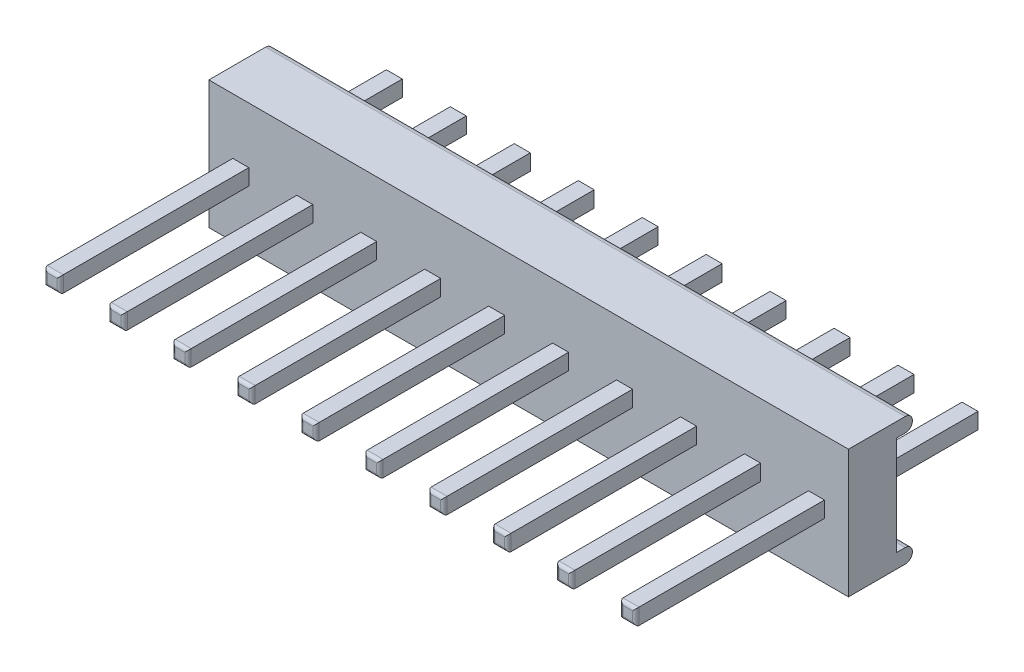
ISO-10303-21;
HEADER;
FILE_DESCRIPTION(('STEP AP214'),'2;1');
FILE_NAME('part.step','',(''),(''),'','','');
FILE_SCHEMA(('AUTOMOTIVE_DESIGN { 1 0 10303 214 1 1 1 1 }'));
ENDSEC;
DATA;
#1=APPLICATION_CONTEXT('core data for automotive mechanical design processes');
#2=APPLICATION_PROTOCOL_DEFINITION('international standard','automotive_design',2000,#1);
#3=PRODUCT_CONTEXT('',#1,'mechanical');
#4=PRODUCT('Part','Part','',(#3));
#5=PRODUCT_RELATED_PRODUCT_CATEGORY('part','',(#4));
#6=PRODUCT_DEFINITION_FORMATION('','',#4);
#7=PRODUCT_DEFINITION_CONTEXT('part definition',#1,'design');
#8=PRODUCT_DEFINITION('design','',#6,#7);
#9=PRODUCT_DEFINITION_SHAPE('','',#8);
#10=(LENGTH_UNIT() NAMED_UNIT(*) SI_UNIT(.MILLI.,.METRE.));
#11=(NAMED_UNIT(*) PLANE_ANGLE_UNIT() SI_UNIT($,.RADIAN.));
#12=(NAMED_UNIT(*) SI_UNIT($,.STERADIAN.) SOLID_ANGLE_UNIT());
#13=UNCERTAINTY_MEASURE_WITH_UNIT(LENGTH_MEASURE(1.E-05),#10,'distance_accuracy_value','');
#14=(GEOMETRIC_REPRESENTATION_CONTEXT(3) GLOBAL_UNCERTAINTY_ASSIGNED_CONTEXT((#13)) GLOBAL_UNIT_ASSIGNED_CONTEXT((#10,
#11,#12)) REPRESENTATION_CONTEXT('',''));
#15=CARTESIAN_POINT('',(0.,0.,0.));
#16=DIRECTION('',(0.,0.,1.));
#17=DIRECTION('',(1.,0.,0.));
#18=AXIS2_PLACEMENT_3D('',#15,#16,#17);
#19=CARTESIAN_POINT('',(11.7475,-0.3526013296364,-1.82118));
#20=DIRECTION('',(1.,0.,0.));
#21=DIRECTION('',(0.,0.,-1.));
#22=AXIS2_PLACEMENT_3D('',#19,#20,#21);
#23=PLANE('',#22);
#24=DIRECTION('',(0.,-1.,0.));
#25=VECTOR('',#24,1.);
#26=CARTESIAN_POINT('',(11.7475000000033,0.,-6.096));
#27=LINE('',#26,#25);
#28=CARTESIAN_POINT('',(11.7475000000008,0.317499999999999,-6.096));
#29=VERTEX_POINT('',#28);
#30=CARTESIAN_POINT('',(11.7475000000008,-0.317500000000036,-6.096));
#31=VERTEX_POINT('',#30);
#32=EDGE_CURVE('E1225',#29,#31,#27,.T.);
#33=ORIENTED_EDGE('',*,*,#32,.F.);
#34=DIRECTION('',(0.,0.,-1.));
#35=VECTOR('',#34,1.);
#36=CARTESIAN_POINT('',(11.7475,0.3175,0.6985));
#37=LINE('',#36,#35);
#38=CARTESIAN_POINT('',(11.7475,0.317499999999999,-1.905));
#39=VERTEX_POINT('',#38);
#40=EDGE_CURVE('E1230',#39,#29,#37,.T.);
#41=ORIENTED_EDGE('',*,*,#40,.F.);
#42=DIRECTION('',(0.,-1.,0.));
#43=VECTOR('',#42,1.);
#44=CARTESIAN_POINT('',(11.7475,0.,-1.905));
#45=LINE('',#44,#43);
#46=CARTESIAN_POINT('',(11.7475,-0.317500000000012,-1.905));
#47=VERTEX_POINT('',#46);
#48=EDGE_CURVE('E1274',#39,#47,#45,.T.);
#49=ORIENTED_EDGE('',*,*,#48,.T.);
#50=DIRECTION('',(0.,0.,-1.));
#51=VECTOR('',#50,1.);
#52=CARTESIAN_POINT('',(11.7475,-0.3175,0.6985));
#53=LINE('',#52,#51);
#54=EDGE_CURVE('E1219',#47,#31,#53,.T.);
#55=ORIENTED_EDGE('',*,*,#54,.T.);
#56=EDGE_LOOP('',(#33,#41,#49,#55));
#57=FACE_BOUND('',#56,.T.);
#58=ADVANCED_FACE('F33',(#57),#23,.T.);
#59=CARTESIAN_POINT('',(9.2075,-0.3526013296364,-1.82118));
#60=DIRECTION('',(1.,0.,0.));
#61=DIRECTION('',(0.,0.,-1.));
#62=AXIS2_PLACEMENT_3D('',#59,#60,#61);
#63=PLANE('',#62);
#64=DIRECTION('',(0.,-1.,0.));
#65=VECTOR('',#64,1.);
#66=CARTESIAN_POINT('',(9.20749999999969,0.,-6.096));
#67=LINE('',#66,#65);
#68=CARTESIAN_POINT('',(9.20749999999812,0.317499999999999,-6.096));
#69=VERTEX_POINT('',#68);
#70=CARTESIAN_POINT('',(9.20749999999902,-0.317500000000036,-6.096));
#71=VERTEX_POINT('',#70);
#72=EDGE_CURVE('E1207',#69,#71,#67,.T.);
#73=ORIENTED_EDGE('',*,*,#72,.F.);
#74=DIRECTION('',(0.,0.,-1.));
#75=VECTOR('',#74,1.);
#76=CARTESIAN_POINT('',(9.2074999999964,0.3175,0.6985));
#77=LINE('',#76,#75);
#78=CARTESIAN_POINT('',(9.2074999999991,0.317499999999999,-1.905));
#79=VERTEX_POINT('',#78);
#80=EDGE_CURVE('E1212',#79,#69,#77,.T.);
#81=ORIENTED_EDGE('',*,*,#80,.F.);
#82=DIRECTION('',(0.,-1.,0.));
#83=VECTOR('',#82,1.);
#84=CARTESIAN_POINT('',(9.2075,0.,-1.905));
#85=LINE('',#84,#83);
#86=CARTESIAN_POINT('',(9.2074999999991,-0.317500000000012,-1.905));
#87=VERTEX_POINT('',#86);
#88=EDGE_CURVE('E1272',#79,#87,#85,.T.);
#89=ORIENTED_EDGE('',*,*,#88,.T.);
#90=DIRECTION('',(0.,0.,-1.));
#91=VECTOR('',#90,1.);
#92=CARTESIAN_POINT('',(9.2074999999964,-0.3175,0.6985));
#93=LINE('',#92,#91);
#94=EDGE_CURVE('E1201',#87,#71,#93,.T.);
#95=ORIENTED_EDGE('',*,*,#94,.T.);
#96=EDGE_LOOP('',(#73,#81,#89,#95));
#97=FACE_BOUND('',#96,.T.);
#98=ADVANCED_FACE('F2539',(#97),#63,.T.);
#99=CARTESIAN_POINT('',(6.6675,-0.3526013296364,-1.82118));
#100=DIRECTION('',(1.,0.,0.));
#101=DIRECTION('',(0.,0.,-1.));
#102=AXIS2_PLACEMENT_3D('',#99,#100,#101);
#103=PLANE('',#102);
#104=DIRECTION('',(0.,-1.,0.));
#105=VECTOR('',#104,1.);
#106=CARTESIAN_POINT('',(6.66749999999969,0.,-6.096));
#107=LINE('',#106,#105);
#108=CARTESIAN_POINT('',(6.66749999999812,0.317499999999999,-6.096));
#109=VERTEX_POINT('',#108);
#110=CARTESIAN_POINT('',(6.66749999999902,-0.317500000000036,-6.096));
#111=VERTEX_POINT('',#110);
#112=EDGE_CURVE('E1189',#109,#111,#107,.T.);
#113=ORIENTED_EDGE('',*,*,#112,.F.);
#114=DIRECTION('',(0.,0.,-1.));
#115=VECTOR('',#114,1.);
#116=CARTESIAN_POINT('',(6.6674999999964,0.3175,0.6985));
#117=LINE('',#116,#115);
#118=CARTESIAN_POINT('',(6.6674999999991,0.317499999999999,-1.905));
#119=VERTEX_POINT('',#118);
#120=EDGE_CURVE('E1194',#119,#109,#117,.T.);
#121=ORIENTED_EDGE('',*,*,#120,.F.);
#122=DIRECTION('',(0.,-1.,0.));
#123=VECTOR('',#122,1.);
#124=CARTESIAN_POINT('',(6.6675,0.,-1.905));
#125=LINE('',#124,#123);
#126=CARTESIAN_POINT('',(6.6674999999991,-0.317500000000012,-1.905));
#127=VERTEX_POINT('',#126);
#128=EDGE_CURVE('E1270',#119,#127,#125,.T.);
#129=ORIENTED_EDGE('',*,*,#128,.T.);
#130=DIRECTION('',(0.,0.,-1.));
#131=VECTOR('',#130,1.);
#132=CARTESIAN_POINT('',(6.6674999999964,-0.3175,0.6985));
#133=LINE('',#132,#131);
#134=EDGE_CURVE('E1183',#127,#111,#133,.T.);
#135=ORIENTED_EDGE('',*,*,#134,.T.);
#136=EDGE_LOOP('',(#113,#121,#129,#135));
#137=FACE_BOUND('',#136,.T.);
#138=ADVANCED_FACE('F2530',(#137),#103,.T.);
#139=CARTESIAN_POINT('',(4.1275,-0.3526013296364,-1.82118));
#140=DIRECTION('',(1.,0.,0.));
#141=DIRECTION('',(0.,0.,-1.));
#142=AXIS2_PLACEMENT_3D('',#139,#140,#141);
#143=PLANE('',#142);
#144=DIRECTION('',(0.,-1.,0.));
#145=VECTOR('',#144,1.);
#146=CARTESIAN_POINT('',(4.12749999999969,0.,-6.096));
#147=LINE('',#146,#145);
#148=CARTESIAN_POINT('',(4.12749999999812,0.317499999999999,-6.096));
#149=VERTEX_POINT('',#148);
#150=CARTESIAN_POINT('',(4.12749999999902,-0.317500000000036,-6.096));
#151=VERTEX_POINT('',#150);
#152=EDGE_CURVE('E1171',#149,#151,#147,.T.);
#153=ORIENTED_EDGE('',*,*,#152,.F.);
#154=DIRECTION('',(0.,0.,-1.));
#155=VECTOR('',#154,1.);
#156=CARTESIAN_POINT('',(4.1274999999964,0.3175,0.6985));
#157=LINE('',#156,#155);
#158=CARTESIAN_POINT('',(4.1274999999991,0.317499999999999,-1.905));
#159=VERTEX_POINT('',#158);
#160=EDGE_CURVE('E1176',#159,#149,#157,.T.);
#161=ORIENTED_EDGE('',*,*,#160,.F.);
#162=DIRECTION('',(0.,-1.,0.));
#163=VECTOR('',#162,1.);
#164=CARTESIAN_POINT('',(4.1275,0.,-1.905));
#165=LINE('',#164,#163);
#166=CARTESIAN_POINT('',(4.1274999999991,-0.317500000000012,-1.905));
#167=VERTEX_POINT('',#166);
#168=EDGE_CURVE('E1268',#159,#167,#165,.T.);
#169=ORIENTED_EDGE('',*,*,#168,.T.);
#170=DIRECTION('',(0.,0.,-1.));
#171=VECTOR('',#170,1.);
#172=CARTESIAN_POINT('',(4.1274999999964,-0.3175,0.6985));
#173=LINE('',#172,#171);
#174=EDGE_CURVE('E1165',#167,#151,#173,.T.);
#175=ORIENTED_EDGE('',*,*,#174,.T.);
#176=EDGE_LOOP('',(#153,#161,#169,#175));
#177=FACE_BOUND('',#176,.T.);
#178=ADVANCED_FACE('F2521',(#177),#143,.T.);
#179=CARTESIAN_POINT('',(1.5875,-0.3526013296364,-1.82118));
#180=DIRECTION('',(1.,0.,0.));
#181=DIRECTION('',(0.,0.,-1.));
#182=AXIS2_PLACEMENT_3D('',#179,#180,#181);
#183=PLANE('',#182);
#184=DIRECTION('',(0.,-1.,0.));
#185=VECTOR('',#184,1.);
#186=CARTESIAN_POINT('',(1.58749999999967,0.,-6.096));
#187=LINE('',#186,#185);
#188=CARTESIAN_POINT('',(1.58749999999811,0.317499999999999,-6.096));
#189=VERTEX_POINT('',#188);
#190=CARTESIAN_POINT('',(1.58749999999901,-0.317500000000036,-6.096));
#191=VERTEX_POINT('',#190);
#192=EDGE_CURVE('E1153',#189,#191,#187,.T.);
#193=ORIENTED_EDGE('',*,*,#192,.F.);
#194=DIRECTION('',(0.,0.,-1.));
#195=VECTOR('',#194,1.);
#196=CARTESIAN_POINT('',(1.58749999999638,0.3175,0.6985));
#197=LINE('',#196,#195);
#198=CARTESIAN_POINT('',(1.5874999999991,0.317499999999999,-1.905));
#199=VERTEX_POINT('',#198);
#200=EDGE_CURVE('E1158',#199,#189,#197,.T.);
#201=ORIENTED_EDGE('',*,*,#200,.F.);
#202=DIRECTION('',(0.,-1.,0.));
#203=VECTOR('',#202,1.);
#204=CARTESIAN_POINT('',(1.5875,0.,-1.905));
#205=LINE('',#204,#203);
#206=CARTESIAN_POINT('',(1.5874999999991,-0.317500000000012,-1.905));
#207=VERTEX_POINT('',#206);
#208=EDGE_CURVE('E1266',#199,#207,#205,.T.);
#209=ORIENTED_EDGE('',*,*,#208,.T.);
#210=DIRECTION('',(0.,0.,-1.));
#211=VECTOR('',#210,1.);
#212=CARTESIAN_POINT('',(1.58749999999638,-0.3175,0.6985));
#213=LINE('',#212,#211);
#214=EDGE_CURVE('E1147',#207,#191,#213,.T.);
#215=ORIENTED_EDGE('',*,*,#214,.T.);
#216=EDGE_LOOP('',(#193,#201,#209,#215));
#217=FACE_BOUND('',#216,.T.);
#218=ADVANCED_FACE('F2512',(#217),#183,.T.);
#219=CARTESIAN_POINT('',(-0.9525,-0.3526013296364,-1.82118));
#220=DIRECTION('',(1.,0.,0.));
#221=DIRECTION('',(0.,0.,-1.));
#222=AXIS2_PLACEMENT_3D('',#219,#220,#221);
#223=PLANE('',#222);
#224=DIRECTION('',(0.,-1.,0.));
#225=VECTOR('',#224,1.);
#226=CARTESIAN_POINT('',(-0.952499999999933,0.,-6.096));
#227=LINE('',#226,#225);
#228=CARTESIAN_POINT('',(-0.952500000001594,0.317499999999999,-6.096));
#229=VERTEX_POINT('',#228);
#230=CARTESIAN_POINT('',(-0.952500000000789,-0.317500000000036,-6.096));
#231=VERTEX_POINT('',#230);
#232=EDGE_CURVE('E1135',#229,#231,#227,.T.);
#233=ORIENTED_EDGE('',*,*,#232,.F.);
#234=DIRECTION('',(0.,0.,-1.));
#235=VECTOR('',#234,1.);
#236=CARTESIAN_POINT('',(-0.952500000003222,0.3175,0.6985));
#237=LINE('',#236,#235);
#238=CARTESIAN_POINT('',(-0.952500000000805,0.317499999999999,-1.905));
#239=VERTEX_POINT('',#238);
#240=EDGE_CURVE('E1140',#239,#229,#237,.T.);
#241=ORIENTED_EDGE('',*,*,#240,.F.);
#242=DIRECTION('',(0.,-1.,0.));
#243=VECTOR('',#242,1.);
#244=CARTESIAN_POINT('',(-0.9525,0.,-1.905));
#245=LINE('',#244,#243);
#246=CARTESIAN_POINT('',(-0.952500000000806,-0.317500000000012,-1.905));
#247=VERTEX_POINT('',#246);
#248=EDGE_CURVE('E1264',#239,#247,#245,.T.);
#249=ORIENTED_EDGE('',*,*,#248,.T.);
#250=DIRECTION('',(0.,0.,-1.));
#251=VECTOR('',#250,1.);
#252=CARTESIAN_POINT('',(-0.952500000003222,-0.3175,0.6985));
#253=LINE('',#252,#251);
#254=EDGE_CURVE('E1129',#247,#231,#253,.T.);
#255=ORIENTED_EDGE('',*,*,#254,.T.);
#256=EDGE_LOOP('',(#233,#241,#249,#255));
#257=FACE_BOUND('',#256,.T.);
#258=ADVANCED_FACE('F2503',(#257),#223,.T.);
#259=CARTESIAN_POINT('',(-3.4925,-0.3526013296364,-1.82118));
#260=DIRECTION('',(1.,0.,0.));
#261=DIRECTION('',(0.,0.,-1.));
#262=AXIS2_PLACEMENT_3D('',#259,#260,#261);
#263=PLANE('',#262);
#264=DIRECTION('',(0.,-1.,0.));
#265=VECTOR('',#264,1.);
#266=CARTESIAN_POINT('',(-3.49250000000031,0.,-6.096));
#267=LINE('',#266,#265);
#268=CARTESIAN_POINT('',(-3.49250000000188,0.317499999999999,-6.096));
#269=VERTEX_POINT('',#268);
#270=CARTESIAN_POINT('',(-3.49250000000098,-0.317500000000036,-6.096));
#271=VERTEX_POINT('',#270);
#272=EDGE_CURVE('E1117',#269,#271,#267,.T.);
#273=ORIENTED_EDGE('',*,*,#272,.F.);
#274=DIRECTION('',(0.,0.,-1.));
#275=VECTOR('',#274,1.);
#276=CARTESIAN_POINT('',(-3.4925000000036,0.3175,0.6985));
#277=LINE('',#276,#275);
#278=CARTESIAN_POINT('',(-3.4925000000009,0.317499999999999,-1.905));
#279=VERTEX_POINT('',#278);
#280=EDGE_CURVE('E1122',#279,#269,#277,.T.);
#281=ORIENTED_EDGE('',*,*,#280,.F.);
#282=DIRECTION('',(0.,-1.,0.));
#283=VECTOR('',#282,1.);
#284=CARTESIAN_POINT('',(-3.4925,0.,-1.905));
#285=LINE('',#284,#283);
#286=CARTESIAN_POINT('',(-3.4925000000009,-0.317500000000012,-1.905));
#287=VERTEX_POINT('',#286);
#288=EDGE_CURVE('E1262',#279,#287,#285,.T.);
#289=ORIENTED_EDGE('',*,*,#288,.T.);
#290=DIRECTION('',(0.,0.,-1.));
#291=VECTOR('',#290,1.);
#292=CARTESIAN_POINT('',(-3.4925000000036,-0.3175,0.6985));
#293=LINE('',#292,#291);
#294=EDGE_CURVE('E1111',#287,#271,#293,.T.);
#295=ORIENTED_EDGE('',*,*,#294,.T.);
#296=EDGE_LOOP('',(#273,#281,#289,#295));
#297=FACE_BOUND('',#296,.T.);
#298=ADVANCED_FACE('F2494',(#297),#263,.T.);
#299=CARTESIAN_POINT('',(-6.0325,-0.3526013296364,-1.82118));
#300=DIRECTION('',(1.,0.,0.));
#301=DIRECTION('',(0.,0.,-1.));
#302=AXIS2_PLACEMENT_3D('',#299,#300,#301);
#303=PLANE('',#302);
#304=DIRECTION('',(0.,-1.,0.));
#305=VECTOR('',#304,1.);
#306=CARTESIAN_POINT('',(-6.03250000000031,0.,-6.096));
#307=LINE('',#306,#305);
#308=CARTESIAN_POINT('',(-6.03250000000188,0.317499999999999,-6.096));
#309=VERTEX_POINT('',#308);
#310=CARTESIAN_POINT('',(-6.03250000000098,-0.317500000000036,-6.096));
#311=VERTEX_POINT('',#310);
#312=EDGE_CURVE('E1099',#309,#311,#307,.T.);
#313=ORIENTED_EDGE('',*,*,#312,.F.);
#314=DIRECTION('',(0.,0.,-1.));
#315=VECTOR('',#314,1.);
#316=CARTESIAN_POINT('',(-6.0325000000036,0.3175,0.6985));
#317=LINE('',#316,#315);
#318=CARTESIAN_POINT('',(-6.0325000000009,0.317499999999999,-1.905));
#319=VERTEX_POINT('',#318);
#320=EDGE_CURVE('E1104',#319,#309,#317,.T.);
#321=ORIENTED_EDGE('',*,*,#320,.F.);
#322=DIRECTION('',(0.,-1.,0.));
#323=VECTOR('',#322,1.);
#324=CARTESIAN_POINT('',(-6.0325,0.,-1.905));
#325=LINE('',#324,#323);
#326=CARTESIAN_POINT('',(-6.0325000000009,-0.317500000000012,-1.905));
#327=VERTEX_POINT('',#326);
#328=EDGE_CURVE('E1260',#319,#327,#325,.T.);
#329=ORIENTED_EDGE('',*,*,#328,.T.);
#330=DIRECTION('',(0.,0.,-1.));
#331=VECTOR('',#330,1.);
#332=CARTESIAN_POINT('',(-6.0325000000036,-0.3175,0.6985));
#333=LINE('',#332,#331);
#334=EDGE_CURVE('E1093',#327,#311,#333,.T.);
#335=ORIENTED_EDGE('',*,*,#334,.T.);
#336=EDGE_LOOP('',(#313,#321,#329,#335));
#337=FACE_BOUND('',#336,.T.);
#338=ADVANCED_FACE('F2485',(#337),#303,.T.);
#339=CARTESIAN_POINT('',(-8.5725,-0.3526013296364,-1.82118));
#340=DIRECTION('',(1.,0.,0.));
#341=DIRECTION('',(0.,0.,-1.));
#342=AXIS2_PLACEMENT_3D('',#339,#340,#341);
#343=PLANE('',#342);
#344=DIRECTION('',(0.,-1.,0.));
#345=VECTOR('',#344,1.);
#346=CARTESIAN_POINT('',(-8.57250000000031,0.,-6.096));
#347=LINE('',#346,#345);
#348=CARTESIAN_POINT('',(-8.57250000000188,0.317499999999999,-6.096));
#349=VERTEX_POINT('',#348);
#350=CARTESIAN_POINT('',(-8.57250000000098,-0.317500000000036,-6.096));
#351=VERTEX_POINT('',#350);
#352=EDGE_CURVE('E1081',#349,#351,#347,.T.);
#353=ORIENTED_EDGE('',*,*,#352,.F.);
#354=DIRECTION('',(0.,0.,-1.));
#355=VECTOR('',#354,1.);
#356=CARTESIAN_POINT('',(-8.5725000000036,0.3175,0.6985));
#357=LINE('',#356,#355);
#358=CARTESIAN_POINT('',(-8.5725000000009,0.317499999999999,-1.905));
#359=VERTEX_POINT('',#358);
#360=EDGE_CURVE('E1086',#359,#349,#357,.T.);
#361=ORIENTED_EDGE('',*,*,#360,.F.);
#362=DIRECTION('',(0.,-1.,0.));
#363=VECTOR('',#362,1.);
#364=CARTESIAN_POINT('',(-8.5725,0.,-1.905));
#365=LINE('',#364,#363);
#366=CARTESIAN_POINT('',(-8.5725000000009,-0.317500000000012,-1.905));
#367=VERTEX_POINT('',#366);
#368=EDGE_CURVE('E1258',#359,#367,#365,.T.);
#369=ORIENTED_EDGE('',*,*,#368,.T.);
#370=DIRECTION('',(0.,0.,-1.));
#371=VECTOR('',#370,1.);
#372=CARTESIAN_POINT('',(-8.5725000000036,-0.3175,0.6985));
#373=LINE('',#372,#371);
#374=EDGE_CURVE('E1075',#367,#351,#373,.T.);
#375=ORIENTED_EDGE('',*,*,#374,.T.);
#376=EDGE_LOOP('',(#353,#361,#369,#375));
#377=FACE_BOUND('',#376,.T.);
#378=ADVANCED_FACE('F2476',(#377),#343,.T.);
#379=CARTESIAN_POINT('',(-11.1125,-0.3526013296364,-1.82118));
#380=DIRECTION('',(1.,0.,0.));
#381=DIRECTION('',(0.,0.,-1.));
#382=AXIS2_PLACEMENT_3D('',#379,#380,#381);
#383=PLANE('',#382);
#384=DIRECTION('',(0.,-1.,0.));
#385=VECTOR('',#384,1.);
#386=CARTESIAN_POINT('',(-11.1124999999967,0.,-6.096));
#387=LINE('',#386,#385);
#388=CARTESIAN_POINT('',(-11.1124999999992,0.317499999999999,-6.096));
#389=VERTEX_POINT('',#388);
#390=CARTESIAN_POINT('',(-11.1124999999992,-0.317500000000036,-6.096));
#391=VERTEX_POINT('',#390);
#392=EDGE_CURVE('E1063',#389,#391,#387,.T.);
#393=ORIENTED_EDGE('',*,*,#392,.F.);
#394=DIRECTION('',(0.,0.,-1.));
#395=VECTOR('',#394,1.);
#396=CARTESIAN_POINT('',(-11.1125,0.3175,0.6985));
#397=LINE('',#396,#395);
#398=CARTESIAN_POINT('',(-11.1125,0.317499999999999,-1.905));
#399=VERTEX_POINT('',#398);
#400=EDGE_CURVE('E1068',#399,#389,#397,.T.);
#401=ORIENTED_EDGE('',*,*,#400,.F.);
#402=DIRECTION('',(0.,-1.,0.));
#403=VECTOR('',#402,1.);
#404=CARTESIAN_POINT('',(-11.1125,0.,-1.905));
#405=LINE('',#404,#403);
#406=CARTESIAN_POINT('',(-11.1125,-0.317500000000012,-1.905));
#407=VERTEX_POINT('',#406);
#408=EDGE_CURVE('E1256',#399,#407,#405,.T.);
#409=ORIENTED_EDGE('',*,*,#408,.T.);
#410=DIRECTION('',(0.,0.,-1.));
#411=VECTOR('',#410,1.);
#412=CARTESIAN_POINT('',(-11.1125,-0.3175,0.6985));
#413=LINE('',#412,#411);
#414=EDGE_CURVE('E1057',#407,#391,#413,.T.);
#415=ORIENTED_EDGE('',*,*,#414,.T.);
#416=EDGE_LOOP('',(#393,#401,#409,#415));
#417=FACE_BOUND('',#416,.T.);
#418=ADVANCED_FACE('F2391',(#417),#383,.T.);
#419=CARTESIAN_POINT('',(11.1125,-0.3526013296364,-0.14986));
#420=DIRECTION('',(-1.,0.,0.));
#421=DIRECTION('',(0.,0.,1.));
#422=AXIS2_PLACEMENT_3D('',#419,#420,#421);
#423=PLANE('',#422);
#424=DIRECTION('',(0.,0.,1.));
#425=VECTOR('',#424,1.);
#426=CARTESIAN_POINT('',(11.1125,-0.3175,0.6985));
#427=LINE('',#426,#425);
#428=CARTESIAN_POINT('',(11.1125,-0.317500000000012,0.));
#429=VERTEX_POINT('',#428);
#430=CARTESIAN_POINT('',(11.1125,-0.3175,7.366));
#431=VERTEX_POINT('',#430);
#432=EDGE_CURVE('E1029',#429,#431,#427,.T.);
#433=ORIENTED_EDGE('',*,*,#432,.T.);
#434=DIRECTION('',(0.,-1.,0.));
#435=VECTOR('',#434,1.);
#436=CARTESIAN_POINT('',(11.1125,-0.3526013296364,7.366));
#437=LINE('',#436,#435);
#438=CARTESIAN_POINT('',(11.1125,0.3175,7.366));
#439=VERTEX_POINT('',#438);
#440=EDGE_CURVE('E1295',#431,#439,#437,.F.);
#441=ORIENTED_EDGE('',*,*,#440,.T.);
#442=DIRECTION('',(0.,0.,1.));
#443=VECTOR('',#442,1.);
#444=CARTESIAN_POINT('',(11.1125,0.3175,0.6985));
#445=LINE('',#444,#443);
#446=CARTESIAN_POINT('',(11.1125,0.3175,0.));
#447=VERTEX_POINT('',#446);
#448=EDGE_CURVE('E1035',#447,#439,#445,.T.);
#449=ORIENTED_EDGE('',*,*,#448,.F.);
#450=DIRECTION('',(0.,-1.,0.));
#451=VECTOR('',#450,1.);
#452=CARTESIAN_POINT('',(11.1125,0.,0.));
#453=LINE('',#452,#451);
#454=EDGE_CURVE('E1254',#447,#429,#453,.T.);
#455=ORIENTED_EDGE('',*,*,#454,.T.);
#456=EDGE_LOOP('',(#433,#441,#449,#455));
#457=FACE_BOUND('',#456,.T.);
#458=ADVANCED_FACE('F2381',(#457),#423,.T.);
#459=CARTESIAN_POINT('',(8.5725,-0.3526013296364,-0.14986));
#460=DIRECTION('',(-1.,0.,0.));
#461=DIRECTION('',(0.,0.,1.));
#462=AXIS2_PLACEMENT_3D('',#459,#460,#461);
#463=PLANE('',#462);
#464=DIRECTION('',(0.,0.,1.));
#465=VECTOR('',#464,1.);
#466=CARTESIAN_POINT('',(8.5725000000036,-0.3175,0.6985));
#467=LINE('',#466,#465);
#468=CARTESIAN_POINT('',(8.5725000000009,-0.317500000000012,0.));
#469=VERTEX_POINT('',#468);
#470=CARTESIAN_POINT('',(8.5725000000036,-0.3175,7.366));
#471=VERTEX_POINT('',#470);
#472=EDGE_CURVE('E1018',#469,#471,#467,.T.);
#473=ORIENTED_EDGE('',*,*,#472,.T.);
#474=DIRECTION('',(0.,-1.,0.));
#475=VECTOR('',#474,1.);
#476=CARTESIAN_POINT('',(8.5725,-0.3526013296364,7.366));
#477=LINE('',#476,#475);
#478=CARTESIAN_POINT('',(8.5725000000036,0.3175,7.366));
#479=VERTEX_POINT('',#478);
#480=EDGE_CURVE('E1313',#471,#479,#477,.F.);
#481=ORIENTED_EDGE('',*,*,#480,.T.);
#482=DIRECTION('',(0.,0.,1.));
#483=VECTOR('',#482,1.);
#484=CARTESIAN_POINT('',(8.5725000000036,0.3175,0.6985));
#485=LINE('',#484,#483);
#486=CARTESIAN_POINT('',(8.5725000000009,0.3175,0.));
#487=VERTEX_POINT('',#486);
#488=EDGE_CURVE('E1024',#487,#479,#485,.T.);
#489=ORIENTED_EDGE('',*,*,#488,.F.);
#490=DIRECTION('',(0.,-1.,0.));
#491=VECTOR('',#490,1.);
#492=CARTESIAN_POINT('',(8.5725,0.,0.));
#493=LINE('',#492,#491);
#494=EDGE_CURVE('E1252',#487,#469,#493,.T.);
#495=ORIENTED_EDGE('',*,*,#494,.T.);
#496=EDGE_LOOP('',(#473,#481,#489,#495));
#497=FACE_BOUND('',#496,.T.);
#498=ADVANCED_FACE('F2371',(#497),#463,.T.);
#499=CARTESIAN_POINT('',(6.0325,-0.3526013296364,-0.14986));
#500=DIRECTION('',(-1.,0.,0.));
#501=DIRECTION('',(0.,0.,1.));
#502=AXIS2_PLACEMENT_3D('',#499,#500,#501);
#503=PLANE('',#502);
#504=DIRECTION('',(0.,0.,1.));
#505=VECTOR('',#504,1.);
#506=CARTESIAN_POINT('',(6.03250000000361,-0.3175,0.6985));
#507=LINE('',#506,#505);
#508=CARTESIAN_POINT('',(6.0325000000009,-0.317500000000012,0.));
#509=VERTEX_POINT('',#508);
#510=CARTESIAN_POINT('',(6.03250000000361,-0.3175,7.366));
#511=VERTEX_POINT('',#510);
#512=EDGE_CURVE('E1007',#509,#511,#507,.T.);
#513=ORIENTED_EDGE('',*,*,#512,.T.);
#514=DIRECTION('',(0.,-1.,0.));
#515=VECTOR('',#514,1.);
#516=CARTESIAN_POINT('',(6.0325,-0.3526013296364,7.366));
#517=LINE('',#516,#515);
#518=CARTESIAN_POINT('',(6.03250000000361,0.3175,7.366));
#519=VERTEX_POINT('',#518);
#520=EDGE_CURVE('E1331',#511,#519,#517,.F.);
#521=ORIENTED_EDGE('',*,*,#520,.T.);
#522=DIRECTION('',(0.,0.,1.));
#523=VECTOR('',#522,1.);
#524=CARTESIAN_POINT('',(6.03250000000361,0.3175,0.6985));
#525=LINE('',#524,#523);
#526=CARTESIAN_POINT('',(6.0325000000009,0.3175,0.));
#527=VERTEX_POINT('',#526);
#528=EDGE_CURVE('E1013',#527,#519,#525,.T.);
#529=ORIENTED_EDGE('',*,*,#528,.F.);
#530=DIRECTION('',(0.,-1.,0.));
#531=VECTOR('',#530,1.);
#532=CARTESIAN_POINT('',(6.0325,0.,0.));
#533=LINE('',#532,#531);
#534=EDGE_CURVE('E1250',#527,#509,#533,.T.);
#535=ORIENTED_EDGE('',*,*,#534,.T.);
#536=EDGE_LOOP('',(#513,#521,#529,#535));
#537=FACE_BOUND('',#536,.T.);
#538=ADVANCED_FACE('F2361',(#537),#503,.T.);
#539=CARTESIAN_POINT('',(3.4925,-0.3526013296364,-0.14986));
#540=DIRECTION('',(-1.,0.,0.));
#541=DIRECTION('',(0.,0.,1.));
#542=AXIS2_PLACEMENT_3D('',#539,#540,#541);
#543=PLANE('',#542);
#544=DIRECTION('',(0.,0.,1.));
#545=VECTOR('',#544,1.);
#546=CARTESIAN_POINT('',(3.49250000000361,-0.3175,0.6985));
#547=LINE('',#546,#545);
#548=CARTESIAN_POINT('',(3.4925000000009,-0.317500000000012,0.));
#549=VERTEX_POINT('',#548);
#550=CARTESIAN_POINT('',(3.49250000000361,-0.3175,7.366));
#551=VERTEX_POINT('',#550);
#552=EDGE_CURVE('E996',#549,#551,#547,.T.);
#553=ORIENTED_EDGE('',*,*,#552,.T.);
#554=DIRECTION('',(0.,-1.,0.));
#555=VECTOR('',#554,1.);
#556=CARTESIAN_POINT('',(3.4925,-0.3526013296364,7.366));
#557=LINE('',#556,#555);
#558=CARTESIAN_POINT('',(3.49250000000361,0.3175,7.366));
#559=VERTEX_POINT('',#558);
#560=EDGE_CURVE('E1349',#551,#559,#557,.F.);
#561=ORIENTED_EDGE('',*,*,#560,.T.);
#562=DIRECTION('',(0.,0.,1.));
#563=VECTOR('',#562,1.);
#564=CARTESIAN_POINT('',(3.49250000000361,0.3175,0.6985));
#565=LINE('',#564,#563);
#566=CARTESIAN_POINT('',(3.4925000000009,0.3175,0.));
#567=VERTEX_POINT('',#566);
#568=EDGE_CURVE('E1002',#567,#559,#565,.T.);
#569=ORIENTED_EDGE('',*,*,#568,.F.);
#570=DIRECTION('',(0.,-1.,0.));
#571=VECTOR('',#570,1.);
#572=CARTESIAN_POINT('',(3.4925,0.,0.));
#573=LINE('',#572,#571);
#574=EDGE_CURVE('E1248',#567,#549,#573,.T.);
#575=ORIENTED_EDGE('',*,*,#574,.T.);
#576=EDGE_LOOP('',(#553,#561,#569,#575));
#577=FACE_BOUND('',#576,.T.);
#578=ADVANCED_FACE('F2351',(#577),#543,.T.);
#579=CARTESIAN_POINT('',(0.9525,-0.3526013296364,-0.14986));
#580=DIRECTION('',(-1.,0.,0.));
#581=DIRECTION('',(0.,0.,1.));
#582=AXIS2_PLACEMENT_3D('',#579,#580,#581);
#583=PLANE('',#582);
#584=DIRECTION('',(0.,0.,1.));
#585=VECTOR('',#584,1.);
#586=CARTESIAN_POINT('',(0.952500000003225,-0.3175,0.6985));
#587=LINE('',#586,#585);
#588=CARTESIAN_POINT('',(0.952500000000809,-0.317500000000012,0.));
#589=VERTEX_POINT('',#588);
#590=CARTESIAN_POINT('',(0.952500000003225,-0.3175,7.366));
#591=VERTEX_POINT('',#590);
#592=EDGE_CURVE('E985',#589,#591,#587,.T.);
#593=ORIENTED_EDGE('',*,*,#592,.T.);
#594=DIRECTION('',(0.,-1.,0.));
#595=VECTOR('',#594,1.);
#596=CARTESIAN_POINT('',(0.9525,-0.3526013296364,7.366));
#597=LINE('',#596,#595);
#598=CARTESIAN_POINT('',(0.952500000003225,0.3175,7.366));
#599=VERTEX_POINT('',#598);
#600=EDGE_CURVE('E1367',#591,#599,#597,.F.);
#601=ORIENTED_EDGE('',*,*,#600,.T.);
#602=DIRECTION('',(0.,0.,1.));
#603=VECTOR('',#602,1.);
#604=CARTESIAN_POINT('',(0.952500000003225,0.3175,0.6985));
#605=LINE('',#604,#603);
#606=CARTESIAN_POINT('',(0.952500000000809,0.3175,0.));
#607=VERTEX_POINT('',#606);
#608=EDGE_CURVE('E991',#607,#599,#605,.T.);
#609=ORIENTED_EDGE('',*,*,#608,.F.);
#610=DIRECTION('',(0.,-1.,0.));
#611=VECTOR('',#610,1.);
#612=CARTESIAN_POINT('',(0.9525,0.,0.));
#613=LINE('',#612,#611);
#614=EDGE_CURVE('E1246',#607,#589,#613,.T.);
#615=ORIENTED_EDGE('',*,*,#614,.T.);
#616=EDGE_LOOP('',(#593,#601,#609,#615));
#617=FACE_BOUND('',#616,.T.);
#618=ADVANCED_FACE('F2341',(#617),#583,.T.);
#619=CARTESIAN_POINT('',(-1.5875,-0.3526013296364,-0.14986));
#620=DIRECTION('',(-1.,0.,0.));
#621=DIRECTION('',(0.,0.,1.));
#622=AXIS2_PLACEMENT_3D('',#619,#620,#621);
#623=PLANE('',#622);
#624=DIRECTION('',(0.,0.,1.));
#625=VECTOR('',#624,1.);
#626=CARTESIAN_POINT('',(-1.58749999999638,-0.3175,0.6985));
#627=LINE('',#626,#625);
#628=CARTESIAN_POINT('',(-1.58749999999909,-0.317500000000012,0.));
#629=VERTEX_POINT('',#628);
#630=CARTESIAN_POINT('',(-1.58749999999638,-0.3175,7.366));
#631=VERTEX_POINT('',#630);
#632=EDGE_CURVE('E974',#629,#631,#627,.T.);
#633=ORIENTED_EDGE('',*,*,#632,.T.);
#634=DIRECTION('',(0.,-1.,0.));
#635=VECTOR('',#634,1.);
#636=CARTESIAN_POINT('',(-1.5875,-0.3526013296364,7.366));
#637=LINE('',#636,#635);
#638=CARTESIAN_POINT('',(-1.58749999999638,0.3175,7.366));
#639=VERTEX_POINT('',#638);
#640=EDGE_CURVE('E1385',#631,#639,#637,.F.);
#641=ORIENTED_EDGE('',*,*,#640,.T.);
#642=DIRECTION('',(0.,0.,1.));
#643=VECTOR('',#642,1.);
#644=CARTESIAN_POINT('',(-1.58749999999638,0.3175,0.6985));
#645=LINE('',#644,#643);
#646=CARTESIAN_POINT('',(-1.58749999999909,0.3175,0.));
#647=VERTEX_POINT('',#646);
#648=EDGE_CURVE('E980',#647,#639,#645,.T.);
#649=ORIENTED_EDGE('',*,*,#648,.F.);
#650=DIRECTION('',(0.,-1.,0.));
#651=VECTOR('',#650,1.);
#652=CARTESIAN_POINT('',(-1.5875,0.,0.));
#653=LINE('',#652,#651);
#654=EDGE_CURVE('E1244',#647,#629,#653,.T.);
#655=ORIENTED_EDGE('',*,*,#654,.T.);
#656=EDGE_LOOP('',(#633,#641,#649,#655));
#657=FACE_BOUND('',#656,.T.);
#658=ADVANCED_FACE('F2331',(#657),#623,.T.);
#659=CARTESIAN_POINT('',(-4.1275,-0.3526013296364,-0.14986));
#660=DIRECTION('',(-1.,0.,0.));
#661=DIRECTION('',(0.,0.,1.));
#662=AXIS2_PLACEMENT_3D('',#659,#660,#661);
#663=PLANE('',#662);
#664=DIRECTION('',(0.,0.,1.));
#665=VECTOR('',#664,1.);
#666=CARTESIAN_POINT('',(-4.12749999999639,-0.3175,0.6985));
#667=LINE('',#666,#665);
#668=CARTESIAN_POINT('',(-4.1274999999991,-0.317500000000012,0.));
#669=VERTEX_POINT('',#668);
#670=CARTESIAN_POINT('',(-4.12749999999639,-0.3175,7.366));
#671=VERTEX_POINT('',#670);
#672=EDGE_CURVE('E963',#669,#671,#667,.T.);
#673=ORIENTED_EDGE('',*,*,#672,.T.);
#674=DIRECTION('',(0.,-1.,0.));
#675=VECTOR('',#674,1.);
#676=CARTESIAN_POINT('',(-4.1275,-0.3526013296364,7.366));
#677=LINE('',#676,#675);
#678=CARTESIAN_POINT('',(-4.12749999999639,0.3175,7.366));
#679=VERTEX_POINT('',#678);
#680=EDGE_CURVE('E1403',#671,#679,#677,.F.);
#681=ORIENTED_EDGE('',*,*,#680,.T.);
#682=DIRECTION('',(0.,0.,1.));
#683=VECTOR('',#682,1.);
#684=CARTESIAN_POINT('',(-4.12749999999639,0.3175,0.6985));
#685=LINE('',#684,#683);
#686=CARTESIAN_POINT('',(-4.1274999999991,0.3175,0.));
#687=VERTEX_POINT('',#686);
#688=EDGE_CURVE('E969',#687,#679,#685,.T.);
#689=ORIENTED_EDGE('',*,*,#688,.F.);
#690=DIRECTION('',(0.,-1.,0.));
#691=VECTOR('',#690,1.);
#692=CARTESIAN_POINT('',(-4.1275,0.,0.));
#693=LINE('',#692,#691);
#694=EDGE_CURVE('E1242',#687,#669,#693,.T.);
#695=ORIENTED_EDGE('',*,*,#694,.T.);
#696=EDGE_LOOP('',(#673,#681,#689,#695));
#697=FACE_BOUND('',#696,.T.);
#698=ADVANCED_FACE('F2321',(#697),#663,.T.);
#699=CARTESIAN_POINT('',(-6.6675,-0.3526013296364,-0.14986));
#700=DIRECTION('',(-1.,0.,0.));
#701=DIRECTION('',(0.,0.,1.));
#702=AXIS2_PLACEMENT_3D('',#699,#700,#701);
#703=PLANE('',#702);
#704=DIRECTION('',(0.,0.,1.));
#705=VECTOR('',#704,1.);
#706=CARTESIAN_POINT('',(-6.66749999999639,-0.3175,0.6985));
#707=LINE('',#706,#705);
#708=CARTESIAN_POINT('',(-6.6674999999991,-0.317500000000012,0.));
#709=VERTEX_POINT('',#708);
#710=CARTESIAN_POINT('',(-6.66749999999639,-0.3175,7.366));
#711=VERTEX_POINT('',#710);
#712=EDGE_CURVE('E952',#709,#711,#707,.T.);
#713=ORIENTED_EDGE('',*,*,#712,.T.);
#714=DIRECTION('',(0.,-1.,0.));
#715=VECTOR('',#714,1.);
#716=CARTESIAN_POINT('',(-6.6675,-0.3526013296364,7.366));
#717=LINE('',#716,#715);
#718=CARTESIAN_POINT('',(-6.66749999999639,0.3175,7.366));
#719=VERTEX_POINT('',#718);
#720=EDGE_CURVE('E1421',#711,#719,#717,.F.);
#721=ORIENTED_EDGE('',*,*,#720,.T.);
#722=DIRECTION('',(0.,0.,1.));
#723=VECTOR('',#722,1.);
#724=CARTESIAN_POINT('',(-6.66749999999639,0.3175,0.6985));
#725=LINE('',#724,#723);
#726=CARTESIAN_POINT('',(-6.6674999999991,0.3175,0.));
#727=VERTEX_POINT('',#726);
#728=EDGE_CURVE('E958',#727,#719,#725,.T.);
#729=ORIENTED_EDGE('',*,*,#728,.F.);
#730=DIRECTION('',(0.,-1.,0.));
#731=VECTOR('',#730,1.);
#732=CARTESIAN_POINT('',(-6.6675,0.,0.));
#733=LINE('',#732,#731);
#734=EDGE_CURVE('E1240',#727,#709,#733,.T.);
#735=ORIENTED_EDGE('',*,*,#734,.T.);
#736=EDGE_LOOP('',(#713,#721,#729,#735));
#737=FACE_BOUND('',#736,.T.);
#738=ADVANCED_FACE('F1581',(#737),#703,.T.);
#739=CARTESIAN_POINT('',(-9.2075,-0.3526013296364,-0.14986));
#740=DIRECTION('',(-1.,0.,0.));
#741=DIRECTION('',(0.,0.,1.));
#742=AXIS2_PLACEMENT_3D('',#739,#740,#741);
#743=PLANE('',#742);
#744=DIRECTION('',(0.,0.,1.));
#745=VECTOR('',#744,1.);
#746=CARTESIAN_POINT('',(-9.20749999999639,-0.3175,0.6985));
#747=LINE('',#746,#745);
#748=CARTESIAN_POINT('',(-9.2074999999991,-0.317500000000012,0.));
#749=VERTEX_POINT('',#748);
#750=CARTESIAN_POINT('',(-9.20749999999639,-0.3175,7.366));
#751=VERTEX_POINT('',#750);
#752=EDGE_CURVE('E711',#749,#751,#747,.T.);
#753=ORIENTED_EDGE('',*,*,#752,.T.);
#754=DIRECTION('',(0.,-1.,0.));
#755=VECTOR('',#754,1.);
#756=CARTESIAN_POINT('',(-9.2075,-0.3526013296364,7.366));
#757=LINE('',#756,#755);
#758=CARTESIAN_POINT('',(-9.20749999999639,0.3175,7.366));
#759=VERTEX_POINT('',#758);
#760=EDGE_CURVE('E1439',#751,#759,#757,.F.);
#761=ORIENTED_EDGE('',*,*,#760,.T.);
#762=DIRECTION('',(0.,0.,1.));
#763=VECTOR('',#762,1.);
#764=CARTESIAN_POINT('',(-9.20749999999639,0.3175,0.6985));
#765=LINE('',#764,#763);
#766=CARTESIAN_POINT('',(-9.2074999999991,0.3175,0.));
#767=VERTEX_POINT('',#766);
#768=EDGE_CURVE('E947',#767,#759,#765,.T.);
#769=ORIENTED_EDGE('',*,*,#768,.F.);
#770=DIRECTION('',(0.,-1.,0.));
#771=VECTOR('',#770,1.);
#772=CARTESIAN_POINT('',(-9.2075,0.,0.));
#773=LINE('',#772,#771);
#774=EDGE_CURVE('E1238',#767,#749,#773,.T.);
#775=ORIENTED_EDGE('',*,*,#774,.T.);
#776=EDGE_LOOP('',(#753,#761,#769,#775));
#777=FACE_BOUND('',#776,.T.);
#778=ADVANCED_FACE('F1572',(#777),#743,.T.);
#779=CARTESIAN_POINT('',(-11.7475,-0.3526013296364,-0.14986));
#780=DIRECTION('',(-1.,0.,0.));
#781=DIRECTION('',(0.,0.,1.));
#782=AXIS2_PLACEMENT_3D('',#779,#780,#781);
#783=PLANE('',#782);
#784=DIRECTION('',(0.,0.,1.));
#785=VECTOR('',#784,1.);
#786=CARTESIAN_POINT('',(-11.7475,-0.3175,0.6985));
#787=LINE('',#786,#785);
#788=CARTESIAN_POINT('',(-11.7475,-0.317500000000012,0.));
#789=VERTEX_POINT('',#788);
#790=CARTESIAN_POINT('',(-11.7475,-0.3175,7.366));
#791=VERTEX_POINT('',#790);
#792=EDGE_CURVE('E936',#789,#791,#787,.T.);
#793=ORIENTED_EDGE('',*,*,#792,.T.);
#794=DIRECTION('',(0.,-1.,0.));
#795=VECTOR('',#794,1.);
#796=CARTESIAN_POINT('',(-11.7475,-0.3526013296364,7.366));
#797=LINE('',#796,#795);
#798=CARTESIAN_POINT('',(-11.7475,0.3175,7.366));
#799=VERTEX_POINT('',#798);
#800=EDGE_CURVE('E42',#791,#799,#797,.F.);
#801=ORIENTED_EDGE('',*,*,#800,.T.);
#802=DIRECTION('',(0.,0.,1.));
#803=VECTOR('',#802,1.);
#804=CARTESIAN_POINT('',(-11.7475,0.3175,0.6985));
#805=LINE('',#804,#803);
#806=CARTESIAN_POINT('',(-11.7475,0.3175,0.));
#807=VERTEX_POINT('',#806);
#808=EDGE_CURVE('E710',#807,#799,#805,.T.);
#809=ORIENTED_EDGE('',*,*,#808,.F.);
#810=DIRECTION('',(0.,-1.,0.));
#811=VECTOR('',#810,1.);
#812=CARTESIAN_POINT('',(-11.7475,0.,0.));
#813=LINE('',#812,#811);
#814=EDGE_CURVE('E708',#807,#789,#813,.T.);
#815=ORIENTED_EDGE('',*,*,#814,.T.);
#816=EDGE_LOOP('',(#793,#801,#809,#815));
#817=FACE_BOUND('',#816,.T.);
#818=ADVANCED_FACE('F1569',(#817),#783,.T.);
#819=CARTESIAN_POINT('',(11.78260132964,0.3175,-6.36778));
#820=DIRECTION('',(0.,1.,0.));
#821=DIRECTION('',(-1.,0.,0.));
#822=AXIS2_PLACEMENT_3D('',#819,#820,#821);
#823=PLANE('',#822);
#824=DIRECTION('',(1.,0.,0.));
#825=VECTOR('',#824,1.);
#826=CARTESIAN_POINT('',(11.43,0.317499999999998,-6.096));
#827=LINE('',#826,#825);
#828=CARTESIAN_POINT('',(11.1124999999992,0.317499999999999,-6.096));
#829=VERTEX_POINT('',#828);
#830=EDGE_CURVE('E1227',#829,#29,#827,.T.);
#831=ORIENTED_EDGE('',*,*,#830,.F.);
#832=DIRECTION('',(0.,0.,-1.));
#833=VECTOR('',#832,1.);
#834=CARTESIAN_POINT('',(11.1125,0.317499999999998,-4.0005));
#835=LINE('',#834,#833);
#836=CARTESIAN_POINT('',(11.1125,0.317499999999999,-1.905));
#837=VERTEX_POINT('',#836);
#838=EDGE_CURVE('E933',#837,#829,#835,.T.);
#839=ORIENTED_EDGE('',*,*,#838,.F.);
#840=DIRECTION('',(1.,0.,0.));
#841=VECTOR('',#840,1.);
#842=CARTESIAN_POINT('',(11.43,0.3175,-1.905));
#843=LINE('',#842,#841);
#844=EDGE_CURVE('E1232',#837,#39,#843,.T.);
#845=ORIENTED_EDGE('',*,*,#844,.T.);
#846=ORIENTED_EDGE('',*,*,#40,.T.);
#847=EDGE_LOOP('',(#831,#839,#845,#846));
#848=FACE_BOUND('',#847,.T.);
#849=ADVANCED_FACE('F1571',(#848),#823,.T.);
#850=CARTESIAN_POINT('',(11.78260132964,-0.3526013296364,-6.096));
#851=DIRECTION('',(0.,0.,-1.));
#852=DIRECTION('',(-1.,0.,0.));
#853=AXIS2_PLACEMENT_3D('',#850,#851,#852);
#854=PLANE('',#853);
#855=ORIENTED_EDGE('',*,*,#830,.T.);
#856=ORIENTED_EDGE('',*,*,#32,.T.);
#857=DIRECTION('',(-1.,0.,0.));
#858=VECTOR('',#857,1.);
#859=CARTESIAN_POINT('',(11.43,-0.3175,-6.096));
#860=LINE('',#859,#858);
#861=CARTESIAN_POINT('',(11.1124999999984,-0.317500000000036,-6.096));
#862=VERTEX_POINT('',#861);
#863=EDGE_CURVE('E1216',#31,#862,#860,.T.);
#864=ORIENTED_EDGE('',*,*,#863,.T.);
#865=DIRECTION('',(0.,-1.,0.));
#866=VECTOR('',#865,1.);
#867=CARTESIAN_POINT('',(11.1125,0.,-6.096));
#868=LINE('',#867,#866);
#869=EDGE_CURVE('E931',#829,#862,#868,.T.);
#870=ORIENTED_EDGE('',*,*,#869,.F.);
#871=EDGE_LOOP('',(#855,#856,#864,#870));
#872=FACE_BOUND('',#871,.T.);
#873=ADVANCED_FACE('F1578',(#872),#854,.T.);
#874=CARTESIAN_POINT('',(11.78260132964,-0.3175,-6.36778));
#875=DIRECTION('',(0.,1.,0.));
#876=DIRECTION('',(-1.,0.,0.));
#877=AXIS2_PLACEMENT_3D('',#874,#875,#876);
#878=PLANE('',#877);
#879=ORIENTED_EDGE('',*,*,#863,.F.);
#880=ORIENTED_EDGE('',*,*,#54,.F.);
#881=DIRECTION('',(1.,0.,0.));
#882=VECTOR('',#881,1.);
#883=CARTESIAN_POINT('',(11.43,-0.3175,-1.905));
#884=LINE('',#883,#882);
#885=CARTESIAN_POINT('',(11.1125,-0.317500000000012,-1.905));
#886=VERTEX_POINT('',#885);
#887=EDGE_CURVE('E1222',#886,#47,#884,.T.);
#888=ORIENTED_EDGE('',*,*,#887,.F.);
#889=DIRECTION('',(0.,0.,1.));
#890=VECTOR('',#889,1.);
#891=CARTESIAN_POINT('',(11.1125,-0.317500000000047,-4.0005));
#892=LINE('',#891,#890);
#893=EDGE_CURVE('E928',#862,#886,#892,.T.);
#894=ORIENTED_EDGE('',*,*,#893,.F.);
#895=EDGE_LOOP('',(#879,#880,#888,#894));
#896=FACE_BOUND('',#895,.T.);
#897=ADVANCED_FACE('F2449',(#896),#878,.F.);
#898=CARTESIAN_POINT('',(9.242601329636,0.3175,-6.36778));
#899=DIRECTION('',(0.,1.,0.));
#900=DIRECTION('',(-1.,0.,0.));
#901=AXIS2_PLACEMENT_3D('',#898,#899,#900);
#902=PLANE('',#901);
#903=DIRECTION('',(1.,0.,0.));
#904=VECTOR('',#903,1.);
#905=CARTESIAN_POINT('',(8.89,0.317499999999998,-6.096));
#906=LINE('',#905,#904);
#907=CARTESIAN_POINT('',(8.57250000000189,0.317499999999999,-6.096));
#908=VERTEX_POINT('',#907);
#909=EDGE_CURVE('E1209',#908,#69,#906,.T.);
#910=ORIENTED_EDGE('',*,*,#909,.F.);
#911=DIRECTION('',(0.,0.,-1.));
#912=VECTOR('',#911,1.);
#913=CARTESIAN_POINT('',(8.5725,0.317499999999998,-4.0005));
#914=LINE('',#913,#912);
#915=CARTESIAN_POINT('',(8.5725000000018,0.317499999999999,-1.905));
#916=VERTEX_POINT('',#915);
#917=EDGE_CURVE('E926',#916,#908,#914,.T.);
#918=ORIENTED_EDGE('',*,*,#917,.F.);
#919=DIRECTION('',(1.,0.,0.));
#920=VECTOR('',#919,1.);
#921=CARTESIAN_POINT('',(8.89,0.3175,-1.905));
#922=LINE('',#921,#920);
#923=EDGE_CURVE('E1214',#916,#79,#922,.T.);
#924=ORIENTED_EDGE('',*,*,#923,.T.);
#925=ORIENTED_EDGE('',*,*,#80,.T.);
#926=EDGE_LOOP('',(#910,#918,#924,#925));
#927=FACE_BOUND('',#926,.T.);
#928=ADVANCED_FACE('F2440',(#927),#902,.T.);
#929=CARTESIAN_POINT('',(9.242601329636,-0.3526013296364,-6.096));
#930=DIRECTION('',(0.,0.,-1.));
#931=DIRECTION('',(-1.,0.,0.));
#932=AXIS2_PLACEMENT_3D('',#929,#930,#931);
#933=PLANE('',#932);
#934=ORIENTED_EDGE('',*,*,#909,.T.);
#935=ORIENTED_EDGE('',*,*,#72,.T.);
#936=DIRECTION('',(-1.,0.,0.));
#937=VECTOR('',#936,1.);
#938=CARTESIAN_POINT('',(8.89,-0.3175,-6.096));
#939=LINE('',#938,#937);
#940=CARTESIAN_POINT('',(8.57250000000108,-0.317500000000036,-6.096));
#941=VERTEX_POINT('',#940);
#942=EDGE_CURVE('E1198',#71,#941,#939,.T.);
#943=ORIENTED_EDGE('',*,*,#942,.T.);
#944=DIRECTION('',(0.,-1.,0.));
#945=VECTOR('',#944,1.);
#946=CARTESIAN_POINT('',(8.5725,0.,-6.096));
#947=LINE('',#946,#945);
#948=EDGE_CURVE('E924',#908,#941,#947,.T.);
#949=ORIENTED_EDGE('',*,*,#948,.F.);
#950=EDGE_LOOP('',(#934,#935,#943,#949));
#951=FACE_BOUND('',#950,.T.);
#952=ADVANCED_FACE('F2431',(#951),#933,.T.);
#953=CARTESIAN_POINT('',(9.242601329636,-0.3175,-6.36778));
#954=DIRECTION('',(0.,1.,0.));
#955=DIRECTION('',(-1.,0.,0.));
#956=AXIS2_PLACEMENT_3D('',#953,#954,#955);
#957=PLANE('',#956);
#958=ORIENTED_EDGE('',*,*,#942,.F.);
#959=ORIENTED_EDGE('',*,*,#94,.F.);
#960=DIRECTION('',(1.,0.,0.));
#961=VECTOR('',#960,1.);
#962=CARTESIAN_POINT('',(8.89,-0.3175,-1.905));
#963=LINE('',#962,#961);
#964=CARTESIAN_POINT('',(8.5725000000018,-0.317500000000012,-1.905));
#965=VERTEX_POINT('',#964);
#966=EDGE_CURVE('E1204',#965,#87,#963,.T.);
#967=ORIENTED_EDGE('',*,*,#966,.F.);
#968=DIRECTION('',(0.,0.,1.));
#969=VECTOR('',#968,1.);
#970=CARTESIAN_POINT('',(8.5725,-0.317500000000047,-4.0005));
#971=LINE('',#970,#969);
#972=EDGE_CURVE('E921',#941,#965,#971,.T.);
#973=ORIENTED_EDGE('',*,*,#972,.F.);
#974=EDGE_LOOP('',(#958,#959,#967,#973));
#975=FACE_BOUND('',#974,.T.);
#976=ADVANCED_FACE('F2422',(#975),#957,.F.);
#977=CARTESIAN_POINT('',(6.702601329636,0.3175,-6.36778));
#978=DIRECTION('',(0.,1.,0.));
#979=DIRECTION('',(-1.,0.,0.));
#980=AXIS2_PLACEMENT_3D('',#977,#978,#979);
#981=PLANE('',#980);
#982=DIRECTION('',(1.,0.,0.));
#983=VECTOR('',#982,1.);
#984=CARTESIAN_POINT('',(6.35,0.317499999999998,-6.096));
#985=LINE('',#984,#983);
#986=CARTESIAN_POINT('',(6.03250000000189,0.317499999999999,-6.096));
#987=VERTEX_POINT('',#986);
#988=EDGE_CURVE('E1191',#987,#109,#985,.T.);
#989=ORIENTED_EDGE('',*,*,#988,.F.);
#990=DIRECTION('',(0.,0.,-1.));
#991=VECTOR('',#990,1.);
#992=CARTESIAN_POINT('',(6.0325,0.317499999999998,-4.0005));
#993=LINE('',#992,#991);
#994=CARTESIAN_POINT('',(6.0325000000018,0.317499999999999,-1.905));
#995=VERTEX_POINT('',#994);
#996=EDGE_CURVE('E919',#995,#987,#993,.T.);
#997=ORIENTED_EDGE('',*,*,#996,.F.);
#998=DIRECTION('',(1.,0.,0.));
#999=VECTOR('',#998,1.);
#1000=CARTESIAN_POINT('',(6.35,0.3175,-1.905));
#1001=LINE('',#1000,#999);
#1002=EDGE_CURVE('E1196',#995,#119,#1001,.T.);
#1003=ORIENTED_EDGE('',*,*,#1002,.T.);
#1004=ORIENTED_EDGE('',*,*,#120,.T.);
#1005=EDGE_LOOP('',(#989,#997,#1003,#1004));
#1006=FACE_BOUND('',#1005,.T.);
#1007=ADVANCED_FACE('F2413',(#1006),#981,.T.);
#1008=CARTESIAN_POINT('',(6.702601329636,-0.3526013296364,-6.096));
#1009=DIRECTION('',(0.,0.,-1.));
#1010=DIRECTION('',(-1.,0.,0.));
#1011=AXIS2_PLACEMENT_3D('',#1008,#1009,#1010);
#1012=PLANE('',#1011);
#1013=ORIENTED_EDGE('',*,*,#988,.T.);
#1014=ORIENTED_EDGE('',*,*,#112,.T.);
#1015=DIRECTION('',(-1.,0.,0.));
#1016=VECTOR('',#1015,1.);
#1017=CARTESIAN_POINT('',(6.35,-0.3175,-6.096));
#1018=LINE('',#1017,#1016);
#1019=CARTESIAN_POINT('',(6.03250000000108,-0.317500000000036,-6.096));
#1020=VERTEX_POINT('',#1019);
#1021=EDGE_CURVE('E1180',#111,#1020,#1018,.T.);
#1022=ORIENTED_EDGE('',*,*,#1021,.T.);
#1023=DIRECTION('',(0.,-1.,0.));
#1024=VECTOR('',#1023,1.);
#1025=CARTESIAN_POINT('',(6.0325,0.,-6.096));
#1026=LINE('',#1025,#1024);
#1027=EDGE_CURVE('E917',#987,#1020,#1026,.T.);
#1028=ORIENTED_EDGE('',*,*,#1027,.F.);
#1029=EDGE_LOOP('',(#1013,#1014,#1022,#1028));
#1030=FACE_BOUND('',#1029,.T.);
#1031=ADVANCED_FACE('F2404',(#1030),#1012,.T.);
#1032=CARTESIAN_POINT('',(6.702601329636,-0.3175,-6.36778));
#1033=DIRECTION('',(0.,1.,0.));
#1034=DIRECTION('',(-1.,0.,0.));
#1035=AXIS2_PLACEMENT_3D('',#1032,#1033,#1034);
#1036=PLANE('',#1035);
#1037=ORIENTED_EDGE('',*,*,#1021,.F.);
#1038=ORIENTED_EDGE('',*,*,#134,.F.);
#1039=DIRECTION('',(1.,0.,0.));
#1040=VECTOR('',#1039,1.);
#1041=CARTESIAN_POINT('',(6.35,-0.3175,-1.905));
#1042=LINE('',#1041,#1040);
#1043=CARTESIAN_POINT('',(6.0325000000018,-0.317500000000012,-1.905));
#1044=VERTEX_POINT('',#1043);
#1045=EDGE_CURVE('E1186',#1044,#127,#1042,.T.);
#1046=ORIENTED_EDGE('',*,*,#1045,.F.);
#1047=DIRECTION('',(0.,0.,1.));
#1048=VECTOR('',#1047,1.);
#1049=CARTESIAN_POINT('',(6.0325,-0.317500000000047,-4.0005));
#1050=LINE('',#1049,#1048);
#1051=EDGE_CURVE('E914',#1020,#1044,#1050,.T.);
#1052=ORIENTED_EDGE('',*,*,#1051,.F.);
#1053=EDGE_LOOP('',(#1037,#1038,#1046,#1052));
#1054=FACE_BOUND('',#1053,.T.);
#1055=ADVANCED_FACE('F2399',(#1054),#1036,.F.);
#1056=CARTESIAN_POINT('',(4.162601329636,0.3175,-6.36778));
#1057=DIRECTION('',(0.,1.,0.));
#1058=DIRECTION('',(-1.,0.,0.));
#1059=AXIS2_PLACEMENT_3D('',#1056,#1057,#1058);
#1060=PLANE('',#1059);
#1061=DIRECTION('',(1.,0.,0.));
#1062=VECTOR('',#1061,1.);
#1063=CARTESIAN_POINT('',(3.81,0.317499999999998,-6.096));
#1064=LINE('',#1063,#1062);
#1065=CARTESIAN_POINT('',(3.49250000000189,0.317499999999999,-6.096));
#1066=VERTEX_POINT('',#1065);
#1067=EDGE_CURVE('E1173',#1066,#149,#1064,.T.);
#1068=ORIENTED_EDGE('',*,*,#1067,.F.);
#1069=DIRECTION('',(0.,0.,-1.));
#1070=VECTOR('',#1069,1.);
#1071=CARTESIAN_POINT('',(3.4925,0.317499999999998,-4.0005));
#1072=LINE('',#1071,#1070);
#1073=CARTESIAN_POINT('',(3.4925000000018,0.317499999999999,-1.905));
#1074=VERTEX_POINT('',#1073);
#1075=EDGE_CURVE('E912',#1074,#1066,#1072,.T.);
#1076=ORIENTED_EDGE('',*,*,#1075,.F.);
#1077=DIRECTION('',(1.,0.,0.));
#1078=VECTOR('',#1077,1.);
#1079=CARTESIAN_POINT('',(3.81,0.3175,-1.905));
#1080=LINE('',#1079,#1078);
#1081=EDGE_CURVE('E1178',#1074,#159,#1080,.T.);
#1082=ORIENTED_EDGE('',*,*,#1081,.T.);
#1083=ORIENTED_EDGE('',*,*,#160,.T.);
#1084=EDGE_LOOP('',(#1068,#1076,#1082,#1083));
#1085=FACE_BOUND('',#1084,.T.);
#1086=ADVANCED_FACE('F2403',(#1085),#1060,.T.);
#1087=CARTESIAN_POINT('',(4.162601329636,-0.3526013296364,-6.096));
#1088=DIRECTION('',(0.,0.,-1.));
#1089=DIRECTION('',(-1.,0.,0.));
#1090=AXIS2_PLACEMENT_3D('',#1087,#1088,#1089);
#1091=PLANE('',#1090);
#1092=ORIENTED_EDGE('',*,*,#1067,.T.);
#1093=ORIENTED_EDGE('',*,*,#152,.T.);
#1094=DIRECTION('',(-1.,0.,0.));
#1095=VECTOR('',#1094,1.);
#1096=CARTESIAN_POINT('',(3.81,-0.3175,-6.096));
#1097=LINE('',#1096,#1095);
#1098=CARTESIAN_POINT('',(3.49250000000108,-0.317500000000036,-6.096));
#1099=VERTEX_POINT('',#1098);
#1100=EDGE_CURVE('E1162',#151,#1099,#1097,.T.);
#1101=ORIENTED_EDGE('',*,*,#1100,.T.);
#1102=DIRECTION('',(0.,-1.,0.));
#1103=VECTOR('',#1102,1.);
#1104=CARTESIAN_POINT('',(3.4925,0.,-6.096));
#1105=LINE('',#1104,#1103);
#1106=EDGE_CURVE('E910',#1066,#1099,#1105,.T.);
#1107=ORIENTED_EDGE('',*,*,#1106,.F.);
#1108=EDGE_LOOP('',(#1092,#1093,#1101,#1107));
#1109=FACE_BOUND('',#1108,.T.);
#1110=ADVANCED_FACE('F2741',(#1109),#1091,.T.);
#1111=CARTESIAN_POINT('',(4.162601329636,-0.3175,-6.36778));
#1112=DIRECTION('',(0.,1.,0.));
#1113=DIRECTION('',(-1.,0.,0.));
#1114=AXIS2_PLACEMENT_3D('',#1111,#1112,#1113);
#1115=PLANE('',#1114);
#1116=ORIENTED_EDGE('',*,*,#1100,.F.);
#1117=ORIENTED_EDGE('',*,*,#174,.F.);
#1118=DIRECTION('',(1.,0.,0.));
#1119=VECTOR('',#1118,1.);
#1120=CARTESIAN_POINT('',(3.81,-0.3175,-1.905));
#1121=LINE('',#1120,#1119);
#1122=CARTESIAN_POINT('',(3.4925000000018,-0.317500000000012,-1.905));
#1123=VERTEX_POINT('',#1122);
#1124=EDGE_CURVE('E1168',#1123,#167,#1121,.T.);
#1125=ORIENTED_EDGE('',*,*,#1124,.F.);
#1126=DIRECTION('',(0.,0.,1.));
#1127=VECTOR('',#1126,1.);
#1128=CARTESIAN_POINT('',(3.4925,-0.317500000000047,-4.0005));
#1129=LINE('',#1128,#1127);
#1130=EDGE_CURVE('E907',#1099,#1123,#1129,.T.);
#1131=ORIENTED_EDGE('',*,*,#1130,.F.);
#1132=EDGE_LOOP('',(#1116,#1117,#1125,#1131));
#1133=FACE_BOUND('',#1132,.T.);
#1134=ADVANCED_FACE('F2732',(#1133),#1115,.F.);
#1135=CARTESIAN_POINT('',(1.622601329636,0.3175,-6.36778));
#1136=DIRECTION('',(0.,1.,0.));
#1137=DIRECTION('',(-1.,0.,0.));
#1138=AXIS2_PLACEMENT_3D('',#1135,#1136,#1137);
#1139=PLANE('',#1138);
#1140=DIRECTION('',(1.,0.,0.));
#1141=VECTOR('',#1140,1.);
#1142=CARTESIAN_POINT('',(1.2699999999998,0.317499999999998,-6.096));
#1143=LINE('',#1142,#1141);
#1144=CARTESIAN_POINT('',(0.952500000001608,0.317499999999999,-6.096));
#1145=VERTEX_POINT('',#1144);
#1146=EDGE_CURVE('E1155',#1145,#189,#1143,.T.);
#1147=ORIENTED_EDGE('',*,*,#1146,.F.);
#1148=DIRECTION('',(0.,0.,-1.));
#1149=VECTOR('',#1148,1.);
#1150=CARTESIAN_POINT('',(0.9525,0.317499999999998,-4.0005));
#1151=LINE('',#1150,#1149);
#1152=CARTESIAN_POINT('',(0.952500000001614,0.317499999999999,-1.905));
#1153=VERTEX_POINT('',#1152);
#1154=EDGE_CURVE('E905',#1153,#1145,#1151,.T.);
#1155=ORIENTED_EDGE('',*,*,#1154,.F.);
#1156=DIRECTION('',(1.,0.,0.));
#1157=VECTOR('',#1156,1.);
#1158=CARTESIAN_POINT('',(1.2699999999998,0.3175,-1.905));
#1159=LINE('',#1158,#1157);
#1160=EDGE_CURVE('E1160',#1153,#199,#1159,.T.);
#1161=ORIENTED_EDGE('',*,*,#1160,.T.);
#1162=ORIENTED_EDGE('',*,*,#200,.T.);
#1163=EDGE_LOOP('',(#1147,#1155,#1161,#1162));
#1164=FACE_BOUND('',#1163,.T.);
#1165=ADVANCED_FACE('F2723',(#1164),#1139,.T.);
#1166=CARTESIAN_POINT('',(1.622601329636,-0.3526013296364,-6.096));
#1167=DIRECTION('',(0.,0.,-1.));
#1168=DIRECTION('',(-1.,0.,0.));
#1169=AXIS2_PLACEMENT_3D('',#1166,#1167,#1168);
#1170=PLANE('',#1169);
#1171=ORIENTED_EDGE('',*,*,#1146,.T.);
#1172=ORIENTED_EDGE('',*,*,#192,.T.);
#1173=DIRECTION('',(-1.,0.,0.));
#1174=VECTOR('',#1173,1.);
#1175=CARTESIAN_POINT('',(1.2699999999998,-0.3175,-6.096));
#1176=LINE('',#1175,#1174);
#1177=CARTESIAN_POINT('',(0.952500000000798,-0.317500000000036,-6.096));
#1178=VERTEX_POINT('',#1177);
#1179=EDGE_CURVE('E1144',#191,#1178,#1176,.T.);
#1180=ORIENTED_EDGE('',*,*,#1179,.T.);
#1181=DIRECTION('',(0.,-1.,0.));
#1182=VECTOR('',#1181,1.);
#1183=CARTESIAN_POINT('',(0.9525,0.,-6.096));
#1184=LINE('',#1183,#1182);
#1185=EDGE_CURVE('E903',#1145,#1178,#1184,.T.);
#1186=ORIENTED_EDGE('',*,*,#1185,.F.);
#1187=EDGE_LOOP('',(#1171,#1172,#1180,#1186));
#1188=FACE_BOUND('',#1187,.T.);
#1189=ADVANCED_FACE('F2714',(#1188),#1170,.T.);
#1190=CARTESIAN_POINT('',(1.622601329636,-0.3175,-6.36778));
#1191=DIRECTION('',(0.,1.,0.));
#1192=DIRECTION('',(-1.,0.,0.));
#1193=AXIS2_PLACEMENT_3D('',#1190,#1191,#1192);
#1194=PLANE('',#1193);
#1195=ORIENTED_EDGE('',*,*,#1179,.F.);
#1196=ORIENTED_EDGE('',*,*,#214,.F.);
#1197=DIRECTION('',(1.,0.,0.));
#1198=VECTOR('',#1197,1.);
#1199=CARTESIAN_POINT('',(1.2699999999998,-0.3175,-1.905));
#1200=LINE('',#1199,#1198);
#1201=CARTESIAN_POINT('',(0.952500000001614,-0.317500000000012,-1.905));
#1202=VERTEX_POINT('',#1201);
#1203=EDGE_CURVE('E1150',#1202,#207,#1200,.T.);
#1204=ORIENTED_EDGE('',*,*,#1203,.F.);
#1205=DIRECTION('',(0.,0.,1.));
#1206=VECTOR('',#1205,1.);
#1207=CARTESIAN_POINT('',(0.9525,-0.317500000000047,-4.0005));
#1208=LINE('',#1207,#1206);
#1209=EDGE_CURVE('E900',#1178,#1202,#1208,.T.);
#1210=ORIENTED_EDGE('',*,*,#1209,.F.);
#1211=EDGE_LOOP('',(#1195,#1196,#1204,#1210));
#1212=FACE_BOUND('',#1211,.T.);
#1213=ADVANCED_FACE('F2705',(#1212),#1194,.F.);
#1214=CARTESIAN_POINT('',(-0.9173986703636,0.3175,-6.36778));
#1215=DIRECTION('',(0.,1.,0.));
#1216=DIRECTION('',(-1.,0.,0.));
#1217=AXIS2_PLACEMENT_3D('',#1214,#1215,#1216);
#1218=PLANE('',#1217);
#1219=DIRECTION('',(1.,0.,0.));
#1220=VECTOR('',#1219,1.);
#1221=CARTESIAN_POINT('',(-1.2699999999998,0.317499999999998,-6.096));
#1222=LINE('',#1221,#1220);
#1223=CARTESIAN_POINT('',(-1.58749999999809,0.317499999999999,-6.096));
#1224=VERTEX_POINT('',#1223);
#1225=EDGE_CURVE('E1137',#1224,#229,#1222,.T.);
#1226=ORIENTED_EDGE('',*,*,#1225,.F.);
#1227=DIRECTION('',(0.,0.,-1.));
#1228=VECTOR('',#1227,1.);
#1229=CARTESIAN_POINT('',(-1.5875,0.317499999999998,-4.0005));
#1230=LINE('',#1229,#1228);
#1231=CARTESIAN_POINT('',(-1.58749999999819,0.317499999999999,-1.905));
#1232=VERTEX_POINT('',#1231);
#1233=EDGE_CURVE('E898',#1232,#1224,#1230,.T.);
#1234=ORIENTED_EDGE('',*,*,#1233,.F.);
#1235=DIRECTION('',(1.,0.,0.));
#1236=VECTOR('',#1235,1.);
#1237=CARTESIAN_POINT('',(-1.2699999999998,0.3175,-1.905));
#1238=LINE('',#1237,#1236);
#1239=EDGE_CURVE('E1142',#1232,#239,#1238,.T.);
#1240=ORIENTED_EDGE('',*,*,#1239,.T.);
#1241=ORIENTED_EDGE('',*,*,#240,.T.);
#1242=EDGE_LOOP('',(#1226,#1234,#1240,#1241));
#1243=FACE_BOUND('',#1242,.T.);
#1244=ADVANCED_FACE('F2696',(#1243),#1218,.T.);
#1245=CARTESIAN_POINT('',(-0.9173986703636,-0.3526013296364,-6.096));
#1246=DIRECTION('',(0.,0.,-1.));
#1247=DIRECTION('',(-1.,0.,0.));
#1248=AXIS2_PLACEMENT_3D('',#1245,#1246,#1247);
#1249=PLANE('',#1248);
#1250=ORIENTED_EDGE('',*,*,#1225,.T.);
#1251=ORIENTED_EDGE('',*,*,#232,.T.);
#1252=DIRECTION('',(-1.,0.,0.));
#1253=VECTOR('',#1252,1.);
#1254=CARTESIAN_POINT('',(-1.2699999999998,-0.3175,-6.096));
#1255=LINE('',#1254,#1253);
#1256=CARTESIAN_POINT('',(-1.5874999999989,-0.317500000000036,-6.096));
#1257=VERTEX_POINT('',#1256);
#1258=EDGE_CURVE('E1126',#231,#1257,#1255,.T.);
#1259=ORIENTED_EDGE('',*,*,#1258,.T.);
#1260=DIRECTION('',(0.,-1.,0.));
#1261=VECTOR('',#1260,1.);
#1262=CARTESIAN_POINT('',(-1.5875,0.,-6.096));
#1263=LINE('',#1262,#1261);
#1264=EDGE_CURVE('E896',#1224,#1257,#1263,.T.);
#1265=ORIENTED_EDGE('',*,*,#1264,.F.);
#1266=EDGE_LOOP('',(#1250,#1251,#1259,#1265));
#1267=FACE_BOUND('',#1266,.T.);
#1268=ADVANCED_FACE('F2687',(#1267),#1249,.T.);
#1269=CARTESIAN_POINT('',(-0.9173986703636,-0.3175,-6.36778));
#1270=DIRECTION('',(0.,1.,0.));
#1271=DIRECTION('',(-1.,0.,0.));
#1272=AXIS2_PLACEMENT_3D('',#1269,#1270,#1271);
#1273=PLANE('',#1272);
#1274=ORIENTED_EDGE('',*,*,#1258,.F.);
#1275=ORIENTED_EDGE('',*,*,#254,.F.);
#1276=DIRECTION('',(1.,0.,0.));
#1277=VECTOR('',#1276,1.);
#1278=CARTESIAN_POINT('',(-1.2699999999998,-0.3175,-1.905));
#1279=LINE('',#1278,#1277);
#1280=CARTESIAN_POINT('',(-1.58749999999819,-0.317500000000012,-1.905));
#1281=VERTEX_POINT('',#1280);
#1282=EDGE_CURVE('E1132',#1281,#247,#1279,.T.);
#1283=ORIENTED_EDGE('',*,*,#1282,.F.);
#1284=DIRECTION('',(0.,0.,1.));
#1285=VECTOR('',#1284,1.);
#1286=CARTESIAN_POINT('',(-1.5875,-0.317500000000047,-4.0005));
#1287=LINE('',#1286,#1285);
#1288=EDGE_CURVE('E893',#1257,#1281,#1287,.T.);
#1289=ORIENTED_EDGE('',*,*,#1288,.F.);
#1290=EDGE_LOOP('',(#1274,#1275,#1283,#1289));
#1291=FACE_BOUND('',#1290,.T.);
#1292=ADVANCED_FACE('F2678',(#1291),#1273,.F.);
#1293=CARTESIAN_POINT('',(-3.457398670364,0.3175,-6.36778));
#1294=DIRECTION('',(0.,1.,0.));
#1295=DIRECTION('',(-1.,0.,0.));
#1296=AXIS2_PLACEMENT_3D('',#1293,#1294,#1295);
#1297=PLANE('',#1296);
#1298=DIRECTION('',(1.,0.,0.));
#1299=VECTOR('',#1298,1.);
#1300=CARTESIAN_POINT('',(-3.81,0.317499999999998,-6.096));
#1301=LINE('',#1300,#1299);
#1302=CARTESIAN_POINT('',(-4.12749999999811,0.317499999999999,-6.096));
#1303=VERTEX_POINT('',#1302);
#1304=EDGE_CURVE('E1119',#1303,#269,#1301,.T.);
#1305=ORIENTED_EDGE('',*,*,#1304,.F.);
#1306=DIRECTION('',(0.,0.,-1.));
#1307=VECTOR('',#1306,1.);
#1308=CARTESIAN_POINT('',(-4.1275,0.317499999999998,-4.0005));
#1309=LINE('',#1308,#1307);
#1310=CARTESIAN_POINT('',(-4.1274999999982,0.317499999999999,-1.905));
#1311=VERTEX_POINT('',#1310);
#1312=EDGE_CURVE('E891',#1311,#1303,#1309,.T.);
#1313=ORIENTED_EDGE('',*,*,#1312,.F.);
#1314=DIRECTION('',(1.,0.,0.));
#1315=VECTOR('',#1314,1.);
#1316=CARTESIAN_POINT('',(-3.81,0.3175,-1.905));
#1317=LINE('',#1316,#1315);
#1318=EDGE_CURVE('E1124',#1311,#279,#1317,.T.);
#1319=ORIENTED_EDGE('',*,*,#1318,.T.);
#1320=ORIENTED_EDGE('',*,*,#280,.T.);
#1321=EDGE_LOOP('',(#1305,#1313,#1319,#1320));
#1322=FACE_BOUND('',#1321,.T.);
#1323=ADVANCED_FACE('F2669',(#1322),#1297,.T.);
#1324=CARTESIAN_POINT('',(-3.457398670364,-0.3526013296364,-6.096));
#1325=DIRECTION('',(0.,0.,-1.));
#1326=DIRECTION('',(-1.,0.,0.));
#1327=AXIS2_PLACEMENT_3D('',#1324,#1325,#1326);
#1328=PLANE('',#1327);
#1329=ORIENTED_EDGE('',*,*,#1304,.T.);
#1330=ORIENTED_EDGE('',*,*,#272,.T.);
#1331=DIRECTION('',(-1.,0.,0.));
#1332=VECTOR('',#1331,1.);
#1333=CARTESIAN_POINT('',(-3.81,-0.3175,-6.096));
#1334=LINE('',#1333,#1332);
#1335=CARTESIAN_POINT('',(-4.12749999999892,-0.317500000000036,-6.096));
#1336=VERTEX_POINT('',#1335);
#1337=EDGE_CURVE('E1108',#271,#1336,#1334,.T.);
#1338=ORIENTED_EDGE('',*,*,#1337,.T.);
#1339=DIRECTION('',(0.,-1.,0.));
#1340=VECTOR('',#1339,1.);
#1341=CARTESIAN_POINT('',(-4.1275,0.,-6.096));
#1342=LINE('',#1341,#1340);
#1343=EDGE_CURVE('E889',#1303,#1336,#1342,.T.);
#1344=ORIENTED_EDGE('',*,*,#1343,.F.);
#1345=EDGE_LOOP('',(#1329,#1330,#1338,#1344));
#1346=FACE_BOUND('',#1345,.T.);
#1347=ADVANCED_FACE('F2660',(#1346),#1328,.T.);
#1348=CARTESIAN_POINT('',(-3.457398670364,-0.3175,-6.36778));
#1349=DIRECTION('',(0.,1.,0.));
#1350=DIRECTION('',(-1.,0.,0.));
#1351=AXIS2_PLACEMENT_3D('',#1348,#1349,#1350);
#1352=PLANE('',#1351);
#1353=ORIENTED_EDGE('',*,*,#1337,.F.);
#1354=ORIENTED_EDGE('',*,*,#294,.F.);
#1355=DIRECTION('',(1.,0.,0.));
#1356=VECTOR('',#1355,1.);
#1357=CARTESIAN_POINT('',(-3.81,-0.3175,-1.905));
#1358=LINE('',#1357,#1356);
#1359=CARTESIAN_POINT('',(-4.1274999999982,-0.317500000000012,-1.905));
#1360=VERTEX_POINT('',#1359);
#1361=EDGE_CURVE('E1114',#1360,#287,#1358,.T.);
#1362=ORIENTED_EDGE('',*,*,#1361,.F.);
#1363=DIRECTION('',(0.,0.,1.));
#1364=VECTOR('',#1363,1.);
#1365=CARTESIAN_POINT('',(-4.1275,-0.317500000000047,-4.0005));
#1366=LINE('',#1365,#1364);
#1367=EDGE_CURVE('E886',#1336,#1360,#1366,.T.);
#1368=ORIENTED_EDGE('',*,*,#1367,.F.);
#1369=EDGE_LOOP('',(#1353,#1354,#1362,#1368));
#1370=FACE_BOUND('',#1369,.T.);
#1371=ADVANCED_FACE('F2651',(#1370),#1352,.F.);
#1372=CARTESIAN_POINT('',(-5.997398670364,0.3175,-6.36778));
#1373=DIRECTION('',(0.,1.,0.));
#1374=DIRECTION('',(-1.,0.,0.));
#1375=AXIS2_PLACEMENT_3D('',#1372,#1373,#1374);
#1376=PLANE('',#1375);
#1377=DIRECTION('',(1.,0.,0.));
#1378=VECTOR('',#1377,1.);
#1379=CARTESIAN_POINT('',(-6.35,0.317499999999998,-6.096));
#1380=LINE('',#1379,#1378);
#1381=CARTESIAN_POINT('',(-6.66749999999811,0.317499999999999,-6.096));
#1382=VERTEX_POINT('',#1381);
#1383=EDGE_CURVE('E1101',#1382,#309,#1380,.T.);
#1384=ORIENTED_EDGE('',*,*,#1383,.F.);
#1385=DIRECTION('',(0.,0.,-1.));
#1386=VECTOR('',#1385,1.);
#1387=CARTESIAN_POINT('',(-6.6675,0.317499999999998,-4.0005));
#1388=LINE('',#1387,#1386);
#1389=CARTESIAN_POINT('',(-6.6674999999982,0.317499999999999,-1.905));
#1390=VERTEX_POINT('',#1389);
#1391=EDGE_CURVE('E884',#1390,#1382,#1388,.T.);
#1392=ORIENTED_EDGE('',*,*,#1391,.F.);
#1393=DIRECTION('',(1.,0.,0.));
#1394=VECTOR('',#1393,1.);
#1395=CARTESIAN_POINT('',(-6.35,0.3175,-1.905));
#1396=LINE('',#1395,#1394);
#1397=EDGE_CURVE('E1106',#1390,#319,#1396,.T.);
#1398=ORIENTED_EDGE('',*,*,#1397,.T.);
#1399=ORIENTED_EDGE('',*,*,#320,.T.);
#1400=EDGE_LOOP('',(#1384,#1392,#1398,#1399));
#1401=FACE_BOUND('',#1400,.T.);
#1402=ADVANCED_FACE('F2642',(#1401),#1376,.T.);
#1403=CARTESIAN_POINT('',(-5.997398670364,-0.3526013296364,-6.096));
#1404=DIRECTION('',(0.,0.,-1.));
#1405=DIRECTION('',(-1.,0.,0.));
#1406=AXIS2_PLACEMENT_3D('',#1403,#1404,#1405);
#1407=PLANE('',#1406);
#1408=ORIENTED_EDGE('',*,*,#1383,.T.);
#1409=ORIENTED_EDGE('',*,*,#312,.T.);
#1410=DIRECTION('',(-1.,0.,0.));
#1411=VECTOR('',#1410,1.);
#1412=CARTESIAN_POINT('',(-6.35,-0.3175,-6.096));
#1413=LINE('',#1412,#1411);
#1414=CARTESIAN_POINT('',(-6.66749999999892,-0.317500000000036,-6.096));
#1415=VERTEX_POINT('',#1414);
#1416=EDGE_CURVE('E1090',#311,#1415,#1413,.T.);
#1417=ORIENTED_EDGE('',*,*,#1416,.T.);
#1418=DIRECTION('',(0.,-1.,0.));
#1419=VECTOR('',#1418,1.);
#1420=CARTESIAN_POINT('',(-6.6675,0.,-6.096));
#1421=LINE('',#1420,#1419);
#1422=EDGE_CURVE('E882',#1382,#1415,#1421,.T.);
#1423=ORIENTED_EDGE('',*,*,#1422,.F.);
#1424=EDGE_LOOP('',(#1408,#1409,#1417,#1423));
#1425=FACE_BOUND('',#1424,.T.);
#1426=ADVANCED_FACE('F2633',(#1425),#1407,.T.);
#1427=CARTESIAN_POINT('',(-5.997398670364,-0.3175,-6.36778));
#1428=DIRECTION('',(0.,1.,0.));
#1429=DIRECTION('',(-1.,0.,0.));
#1430=AXIS2_PLACEMENT_3D('',#1427,#1428,#1429);
#1431=PLANE('',#1430);
#1432=ORIENTED_EDGE('',*,*,#1416,.F.);
#1433=ORIENTED_EDGE('',*,*,#334,.F.);
#1434=DIRECTION('',(1.,0.,0.));
#1435=VECTOR('',#1434,1.);
#1436=CARTESIAN_POINT('',(-6.35,-0.3175,-1.905));
#1437=LINE('',#1436,#1435);
#1438=CARTESIAN_POINT('',(-6.6674999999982,-0.317500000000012,-1.905));
#1439=VERTEX_POINT('',#1438);
#1440=EDGE_CURVE('E1096',#1439,#327,#1437,.T.);
#1441=ORIENTED_EDGE('',*,*,#1440,.F.);
#1442=DIRECTION('',(0.,0.,1.));
#1443=VECTOR('',#1442,1.);
#1444=CARTESIAN_POINT('',(-6.6675,-0.317500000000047,-4.0005));
#1445=LINE('',#1444,#1443);
#1446=EDGE_CURVE('E879',#1415,#1439,#1445,.T.);
#1447=ORIENTED_EDGE('',*,*,#1446,.F.);
#1448=EDGE_LOOP('',(#1432,#1433,#1441,#1447));
#1449=FACE_BOUND('',#1448,.T.);
#1450=ADVANCED_FACE('F2624',(#1449),#1431,.F.);
#1451=CARTESIAN_POINT('',(-8.537398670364,0.3175,-6.36778));
#1452=DIRECTION('',(0.,1.,0.));
#1453=DIRECTION('',(-1.,0.,0.));
#1454=AXIS2_PLACEMENT_3D('',#1451,#1452,#1453);
#1455=PLANE('',#1454);
#1456=DIRECTION('',(1.,0.,0.));
#1457=VECTOR('',#1456,1.);
#1458=CARTESIAN_POINT('',(-8.89,0.317499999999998,-6.096));
#1459=LINE('',#1458,#1457);
#1460=CARTESIAN_POINT('',(-9.20749999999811,0.317499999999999,-6.096));
#1461=VERTEX_POINT('',#1460);
#1462=EDGE_CURVE('E1083',#1461,#349,#1459,.T.);
#1463=ORIENTED_EDGE('',*,*,#1462,.F.);
#1464=DIRECTION('',(0.,0.,-1.));
#1465=VECTOR('',#1464,1.);
#1466=CARTESIAN_POINT('',(-9.2075,0.317499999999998,-4.0005));
#1467=LINE('',#1466,#1465);
#1468=CARTESIAN_POINT('',(-9.2074999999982,0.317499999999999,-1.905));
#1469=VERTEX_POINT('',#1468);
#1470=EDGE_CURVE('E877',#1469,#1461,#1467,.T.);
#1471=ORIENTED_EDGE('',*,*,#1470,.F.);
#1472=DIRECTION('',(1.,0.,0.));
#1473=VECTOR('',#1472,1.);
#1474=CARTESIAN_POINT('',(-8.89,0.3175,-1.905));
#1475=LINE('',#1474,#1473);
#1476=EDGE_CURVE('E1088',#1469,#359,#1475,.T.);
#1477=ORIENTED_EDGE('',*,*,#1476,.T.);
#1478=ORIENTED_EDGE('',*,*,#360,.T.);
#1479=EDGE_LOOP('',(#1463,#1471,#1477,#1478));
#1480=FACE_BOUND('',#1479,.T.);
#1481=ADVANCED_FACE('F2615',(#1480),#1455,.T.);
#1482=CARTESIAN_POINT('',(-8.537398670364,-0.3526013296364,-6.096));
#1483=DIRECTION('',(0.,0.,-1.));
#1484=DIRECTION('',(-1.,0.,0.));
#1485=AXIS2_PLACEMENT_3D('',#1482,#1483,#1484);
#1486=PLANE('',#1485);
#1487=ORIENTED_EDGE('',*,*,#1462,.T.);
#1488=ORIENTED_EDGE('',*,*,#352,.T.);
#1489=DIRECTION('',(-1.,0.,0.));
#1490=VECTOR('',#1489,1.);
#1491=CARTESIAN_POINT('',(-8.89,-0.3175,-6.096));
#1492=LINE('',#1491,#1490);
#1493=CARTESIAN_POINT('',(-9.20749999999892,-0.317500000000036,-6.096));
#1494=VERTEX_POINT('',#1493);
#1495=EDGE_CURVE('E1072',#351,#1494,#1492,.T.);
#1496=ORIENTED_EDGE('',*,*,#1495,.T.);
#1497=DIRECTION('',(0.,-1.,0.));
#1498=VECTOR('',#1497,1.);
#1499=CARTESIAN_POINT('',(-9.2075,0.,-6.096));
#1500=LINE('',#1499,#1498);
#1501=EDGE_CURVE('E875',#1461,#1494,#1500,.T.);
#1502=ORIENTED_EDGE('',*,*,#1501,.F.);
#1503=EDGE_LOOP('',(#1487,#1488,#1496,#1502));
#1504=FACE_BOUND('',#1503,.T.);
#1505=ADVANCED_FACE('F2606',(#1504),#1486,.T.);
#1506=CARTESIAN_POINT('',(-8.537398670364,-0.3175,-6.36778));
#1507=DIRECTION('',(0.,1.,0.));
#1508=DIRECTION('',(-1.,0.,0.));
#1509=AXIS2_PLACEMENT_3D('',#1506,#1507,#1508);
#1510=PLANE('',#1509);
#1511=ORIENTED_EDGE('',*,*,#1495,.F.);
#1512=ORIENTED_EDGE('',*,*,#374,.F.);
#1513=DIRECTION('',(1.,0.,0.));
#1514=VECTOR('',#1513,1.);
#1515=CARTESIAN_POINT('',(-8.89,-0.3175,-1.905));
#1516=LINE('',#1515,#1514);
#1517=CARTESIAN_POINT('',(-9.2074999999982,-0.317500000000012,-1.905));
#1518=VERTEX_POINT('',#1517);
#1519=EDGE_CURVE('E1078',#1518,#367,#1516,.T.);
#1520=ORIENTED_EDGE('',*,*,#1519,.F.);
#1521=DIRECTION('',(0.,0.,1.));
#1522=VECTOR('',#1521,1.);
#1523=CARTESIAN_POINT('',(-9.2075,-0.317500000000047,-4.0005));
#1524=LINE('',#1523,#1522);
#1525=EDGE_CURVE('E872',#1494,#1518,#1524,.T.);
#1526=ORIENTED_EDGE('',*,*,#1525,.F.);
#1527=EDGE_LOOP('',(#1511,#1512,#1520,#1526));
#1528=FACE_BOUND('',#1527,.T.);
#1529=ADVANCED_FACE('F2597',(#1528),#1510,.F.);
#1530=CARTESIAN_POINT('',(-11.07739867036,0.3175,-6.36778));
#1531=DIRECTION('',(0.,1.,0.));
#1532=DIRECTION('',(-1.,0.,0.));
#1533=AXIS2_PLACEMENT_3D('',#1530,#1531,#1532);
#1534=PLANE('',#1533);
#1535=DIRECTION('',(1.,0.,0.));
#1536=VECTOR('',#1535,1.);
#1537=CARTESIAN_POINT('',(-11.43,0.317499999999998,-6.096));
#1538=LINE('',#1537,#1536);
#1539=CARTESIAN_POINT('',(-11.7475000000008,0.317499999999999,-6.096));
#1540=VERTEX_POINT('',#1539);
#1541=EDGE_CURVE('E1065',#1540,#389,#1538,.T.);
#1542=ORIENTED_EDGE('',*,*,#1541,.F.);
#1543=DIRECTION('',(0.,0.,-1.));
#1544=VECTOR('',#1543,1.);
#1545=CARTESIAN_POINT('',(-11.7475,0.317499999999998,-4.0005));
#1546=LINE('',#1545,#1544);
#1547=CARTESIAN_POINT('',(-11.7475,0.317499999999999,-1.905));
#1548=VERTEX_POINT('',#1547);
#1549=EDGE_CURVE('E870',#1548,#1540,#1546,.T.);
#1550=ORIENTED_EDGE('',*,*,#1549,.F.);
#1551=DIRECTION('',(1.,0.,0.));
#1552=VECTOR('',#1551,1.);
#1553=CARTESIAN_POINT('',(-11.43,0.3175,-1.905));
#1554=LINE('',#1553,#1552);
#1555=EDGE_CURVE('E1070',#1548,#399,#1554,.T.);
#1556=ORIENTED_EDGE('',*,*,#1555,.T.);
#1557=ORIENTED_EDGE('',*,*,#400,.T.);
#1558=EDGE_LOOP('',(#1542,#1550,#1556,#1557));
#1559=FACE_BOUND('',#1558,.T.);
#1560=ADVANCED_FACE('F2588',(#1559),#1534,.T.);
#1561=CARTESIAN_POINT('',(-11.07739867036,-0.3526013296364,-6.096));
#1562=DIRECTION('',(0.,0.,-1.));
#1563=DIRECTION('',(-1.,0.,0.));
#1564=AXIS2_PLACEMENT_3D('',#1561,#1562,#1563);
#1565=PLANE('',#1564);
#1566=ORIENTED_EDGE('',*,*,#1541,.T.);
#1567=ORIENTED_EDGE('',*,*,#392,.T.);
#1568=DIRECTION('',(-1.,0.,0.));
#1569=VECTOR('',#1568,1.);
#1570=CARTESIAN_POINT('',(-11.43,-0.3175,-6.096));
#1571=LINE('',#1570,#1569);
#1572=CARTESIAN_POINT('',(-11.7475000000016,-0.317500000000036,-6.096));
#1573=VERTEX_POINT('',#1572);
#1574=EDGE_CURVE('E1040',#391,#1573,#1571,.T.);
#1575=ORIENTED_EDGE('',*,*,#1574,.T.);
#1576=DIRECTION('',(0.,-1.,0.));
#1577=VECTOR('',#1576,1.);
#1578=CARTESIAN_POINT('',(-11.7475,0.,-6.096));
#1579=LINE('',#1578,#1577);
#1580=EDGE_CURVE('E868',#1540,#1573,#1579,.T.);
#1581=ORIENTED_EDGE('',*,*,#1580,.F.);
#1582=EDGE_LOOP('',(#1566,#1567,#1575,#1581));
#1583=FACE_BOUND('',#1582,.T.);
#1584=ADVANCED_FACE('F2579',(#1583),#1565,.T.);
#1585=CARTESIAN_POINT('',(-11.07739867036,-0.3175,-6.36778));
#1586=DIRECTION('',(0.,1.,0.));
#1587=DIRECTION('',(-1.,0.,0.));
#1588=AXIS2_PLACEMENT_3D('',#1585,#1586,#1587);
#1589=PLANE('',#1588);
#1590=ORIENTED_EDGE('',*,*,#1574,.F.);
#1591=ORIENTED_EDGE('',*,*,#414,.F.);
#1592=DIRECTION('',(1.,0.,0.));
#1593=VECTOR('',#1592,1.);
#1594=CARTESIAN_POINT('',(-11.43,-0.3175,-1.905));
#1595=LINE('',#1594,#1593);
#1596=CARTESIAN_POINT('',(-11.7475,-0.317500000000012,-1.905));
#1597=VERTEX_POINT('',#1596);
#1598=EDGE_CURVE('E1060',#1597,#407,#1595,.T.);
#1599=ORIENTED_EDGE('',*,*,#1598,.F.);
#1600=DIRECTION('',(0.,0.,1.));
#1601=VECTOR('',#1600,1.);
#1602=CARTESIAN_POINT('',(-11.7475,-0.317500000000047,-4.0005));
#1603=LINE('',#1602,#1601);
#1604=EDGE_CURVE('E864',#1573,#1597,#1603,.T.);
#1605=ORIENTED_EDGE('',*,*,#1604,.F.);
#1606=EDGE_LOOP('',(#1590,#1591,#1599,#1605));
#1607=FACE_BOUND('',#1606,.T.);
#1608=ADVANCED_FACE('F2297',(#1607),#1589,.F.);
#1609=CARTESIAN_POINT('',(11.78260132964,0.3175,-6.36778));
#1610=DIRECTION('',(0.,1.,0.));
#1611=DIRECTION('',(-1.,0.,0.));
#1612=AXIS2_PLACEMENT_3D('',#1609,#1610,#1611);
#1613=PLANE('',#1612);
#1614=ORIENTED_EDGE('',*,*,#448,.T.);
#1615=DIRECTION('',(-1.,0.,0.));
#1616=VECTOR('',#1615,1.);
#1617=CARTESIAN_POINT('',(11.78260132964,0.3175,7.366));
#1618=LINE('',#1617,#1616);
#1619=CARTESIAN_POINT('',(11.7475,0.317499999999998,7.366));
#1620=VERTEX_POINT('',#1619);
#1621=EDGE_CURVE('E1297',#439,#1620,#1618,.F.);
#1622=ORIENTED_EDGE('',*,*,#1621,.T.);
#1623=DIRECTION('',(0.,0.,1.));
#1624=VECTOR('',#1623,1.);
#1625=CARTESIAN_POINT('',(11.7475,0.317499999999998,3.7465));
#1626=LINE('',#1625,#1624);
#1627=CARTESIAN_POINT('',(11.7475,0.3175,0.));
#1628=VERTEX_POINT('',#1627);
#1629=EDGE_CURVE('E850',#1628,#1620,#1626,.T.);
#1630=ORIENTED_EDGE('',*,*,#1629,.F.);
#1631=DIRECTION('',(-1.,0.,0.));
#1632=VECTOR('',#1631,1.);
#1633=CARTESIAN_POINT('',(11.43,0.3175,0.));
#1634=LINE('',#1633,#1632);
#1635=EDGE_CURVE('E1038',#1628,#447,#1634,.T.);
#1636=ORIENTED_EDGE('',*,*,#1635,.T.);
#1637=EDGE_LOOP('',(#1614,#1622,#1630,#1636));
#1638=FACE_BOUND('',#1637,.T.);
#1639=ADVANCED_FACE('F2288',(#1638),#1613,.T.);
#1640=CARTESIAN_POINT('',(11.07739867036,-0.3526013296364,7.493));
#1641=DIRECTION('',(0.,0.,1.));
#1642=DIRECTION('',(1.,0.,0.));
#1643=AXIS2_PLACEMENT_3D('',#1640,#1641,#1642);
#1644=PLANE('',#1643);
#1645=DIRECTION('',(1.,0.,0.));
#1646=VECTOR('',#1645,1.);
#1647=CARTESIAN_POINT('',(11.7475000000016,-0.1905,7.493));
#1648=LINE('',#1647,#1646);
#1649=CARTESIAN_POINT('',(11.2395,-0.1905,7.493));
#1650=VERTEX_POINT('',#1649);
#1651=CARTESIAN_POINT('',(11.6205,-0.1905,7.493));
#1652=VERTEX_POINT('',#1651);
#1653=EDGE_CURVE('E1288',#1650,#1652,#1648,.T.);
#1654=ORIENTED_EDGE('',*,*,#1653,.T.);
#1655=DIRECTION('',(0.,-1.,0.));
#1656=VECTOR('',#1655,1.);
#1657=CARTESIAN_POINT('',(11.6205,-0.3526013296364,7.493));
#1658=LINE('',#1657,#1656);
#1659=CARTESIAN_POINT('',(11.6205,0.1905,7.493));
#1660=VERTEX_POINT('',#1659);
#1661=EDGE_CURVE('E1290',#1652,#1660,#1658,.F.);
#1662=ORIENTED_EDGE('',*,*,#1661,.T.);
#1663=DIRECTION('',(-1.,0.,0.));
#1664=VECTOR('',#1663,1.);
#1665=CARTESIAN_POINT('',(11.07739867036,0.1905,7.493));
#1666=LINE('',#1665,#1664);
#1667=CARTESIAN_POINT('',(11.2395,0.1905,7.493));
#1668=VERTEX_POINT('',#1667);
#1669=EDGE_CURVE('E1284',#1660,#1668,#1666,.T.);
#1670=ORIENTED_EDGE('',*,*,#1669,.T.);
#1671=DIRECTION('',(0.,-1.,0.));
#1672=VECTOR('',#1671,1.);
#1673=CARTESIAN_POINT('',(11.2395,-0.3526013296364,7.493));
#1674=LINE('',#1673,#1672);
#1675=EDGE_CURVE('E1286',#1668,#1650,#1674,.T.);
#1676=ORIENTED_EDGE('',*,*,#1675,.T.);
#1677=EDGE_LOOP('',(#1654,#1662,#1670,#1676));
#1678=FACE_BOUND('',#1677,.T.);
#1679=ADVANCED_FACE('F2277',(#1678),#1644,.T.);
#1680=CARTESIAN_POINT('',(11.78260132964,-0.3175,-6.36778));
#1681=DIRECTION('',(0.,1.,0.));
#1682=DIRECTION('',(-1.,0.,0.));
#1683=AXIS2_PLACEMENT_3D('',#1680,#1681,#1682);
#1684=PLANE('',#1683);
#1685=DIRECTION('',(0.,0.,-1.));
#1686=VECTOR('',#1685,1.);
#1687=CARTESIAN_POINT('',(11.7475,-0.317500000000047,3.7465));
#1688=LINE('',#1687,#1686);
#1689=CARTESIAN_POINT('',(11.7475,-0.317500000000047,7.366));
#1690=VERTEX_POINT('',#1689);
#1691=CARTESIAN_POINT('',(11.7475,-0.317500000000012,0.));
#1692=VERTEX_POINT('',#1691);
#1693=EDGE_CURVE('E848',#1690,#1692,#1688,.T.);
#1694=ORIENTED_EDGE('',*,*,#1693,.F.);
#1695=DIRECTION('',(1.,0.,0.));
#1696=VECTOR('',#1695,1.);
#1697=CARTESIAN_POINT('',(11.1124999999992,-0.3175,7.366));
#1698=LINE('',#1697,#1696);
#1699=EDGE_CURVE('E1293',#1690,#431,#1698,.F.);
#1700=ORIENTED_EDGE('',*,*,#1699,.T.);
#1701=ORIENTED_EDGE('',*,*,#432,.F.);
#1702=DIRECTION('',(-1.,0.,0.));
#1703=VECTOR('',#1702,1.);
#1704=CARTESIAN_POINT('',(11.43,-0.3175,0.));
#1705=LINE('',#1704,#1703);
#1706=EDGE_CURVE('E1032',#1692,#429,#1705,.T.);
#1707=ORIENTED_EDGE('',*,*,#1706,.F.);
#1708=EDGE_LOOP('',(#1694,#1700,#1701,#1707));
#1709=FACE_BOUND('',#1708,.T.);
#1710=ADVANCED_FACE('F2267',(#1709),#1684,.F.);
#1711=CARTESIAN_POINT('',(9.242601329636,0.3175,-6.36778));
#1712=DIRECTION('',(0.,1.,0.));
#1713=DIRECTION('',(-1.,0.,0.));
#1714=AXIS2_PLACEMENT_3D('',#1711,#1712,#1713);
#1715=PLANE('',#1714);
#1716=ORIENTED_EDGE('',*,*,#488,.T.);
#1717=DIRECTION('',(-1.,0.,0.));
#1718=VECTOR('',#1717,1.);
#1719=CARTESIAN_POINT('',(9.242601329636,0.3175,7.366));
#1720=LINE('',#1719,#1718);
#1721=CARTESIAN_POINT('',(9.2075,0.317499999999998,7.366));
#1722=VERTEX_POINT('',#1721);
#1723=EDGE_CURVE('E1315',#479,#1722,#1720,.F.);
#1724=ORIENTED_EDGE('',*,*,#1723,.T.);
#1725=DIRECTION('',(0.,0.,1.));
#1726=VECTOR('',#1725,1.);
#1727=CARTESIAN_POINT('',(9.2075,0.317499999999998,3.7465));
#1728=LINE('',#1727,#1726);
#1729=CARTESIAN_POINT('',(9.2074999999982,0.3175,0.));
#1730=VERTEX_POINT('',#1729);
#1731=EDGE_CURVE('E845',#1730,#1722,#1728,.T.);
#1732=ORIENTED_EDGE('',*,*,#1731,.F.);
#1733=DIRECTION('',(-1.,0.,0.));
#1734=VECTOR('',#1733,1.);
#1735=CARTESIAN_POINT('',(8.89,0.3175,0.));
#1736=LINE('',#1735,#1734);
#1737=EDGE_CURVE('E1027',#1730,#487,#1736,.T.);
#1738=ORIENTED_EDGE('',*,*,#1737,.T.);
#1739=EDGE_LOOP('',(#1716,#1724,#1732,#1738));
#1740=FACE_BOUND('',#1739,.T.);
#1741=ADVANCED_FACE('F2257',(#1740),#1715,.T.);
#1742=CARTESIAN_POINT('',(8.537398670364,-0.3526013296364,7.493));
#1743=DIRECTION('',(0.,0.,1.));
#1744=DIRECTION('',(1.,0.,0.));
#1745=AXIS2_PLACEMENT_3D('',#1742,#1743,#1744);
#1746=PLANE('',#1745);
#1747=DIRECTION('',(1.,0.,0.));
#1748=VECTOR('',#1747,1.);
#1749=CARTESIAN_POINT('',(9.20749999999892,-0.1905,7.493));
#1750=LINE('',#1749,#1748);
#1751=CARTESIAN_POINT('',(8.6995,-0.1905,7.493));
#1752=VERTEX_POINT('',#1751);
#1753=CARTESIAN_POINT('',(9.0805,-0.1905,7.493));
#1754=VERTEX_POINT('',#1753);
#1755=EDGE_CURVE('E1306',#1752,#1754,#1750,.T.);
#1756=ORIENTED_EDGE('',*,*,#1755,.T.);
#1757=DIRECTION('',(0.,-1.,0.));
#1758=VECTOR('',#1757,1.);
#1759=CARTESIAN_POINT('',(9.0805,-0.3526013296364,7.493));
#1760=LINE('',#1759,#1758);
#1761=CARTESIAN_POINT('',(9.0805,0.1905,7.493));
#1762=VERTEX_POINT('',#1761);
#1763=EDGE_CURVE('E1308',#1754,#1762,#1760,.F.);
#1764=ORIENTED_EDGE('',*,*,#1763,.T.);
#1765=DIRECTION('',(-1.,0.,0.));
#1766=VECTOR('',#1765,1.);
#1767=CARTESIAN_POINT('',(8.537398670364,0.1905,7.493));
#1768=LINE('',#1767,#1766);
#1769=CARTESIAN_POINT('',(8.6995,0.1905,7.493));
#1770=VERTEX_POINT('',#1769);
#1771=EDGE_CURVE('E1302',#1762,#1770,#1768,.T.);
#1772=ORIENTED_EDGE('',*,*,#1771,.T.);
#1773=DIRECTION('',(0.,-1.,0.));
#1774=VECTOR('',#1773,1.);
#1775=CARTESIAN_POINT('',(8.6995,-0.3526013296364,7.493));
#1776=LINE('',#1775,#1774);
#1777=EDGE_CURVE('E1304',#1770,#1752,#1776,.T.);
#1778=ORIENTED_EDGE('',*,*,#1777,.T.);
#1779=EDGE_LOOP('',(#1756,#1764,#1772,#1778));
#1780=FACE_BOUND('',#1779,.T.);
#1781=ADVANCED_FACE('F2247',(#1780),#1746,.T.);
#1782=CARTESIAN_POINT('',(9.242601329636,-0.3175,-6.36778));
#1783=DIRECTION('',(0.,1.,0.));
#1784=DIRECTION('',(-1.,0.,0.));
#1785=AXIS2_PLACEMENT_3D('',#1782,#1783,#1784);
#1786=PLANE('',#1785);
#1787=DIRECTION('',(0.,0.,-1.));
#1788=VECTOR('',#1787,1.);
#1789=CARTESIAN_POINT('',(9.2075,-0.317500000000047,3.7465));
#1790=LINE('',#1789,#1788);
#1791=CARTESIAN_POINT('',(9.2075,-0.317500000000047,7.366));
#1792=VERTEX_POINT('',#1791);
#1793=CARTESIAN_POINT('',(9.2074999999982,-0.317500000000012,0.));
#1794=VERTEX_POINT('',#1793);
#1795=EDGE_CURVE('E843',#1792,#1794,#1790,.T.);
#1796=ORIENTED_EDGE('',*,*,#1795,.F.);
#1797=DIRECTION('',(1.,0.,0.));
#1798=VECTOR('',#1797,1.);
#1799=CARTESIAN_POINT('',(8.57250000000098,-0.3175,7.366));
#1800=LINE('',#1799,#1798);
#1801=EDGE_CURVE('E1311',#1792,#471,#1800,.F.);
#1802=ORIENTED_EDGE('',*,*,#1801,.T.);
#1803=ORIENTED_EDGE('',*,*,#472,.F.);
#1804=DIRECTION('',(-1.,0.,0.));
#1805=VECTOR('',#1804,1.);
#1806=CARTESIAN_POINT('',(8.89,-0.3175,0.));
#1807=LINE('',#1806,#1805);
#1808=EDGE_CURVE('E1021',#1794,#469,#1807,.T.);
#1809=ORIENTED_EDGE('',*,*,#1808,.F.);
#1810=EDGE_LOOP('',(#1796,#1802,#1803,#1809));
#1811=FACE_BOUND('',#1810,.T.);
#1812=ADVANCED_FACE('F2236',(#1811),#1786,.F.);
#1813=CARTESIAN_POINT('',(6.702601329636,0.3175,-6.36778));
#1814=DIRECTION('',(0.,1.,0.));
#1815=DIRECTION('',(-1.,0.,0.));
#1816=AXIS2_PLACEMENT_3D('',#1813,#1814,#1815);
#1817=PLANE('',#1816);
#1818=ORIENTED_EDGE('',*,*,#528,.T.);
#1819=DIRECTION('',(-1.,0.,0.));
#1820=VECTOR('',#1819,1.);
#1821=CARTESIAN_POINT('',(6.702601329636,0.3175,7.366));
#1822=LINE('',#1821,#1820);
#1823=CARTESIAN_POINT('',(6.6675,0.317499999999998,7.366));
#1824=VERTEX_POINT('',#1823);
#1825=EDGE_CURVE('E1333',#519,#1824,#1822,.F.);
#1826=ORIENTED_EDGE('',*,*,#1825,.T.);
#1827=DIRECTION('',(0.,0.,1.));
#1828=VECTOR('',#1827,1.);
#1829=CARTESIAN_POINT('',(6.6675,0.317499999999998,3.7465));
#1830=LINE('',#1829,#1828);
#1831=CARTESIAN_POINT('',(6.6674999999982,0.3175,0.));
#1832=VERTEX_POINT('',#1831);
#1833=EDGE_CURVE('E840',#1832,#1824,#1830,.T.);
#1834=ORIENTED_EDGE('',*,*,#1833,.F.);
#1835=DIRECTION('',(-1.,0.,0.));
#1836=VECTOR('',#1835,1.);
#1837=CARTESIAN_POINT('',(6.35,0.3175,0.));
#1838=LINE('',#1837,#1836);
#1839=EDGE_CURVE('E1016',#1832,#527,#1838,.T.);
#1840=ORIENTED_EDGE('',*,*,#1839,.T.);
#1841=EDGE_LOOP('',(#1818,#1826,#1834,#1840));
#1842=FACE_BOUND('',#1841,.T.);
#1843=ADVANCED_FACE('F2226',(#1842),#1817,.T.);
#1844=CARTESIAN_POINT('',(5.997398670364,-0.3526013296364,7.493));
#1845=DIRECTION('',(0.,0.,1.));
#1846=DIRECTION('',(1.,0.,0.));
#1847=AXIS2_PLACEMENT_3D('',#1844,#1845,#1846);
#1848=PLANE('',#1847);
#1849=DIRECTION('',(1.,0.,0.));
#1850=VECTOR('',#1849,1.);
#1851=CARTESIAN_POINT('',(6.66749999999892,-0.1905,7.493));
#1852=LINE('',#1851,#1850);
#1853=CARTESIAN_POINT('',(6.1595,-0.1905,7.493));
#1854=VERTEX_POINT('',#1853);
#1855=CARTESIAN_POINT('',(6.5405,-0.1905,7.493));
#1856=VERTEX_POINT('',#1855);
#1857=EDGE_CURVE('E1324',#1854,#1856,#1852,.T.);
#1858=ORIENTED_EDGE('',*,*,#1857,.T.);
#1859=DIRECTION('',(0.,-1.,0.));
#1860=VECTOR('',#1859,1.);
#1861=CARTESIAN_POINT('',(6.5405,-0.3526013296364,7.493));
#1862=LINE('',#1861,#1860);
#1863=CARTESIAN_POINT('',(6.5405,0.1905,7.493));
#1864=VERTEX_POINT('',#1863);
#1865=EDGE_CURVE('E1326',#1856,#1864,#1862,.F.);
#1866=ORIENTED_EDGE('',*,*,#1865,.T.);
#1867=DIRECTION('',(-1.,0.,0.));
#1868=VECTOR('',#1867,1.);
#1869=CARTESIAN_POINT('',(5.997398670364,0.1905,7.493));
#1870=LINE('',#1869,#1868);
#1871=CARTESIAN_POINT('',(6.1595,0.1905,7.493));
#1872=VERTEX_POINT('',#1871);
#1873=EDGE_CURVE('E1320',#1864,#1872,#1870,.T.);
#1874=ORIENTED_EDGE('',*,*,#1873,.T.);
#1875=DIRECTION('',(0.,-1.,0.));
#1876=VECTOR('',#1875,1.);
#1877=CARTESIAN_POINT('',(6.1595,-0.3526013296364,7.493));
#1878=LINE('',#1877,#1876);
#1879=EDGE_CURVE('E1322',#1872,#1854,#1878,.T.);
#1880=ORIENTED_EDGE('',*,*,#1879,.T.);
#1881=EDGE_LOOP('',(#1858,#1866,#1874,#1880));
#1882=FACE_BOUND('',#1881,.T.);
#1883=ADVANCED_FACE('F2216',(#1882),#1848,.T.);
#1884=CARTESIAN_POINT('',(6.702601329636,-0.3175,-6.36778));
#1885=DIRECTION('',(0.,1.,0.));
#1886=DIRECTION('',(-1.,0.,0.));
#1887=AXIS2_PLACEMENT_3D('',#1884,#1885,#1886);
#1888=PLANE('',#1887);
#1889=DIRECTION('',(0.,0.,-1.));
#1890=VECTOR('',#1889,1.);
#1891=CARTESIAN_POINT('',(6.6675,-0.317500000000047,3.7465));
#1892=LINE('',#1891,#1890);
#1893=CARTESIAN_POINT('',(6.6675,-0.317500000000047,7.366));
#1894=VERTEX_POINT('',#1893);
#1895=CARTESIAN_POINT('',(6.6674999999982,-0.317500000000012,0.));
#1896=VERTEX_POINT('',#1895);
#1897=EDGE_CURVE('E838',#1894,#1896,#1892,.T.);
#1898=ORIENTED_EDGE('',*,*,#1897,.F.);
#1899=DIRECTION('',(1.,0.,0.));
#1900=VECTOR('',#1899,1.);
#1901=CARTESIAN_POINT('',(6.03250000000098,-0.3175,7.366));
#1902=LINE('',#1901,#1900);
#1903=EDGE_CURVE('E1329',#1894,#511,#1902,.F.);
#1904=ORIENTED_EDGE('',*,*,#1903,.T.);
#1905=ORIENTED_EDGE('',*,*,#512,.F.);
#1906=DIRECTION('',(-1.,0.,0.));
#1907=VECTOR('',#1906,1.);
#1908=CARTESIAN_POINT('',(6.35,-0.3175,0.));
#1909=LINE('',#1908,#1907);
#1910=EDGE_CURVE('E1010',#1896,#509,#1909,.T.);
#1911=ORIENTED_EDGE('',*,*,#1910,.F.);
#1912=EDGE_LOOP('',(#1898,#1904,#1905,#1911));
#1913=FACE_BOUND('',#1912,.T.);
#1914=ADVANCED_FACE('F2206',(#1913),#1888,.F.);
#1915=CARTESIAN_POINT('',(4.162601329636,0.3175,-6.36778));
#1916=DIRECTION('',(0.,1.,0.));
#1917=DIRECTION('',(-1.,0.,0.));
#1918=AXIS2_PLACEMENT_3D('',#1915,#1916,#1917);
#1919=PLANE('',#1918);
#1920=ORIENTED_EDGE('',*,*,#568,.T.);
#1921=DIRECTION('',(-1.,0.,0.));
#1922=VECTOR('',#1921,1.);
#1923=CARTESIAN_POINT('',(4.162601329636,0.3175,7.366));
#1924=LINE('',#1923,#1922);
#1925=CARTESIAN_POINT('',(4.1275,0.317499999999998,7.366));
#1926=VERTEX_POINT('',#1925);
#1927=EDGE_CURVE('E1351',#559,#1926,#1924,.F.);
#1928=ORIENTED_EDGE('',*,*,#1927,.T.);
#1929=DIRECTION('',(0.,0.,1.));
#1930=VECTOR('',#1929,1.);
#1931=CARTESIAN_POINT('',(4.1275,0.317499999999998,3.7465));
#1932=LINE('',#1931,#1930);
#1933=CARTESIAN_POINT('',(4.1274999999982,0.3175,0.));
#1934=VERTEX_POINT('',#1933);
#1935=EDGE_CURVE('E835',#1934,#1926,#1932,.T.);
#1936=ORIENTED_EDGE('',*,*,#1935,.F.);
#1937=DIRECTION('',(-1.,0.,0.));
#1938=VECTOR('',#1937,1.);
#1939=CARTESIAN_POINT('',(3.81,0.3175,0.));
#1940=LINE('',#1939,#1938);
#1941=EDGE_CURVE('E1005',#1934,#567,#1940,.T.);
#1942=ORIENTED_EDGE('',*,*,#1941,.T.);
#1943=EDGE_LOOP('',(#1920,#1928,#1936,#1942));
#1944=FACE_BOUND('',#1943,.T.);
#1945=ADVANCED_FACE('F2196',(#1944),#1919,.T.);
#1946=CARTESIAN_POINT('',(3.457398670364,-0.3526013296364,7.493));
#1947=DIRECTION('',(0.,0.,1.));
#1948=DIRECTION('',(1.,0.,0.));
#1949=AXIS2_PLACEMENT_3D('',#1946,#1947,#1948);
#1950=PLANE('',#1949);
#1951=DIRECTION('',(1.,0.,0.));
#1952=VECTOR('',#1951,1.);
#1953=CARTESIAN_POINT('',(4.12749999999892,-0.1905,7.493));
#1954=LINE('',#1953,#1952);
#1955=CARTESIAN_POINT('',(3.6195,-0.1905,7.493));
#1956=VERTEX_POINT('',#1955);
#1957=CARTESIAN_POINT('',(4.0005,-0.1905,7.493));
#1958=VERTEX_POINT('',#1957);
#1959=EDGE_CURVE('E1342',#1956,#1958,#1954,.T.);
#1960=ORIENTED_EDGE('',*,*,#1959,.T.);
#1961=DIRECTION('',(0.,-1.,0.));
#1962=VECTOR('',#1961,1.);
#1963=CARTESIAN_POINT('',(4.0005,-0.3526013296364,7.493));
#1964=LINE('',#1963,#1962);
#1965=CARTESIAN_POINT('',(4.0005,0.1905,7.493));
#1966=VERTEX_POINT('',#1965);
#1967=EDGE_CURVE('E1344',#1958,#1966,#1964,.F.);
#1968=ORIENTED_EDGE('',*,*,#1967,.T.);
#1969=DIRECTION('',(-1.,0.,0.));
#1970=VECTOR('',#1969,1.);
#1971=CARTESIAN_POINT('',(3.457398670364,0.1905,7.493));
#1972=LINE('',#1971,#1970);
#1973=CARTESIAN_POINT('',(3.6195,0.1905,7.493));
#1974=VERTEX_POINT('',#1973);
#1975=EDGE_CURVE('E1338',#1966,#1974,#1972,.T.);
#1976=ORIENTED_EDGE('',*,*,#1975,.T.);
#1977=DIRECTION('',(0.,-1.,0.));
#1978=VECTOR('',#1977,1.);
#1979=CARTESIAN_POINT('',(3.6195,-0.3526013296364,7.493));
#1980=LINE('',#1979,#1978);
#1981=EDGE_CURVE('E1340',#1974,#1956,#1980,.T.);
#1982=ORIENTED_EDGE('',*,*,#1981,.T.);
#1983=EDGE_LOOP('',(#1960,#1968,#1976,#1982));
#1984=FACE_BOUND('',#1983,.T.);
#1985=ADVANCED_FACE('F2186',(#1984),#1950,.T.);
#1986=CARTESIAN_POINT('',(4.162601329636,-0.3175,-6.36778));
#1987=DIRECTION('',(0.,1.,0.));
#1988=DIRECTION('',(-1.,0.,0.));
#1989=AXIS2_PLACEMENT_3D('',#1986,#1987,#1988);
#1990=PLANE('',#1989);
#1991=DIRECTION('',(0.,0.,-1.));
#1992=VECTOR('',#1991,1.);
#1993=CARTESIAN_POINT('',(4.1275,-0.317500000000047,3.7465));
#1994=LINE('',#1993,#1992);
#1995=CARTESIAN_POINT('',(4.1275,-0.317500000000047,7.366));
#1996=VERTEX_POINT('',#1995);
#1997=CARTESIAN_POINT('',(4.1274999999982,-0.317500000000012,0.));
#1998=VERTEX_POINT('',#1997);
#1999=EDGE_CURVE('E833',#1996,#1998,#1994,.T.);
#2000=ORIENTED_EDGE('',*,*,#1999,.F.);
#2001=DIRECTION('',(1.,0.,0.));
#2002=VECTOR('',#2001,1.);
#2003=CARTESIAN_POINT('',(3.49250000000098,-0.3175,7.366));
#2004=LINE('',#2003,#2002);
#2005=EDGE_CURVE('E1347',#1996,#551,#2004,.F.);
#2006=ORIENTED_EDGE('',*,*,#2005,.T.);
#2007=ORIENTED_EDGE('',*,*,#552,.F.);
#2008=DIRECTION('',(-1.,0.,0.));
#2009=VECTOR('',#2008,1.);
#2010=CARTESIAN_POINT('',(3.81,-0.3175,0.));
#2011=LINE('',#2010,#2009);
#2012=EDGE_CURVE('E999',#1998,#549,#2011,.T.);
#2013=ORIENTED_EDGE('',*,*,#2012,.F.);
#2014=EDGE_LOOP('',(#2000,#2006,#2007,#2013));
#2015=FACE_BOUND('',#2014,.T.);
#2016=ADVANCED_FACE('F2176',(#2015),#1990,.F.);
#2017=CARTESIAN_POINT('',(1.622601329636,0.3175,-6.36778));
#2018=DIRECTION('',(0.,1.,0.));
#2019=DIRECTION('',(-1.,0.,0.));
#2020=AXIS2_PLACEMENT_3D('',#2017,#2018,#2019);
#2021=PLANE('',#2020);
#2022=ORIENTED_EDGE('',*,*,#608,.T.);
#2023=DIRECTION('',(-1.,0.,0.));
#2024=VECTOR('',#2023,1.);
#2025=CARTESIAN_POINT('',(1.622601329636,0.3175,7.366));
#2026=LINE('',#2025,#2024);
#2027=CARTESIAN_POINT('',(1.5875,0.317499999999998,7.366));
#2028=VERTEX_POINT('',#2027);
#2029=EDGE_CURVE('E1369',#599,#2028,#2026,.F.);
#2030=ORIENTED_EDGE('',*,*,#2029,.T.);
#2031=DIRECTION('',(0.,0.,1.));
#2032=VECTOR('',#2031,1.);
#2033=CARTESIAN_POINT('',(1.5875,0.317499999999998,3.7465));
#2034=LINE('',#2033,#2032);
#2035=CARTESIAN_POINT('',(1.58749999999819,0.3175,0.));
#2036=VERTEX_POINT('',#2035);
#2037=EDGE_CURVE('E830',#2036,#2028,#2034,.T.);
#2038=ORIENTED_EDGE('',*,*,#2037,.F.);
#2039=DIRECTION('',(-1.,0.,0.));
#2040=VECTOR('',#2039,1.);
#2041=CARTESIAN_POINT('',(1.2699999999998,0.3175,0.));
#2042=LINE('',#2041,#2040);
#2043=EDGE_CURVE('E994',#2036,#607,#2042,.T.);
#2044=ORIENTED_EDGE('',*,*,#2043,.T.);
#2045=EDGE_LOOP('',(#2022,#2030,#2038,#2044));
#2046=FACE_BOUND('',#2045,.T.);
#2047=ADVANCED_FACE('F2166',(#2046),#2021,.T.);
#2048=CARTESIAN_POINT('',(0.9173986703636,-0.3526013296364,7.493));
#2049=DIRECTION('',(0.,0.,1.));
#2050=DIRECTION('',(1.,0.,0.));
#2051=AXIS2_PLACEMENT_3D('',#2048,#2049,#2050);
#2052=PLANE('',#2051);
#2053=DIRECTION('',(1.,0.,0.));
#2054=VECTOR('',#2053,1.);
#2055=CARTESIAN_POINT('',(1.5874999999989,-0.1905,7.493));
#2056=LINE('',#2055,#2054);
#2057=CARTESIAN_POINT('',(1.0795,-0.1905,7.493));
#2058=VERTEX_POINT('',#2057);
#2059=CARTESIAN_POINT('',(1.4605,-0.1905,7.493));
#2060=VERTEX_POINT('',#2059);
#2061=EDGE_CURVE('E1360',#2058,#2060,#2056,.T.);
#2062=ORIENTED_EDGE('',*,*,#2061,.T.);
#2063=DIRECTION('',(0.,-1.,0.));
#2064=VECTOR('',#2063,1.);
#2065=CARTESIAN_POINT('',(1.4605,-0.3526013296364,7.493));
#2066=LINE('',#2065,#2064);
#2067=CARTESIAN_POINT('',(1.4605,0.1905,7.493));
#2068=VERTEX_POINT('',#2067);
#2069=EDGE_CURVE('E1362',#2060,#2068,#2066,.F.);
#2070=ORIENTED_EDGE('',*,*,#2069,.T.);
#2071=DIRECTION('',(-1.,0.,0.));
#2072=VECTOR('',#2071,1.);
#2073=CARTESIAN_POINT('',(0.9173986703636,0.1905,7.493));
#2074=LINE('',#2073,#2072);
#2075=CARTESIAN_POINT('',(1.0795,0.1905,7.493));
#2076=VERTEX_POINT('',#2075);
#2077=EDGE_CURVE('E1356',#2068,#2076,#2074,.T.);
#2078=ORIENTED_EDGE('',*,*,#2077,.T.);
#2079=DIRECTION('',(0.,-1.,0.));
#2080=VECTOR('',#2079,1.);
#2081=CARTESIAN_POINT('',(1.0795,-0.3526013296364,7.493));
#2082=LINE('',#2081,#2080);
#2083=EDGE_CURVE('E1358',#2076,#2058,#2082,.T.);
#2084=ORIENTED_EDGE('',*,*,#2083,.T.);
#2085=EDGE_LOOP('',(#2062,#2070,#2078,#2084));
#2086=FACE_BOUND('',#2085,.T.);
#2087=ADVANCED_FACE('F2156',(#2086),#2052,.T.);
#2088=CARTESIAN_POINT('',(1.622601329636,-0.3175,-6.36778));
#2089=DIRECTION('',(0.,1.,0.));
#2090=DIRECTION('',(-1.,0.,0.));
#2091=AXIS2_PLACEMENT_3D('',#2088,#2089,#2090);
#2092=PLANE('',#2091);
#2093=DIRECTION('',(0.,0.,-1.));
#2094=VECTOR('',#2093,1.);
#2095=CARTESIAN_POINT('',(1.5875,-0.317500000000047,3.7465));
#2096=LINE('',#2095,#2094);
#2097=CARTESIAN_POINT('',(1.5875,-0.317500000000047,7.366));
#2098=VERTEX_POINT('',#2097);
#2099=CARTESIAN_POINT('',(1.58749999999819,-0.317500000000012,0.));
#2100=VERTEX_POINT('',#2099);
#2101=EDGE_CURVE('E828',#2098,#2100,#2096,.T.);
#2102=ORIENTED_EDGE('',*,*,#2101,.F.);
#2103=DIRECTION('',(1.,0.,0.));
#2104=VECTOR('',#2103,1.);
#2105=CARTESIAN_POINT('',(0.952500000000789,-0.3175,7.366));
#2106=LINE('',#2105,#2104);
#2107=EDGE_CURVE('E1365',#2098,#591,#2106,.F.);
#2108=ORIENTED_EDGE('',*,*,#2107,.T.);
#2109=ORIENTED_EDGE('',*,*,#592,.F.);
#2110=DIRECTION('',(-1.,0.,0.));
#2111=VECTOR('',#2110,1.);
#2112=CARTESIAN_POINT('',(1.2699999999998,-0.3175,0.));
#2113=LINE('',#2112,#2111);
#2114=EDGE_CURVE('E988',#2100,#589,#2113,.T.);
#2115=ORIENTED_EDGE('',*,*,#2114,.F.);
#2116=EDGE_LOOP('',(#2102,#2108,#2109,#2115));
#2117=FACE_BOUND('',#2116,.T.);
#2118=ADVANCED_FACE('F2146',(#2117),#2092,.F.);
#2119=CARTESIAN_POINT('',(-0.9173986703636,0.3175,-6.36778));
#2120=DIRECTION('',(0.,1.,0.));
#2121=DIRECTION('',(-1.,0.,0.));
#2122=AXIS2_PLACEMENT_3D('',#2119,#2120,#2121);
#2123=PLANE('',#2122);
#2124=ORIENTED_EDGE('',*,*,#648,.T.);
#2125=DIRECTION('',(-1.,0.,0.));
#2126=VECTOR('',#2125,1.);
#2127=CARTESIAN_POINT('',(-0.9173986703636,0.3175,7.366));
#2128=LINE('',#2127,#2126);
#2129=CARTESIAN_POINT('',(-0.9525,0.317499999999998,7.366));
#2130=VERTEX_POINT('',#2129);
#2131=EDGE_CURVE('E1387',#639,#2130,#2128,.F.);
#2132=ORIENTED_EDGE('',*,*,#2131,.T.);
#2133=DIRECTION('',(0.,0.,1.));
#2134=VECTOR('',#2133,1.);
#2135=CARTESIAN_POINT('',(-0.9525,0.317499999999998,3.7465));
#2136=LINE('',#2135,#2134);
#2137=CARTESIAN_POINT('',(-0.952500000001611,0.3175,0.));
#2138=VERTEX_POINT('',#2137);
#2139=EDGE_CURVE('E825',#2138,#2130,#2136,.T.);
#2140=ORIENTED_EDGE('',*,*,#2139,.F.);
#2141=DIRECTION('',(-1.,0.,0.));
#2142=VECTOR('',#2141,1.);
#2143=CARTESIAN_POINT('',(-1.2699999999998,0.3175,0.));
#2144=LINE('',#2143,#2142);
#2145=EDGE_CURVE('E983',#2138,#647,#2144,.T.);
#2146=ORIENTED_EDGE('',*,*,#2145,.T.);
#2147=EDGE_LOOP('',(#2124,#2132,#2140,#2146));
#2148=FACE_BOUND('',#2147,.T.);
#2149=ADVANCED_FACE('F2136',(#2148),#2123,.T.);
#2150=CARTESIAN_POINT('',(-1.622601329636,-0.3526013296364,7.493));
#2151=DIRECTION('',(0.,0.,1.));
#2152=DIRECTION('',(1.,0.,0.));
#2153=AXIS2_PLACEMENT_3D('',#2150,#2151,#2152);
#2154=PLANE('',#2153);
#2155=DIRECTION('',(1.,0.,0.));
#2156=VECTOR('',#2155,1.);
#2157=CARTESIAN_POINT('',(-0.952500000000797,-0.1905,7.493));
#2158=LINE('',#2157,#2156);
#2159=CARTESIAN_POINT('',(-1.4605,-0.1905,7.493));
#2160=VERTEX_POINT('',#2159);
#2161=CARTESIAN_POINT('',(-1.0795,-0.1905,7.493));
#2162=VERTEX_POINT('',#2161);
#2163=EDGE_CURVE('E1378',#2160,#2162,#2158,.T.);
#2164=ORIENTED_EDGE('',*,*,#2163,.T.);
#2165=DIRECTION('',(0.,-1.,0.));
#2166=VECTOR('',#2165,1.);
#2167=CARTESIAN_POINT('',(-1.0795,-0.3526013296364,7.493));
#2168=LINE('',#2167,#2166);
#2169=CARTESIAN_POINT('',(-1.0795,0.1905,7.493));
#2170=VERTEX_POINT('',#2169);
#2171=EDGE_CURVE('E1380',#2162,#2170,#2168,.F.);
#2172=ORIENTED_EDGE('',*,*,#2171,.T.);
#2173=DIRECTION('',(-1.,0.,0.));
#2174=VECTOR('',#2173,1.);
#2175=CARTESIAN_POINT('',(-1.622601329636,0.1905,7.493));
#2176=LINE('',#2175,#2174);
#2177=CARTESIAN_POINT('',(-1.4605,0.1905,7.493));
#2178=VERTEX_POINT('',#2177);
#2179=EDGE_CURVE('E1374',#2170,#2178,#2176,.T.);
#2180=ORIENTED_EDGE('',*,*,#2179,.T.);
#2181=DIRECTION('',(0.,-1.,0.));
#2182=VECTOR('',#2181,1.);
#2183=CARTESIAN_POINT('',(-1.4605,-0.3526013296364,7.493));
#2184=LINE('',#2183,#2182);
#2185=EDGE_CURVE('E1376',#2178,#2160,#2184,.T.);
#2186=ORIENTED_EDGE('',*,*,#2185,.T.);
#2187=EDGE_LOOP('',(#2164,#2172,#2180,#2186));
#2188=FACE_BOUND('',#2187,.T.);
#2189=ADVANCED_FACE('F2126',(#2188),#2154,.T.);
#2190=CARTESIAN_POINT('',(-0.9173986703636,-0.3175,-6.36778));
#2191=DIRECTION('',(0.,1.,0.));
#2192=DIRECTION('',(-1.,0.,0.));
#2193=AXIS2_PLACEMENT_3D('',#2190,#2191,#2192);
#2194=PLANE('',#2193);
#2195=DIRECTION('',(0.,0.,-1.));
#2196=VECTOR('',#2195,1.);
#2197=CARTESIAN_POINT('',(-0.9525,-0.317500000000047,3.7465));
#2198=LINE('',#2197,#2196);
#2199=CARTESIAN_POINT('',(-0.9525,-0.317500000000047,7.366));
#2200=VERTEX_POINT('',#2199);
#2201=CARTESIAN_POINT('',(-0.952500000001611,-0.317500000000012,0.));
#2202=VERTEX_POINT('',#2201);
#2203=EDGE_CURVE('E823',#2200,#2202,#2198,.T.);
#2204=ORIENTED_EDGE('',*,*,#2203,.F.);
#2205=DIRECTION('',(1.,0.,0.));
#2206=VECTOR('',#2205,1.);
#2207=CARTESIAN_POINT('',(-1.58749999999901,-0.3175,7.366));
#2208=LINE('',#2207,#2206);
#2209=EDGE_CURVE('E1383',#2200,#631,#2208,.F.);
#2210=ORIENTED_EDGE('',*,*,#2209,.T.);
#2211=ORIENTED_EDGE('',*,*,#632,.F.);
#2212=DIRECTION('',(-1.,0.,0.));
#2213=VECTOR('',#2212,1.);
#2214=CARTESIAN_POINT('',(-1.2699999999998,-0.3175,0.));
#2215=LINE('',#2214,#2213);
#2216=EDGE_CURVE('E977',#2202,#629,#2215,.T.);
#2217=ORIENTED_EDGE('',*,*,#2216,.F.);
#2218=EDGE_LOOP('',(#2204,#2210,#2211,#2217));
#2219=FACE_BOUND('',#2218,.T.);
#2220=ADVANCED_FACE('F2116',(#2219),#2194,.F.);
#2221=CARTESIAN_POINT('',(-3.457398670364,0.3175,-6.36778));
#2222=DIRECTION('',(0.,1.,0.));
#2223=DIRECTION('',(-1.,0.,0.));
#2224=AXIS2_PLACEMENT_3D('',#2221,#2222,#2223);
#2225=PLANE('',#2224);
#2226=ORIENTED_EDGE('',*,*,#688,.T.);
#2227=DIRECTION('',(-1.,0.,0.));
#2228=VECTOR('',#2227,1.);
#2229=CARTESIAN_POINT('',(-3.457398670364,0.3175,7.366));
#2230=LINE('',#2229,#2228);
#2231=CARTESIAN_POINT('',(-3.4925,0.317499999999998,7.366));
#2232=VERTEX_POINT('',#2231);
#2233=EDGE_CURVE('E1405',#679,#2232,#2230,.F.);
#2234=ORIENTED_EDGE('',*,*,#2233,.T.);
#2235=DIRECTION('',(0.,0.,1.));
#2236=VECTOR('',#2235,1.);
#2237=CARTESIAN_POINT('',(-3.4925,0.317499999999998,3.7465));
#2238=LINE('',#2237,#2236);
#2239=CARTESIAN_POINT('',(-3.4925000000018,0.3175,0.));
#2240=VERTEX_POINT('',#2239);
#2241=EDGE_CURVE('E820',#2240,#2232,#2238,.T.);
#2242=ORIENTED_EDGE('',*,*,#2241,.F.);
#2243=DIRECTION('',(-1.,0.,0.));
#2244=VECTOR('',#2243,1.);
#2245=CARTESIAN_POINT('',(-3.81,0.3175,0.));
#2246=LINE('',#2245,#2244);
#2247=EDGE_CURVE('E972',#2240,#687,#2246,.T.);
#2248=ORIENTED_EDGE('',*,*,#2247,.T.);
#2249=EDGE_LOOP('',(#2226,#2234,#2242,#2248));
#2250=FACE_BOUND('',#2249,.T.);
#2251=ADVANCED_FACE('F2106',(#2250),#2225,.T.);
#2252=CARTESIAN_POINT('',(-4.162601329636,-0.3526013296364,7.493));
#2253=DIRECTION('',(0.,0.,1.));
#2254=DIRECTION('',(1.,0.,0.));
#2255=AXIS2_PLACEMENT_3D('',#2252,#2253,#2254);
#2256=PLANE('',#2255);
#2257=DIRECTION('',(1.,0.,0.));
#2258=VECTOR('',#2257,1.);
#2259=CARTESIAN_POINT('',(-3.49250000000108,-0.1905,7.493));
#2260=LINE('',#2259,#2258);
#2261=CARTESIAN_POINT('',(-4.0005,-0.1905,7.493));
#2262=VERTEX_POINT('',#2261);
#2263=CARTESIAN_POINT('',(-3.6195,-0.1905,7.493));
#2264=VERTEX_POINT('',#2263);
#2265=EDGE_CURVE('E1396',#2262,#2264,#2260,.T.);
#2266=ORIENTED_EDGE('',*,*,#2265,.T.);
#2267=DIRECTION('',(0.,-1.,0.));
#2268=VECTOR('',#2267,1.);
#2269=CARTESIAN_POINT('',(-3.6195,-0.3526013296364,7.493));
#2270=LINE('',#2269,#2268);
#2271=CARTESIAN_POINT('',(-3.6195,0.1905,7.493));
#2272=VERTEX_POINT('',#2271);
#2273=EDGE_CURVE('E1398',#2264,#2272,#2270,.F.);
#2274=ORIENTED_EDGE('',*,*,#2273,.T.);
#2275=DIRECTION('',(-1.,0.,0.));
#2276=VECTOR('',#2275,1.);
#2277=CARTESIAN_POINT('',(-4.162601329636,0.1905,7.493));
#2278=LINE('',#2277,#2276);
#2279=CARTESIAN_POINT('',(-4.0005,0.1905,7.493));
#2280=VERTEX_POINT('',#2279);
#2281=EDGE_CURVE('E1392',#2272,#2280,#2278,.T.);
#2282=ORIENTED_EDGE('',*,*,#2281,.T.);
#2283=DIRECTION('',(0.,-1.,0.));
#2284=VECTOR('',#2283,1.);
#2285=CARTESIAN_POINT('',(-4.0005,-0.3526013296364,7.493));
#2286=LINE('',#2285,#2284);
#2287=EDGE_CURVE('E1394',#2280,#2262,#2286,.T.);
#2288=ORIENTED_EDGE('',*,*,#2287,.T.);
#2289=EDGE_LOOP('',(#2266,#2274,#2282,#2288));
#2290=FACE_BOUND('',#2289,.T.);
#2291=ADVANCED_FACE('F2096',(#2290),#2256,.T.);
#2292=CARTESIAN_POINT('',(-3.457398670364,-0.3175,-6.36778));
#2293=DIRECTION('',(0.,1.,0.));
#2294=DIRECTION('',(-1.,0.,0.));
#2295=AXIS2_PLACEMENT_3D('',#2292,#2293,#2294);
#2296=PLANE('',#2295);
#2297=DIRECTION('',(0.,0.,-1.));
#2298=VECTOR('',#2297,1.);
#2299=CARTESIAN_POINT('',(-3.4925,-0.317500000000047,3.7465));
#2300=LINE('',#2299,#2298);
#2301=CARTESIAN_POINT('',(-3.4925,-0.317500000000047,7.366));
#2302=VERTEX_POINT('',#2301);
#2303=CARTESIAN_POINT('',(-3.4925000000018,-0.317500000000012,0.));
#2304=VERTEX_POINT('',#2303);
#2305=EDGE_CURVE('E818',#2302,#2304,#2300,.T.);
#2306=ORIENTED_EDGE('',*,*,#2305,.F.);
#2307=DIRECTION('',(1.,0.,0.));
#2308=VECTOR('',#2307,1.);
#2309=CARTESIAN_POINT('',(-4.12749999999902,-0.3175,7.366));
#2310=LINE('',#2309,#2308);
#2311=EDGE_CURVE('E1401',#2302,#671,#2310,.F.);
#2312=ORIENTED_EDGE('',*,*,#2311,.T.);
#2313=ORIENTED_EDGE('',*,*,#672,.F.);
#2314=DIRECTION('',(-1.,0.,0.));
#2315=VECTOR('',#2314,1.);
#2316=CARTESIAN_POINT('',(-3.81,-0.3175,0.));
#2317=LINE('',#2316,#2315);
#2318=EDGE_CURVE('E966',#2304,#669,#2317,.T.);
#2319=ORIENTED_EDGE('',*,*,#2318,.F.);
#2320=EDGE_LOOP('',(#2306,#2312,#2313,#2319));
#2321=FACE_BOUND('',#2320,.T.);
#2322=ADVANCED_FACE('F2086',(#2321),#2296,.F.);
#2323=CARTESIAN_POINT('',(-5.997398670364,0.3175,-6.36778));
#2324=DIRECTION('',(0.,1.,0.));
#2325=DIRECTION('',(-1.,0.,0.));
#2326=AXIS2_PLACEMENT_3D('',#2323,#2324,#2325);
#2327=PLANE('',#2326);
#2328=ORIENTED_EDGE('',*,*,#728,.T.);
#2329=DIRECTION('',(-1.,0.,0.));
#2330=VECTOR('',#2329,1.);
#2331=CARTESIAN_POINT('',(-5.997398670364,0.3175,7.366));
#2332=LINE('',#2331,#2330);
#2333=CARTESIAN_POINT('',(-6.0325,0.317499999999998,7.366));
#2334=VERTEX_POINT('',#2333);
#2335=EDGE_CURVE('E1423',#719,#2334,#2332,.F.);
#2336=ORIENTED_EDGE('',*,*,#2335,.T.);
#2337=DIRECTION('',(0.,0.,1.));
#2338=VECTOR('',#2337,1.);
#2339=CARTESIAN_POINT('',(-6.0325,0.317499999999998,3.7465));
#2340=LINE('',#2339,#2338);
#2341=CARTESIAN_POINT('',(-6.0325000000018,0.3175,0.));
#2342=VERTEX_POINT('',#2341);
#2343=EDGE_CURVE('E815',#2342,#2334,#2340,.T.);
#2344=ORIENTED_EDGE('',*,*,#2343,.F.);
#2345=DIRECTION('',(-1.,0.,0.));
#2346=VECTOR('',#2345,1.);
#2347=CARTESIAN_POINT('',(-6.35,0.3175,0.));
#2348=LINE('',#2347,#2346);
#2349=EDGE_CURVE('E961',#2342,#727,#2348,.T.);
#2350=ORIENTED_EDGE('',*,*,#2349,.T.);
#2351=EDGE_LOOP('',(#2328,#2336,#2344,#2350));
#2352=FACE_BOUND('',#2351,.T.);
#2353=ADVANCED_FACE('F2076',(#2352),#2327,.T.);
#2354=CARTESIAN_POINT('',(-6.702601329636,-0.3526013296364,7.493));
#2355=DIRECTION('',(0.,0.,1.));
#2356=DIRECTION('',(1.,0.,0.));
#2357=AXIS2_PLACEMENT_3D('',#2354,#2355,#2356);
#2358=PLANE('',#2357);
#2359=DIRECTION('',(1.,0.,0.));
#2360=VECTOR('',#2359,1.);
#2361=CARTESIAN_POINT('',(-6.03250000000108,-0.1905,7.493));
#2362=LINE('',#2361,#2360);
#2363=CARTESIAN_POINT('',(-6.5405,-0.1905,7.493));
#2364=VERTEX_POINT('',#2363);
#2365=CARTESIAN_POINT('',(-6.1595,-0.1905,7.493));
#2366=VERTEX_POINT('',#2365);
#2367=EDGE_CURVE('E1414',#2364,#2366,#2362,.T.);
#2368=ORIENTED_EDGE('',*,*,#2367,.T.);
#2369=DIRECTION('',(0.,-1.,0.));
#2370=VECTOR('',#2369,1.);
#2371=CARTESIAN_POINT('',(-6.1595,-0.3526013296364,7.493));
#2372=LINE('',#2371,#2370);
#2373=CARTESIAN_POINT('',(-6.1595,0.1905,7.493));
#2374=VERTEX_POINT('',#2373);
#2375=EDGE_CURVE('E1416',#2366,#2374,#2372,.F.);
#2376=ORIENTED_EDGE('',*,*,#2375,.T.);
#2377=DIRECTION('',(-1.,0.,0.));
#2378=VECTOR('',#2377,1.);
#2379=CARTESIAN_POINT('',(-6.702601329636,0.1905,7.493));
#2380=LINE('',#2379,#2378);
#2381=CARTESIAN_POINT('',(-6.5405,0.1905,7.493));
#2382=VERTEX_POINT('',#2381);
#2383=EDGE_CURVE('E1410',#2374,#2382,#2380,.T.);
#2384=ORIENTED_EDGE('',*,*,#2383,.T.);
#2385=DIRECTION('',(0.,-1.,0.));
#2386=VECTOR('',#2385,1.);
#2387=CARTESIAN_POINT('',(-6.5405,-0.3526013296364,7.493));
#2388=LINE('',#2387,#2386);
#2389=EDGE_CURVE('E1412',#2382,#2364,#2388,.T.);
#2390=ORIENTED_EDGE('',*,*,#2389,.T.);
#2391=EDGE_LOOP('',(#2368,#2376,#2384,#2390));
#2392=FACE_BOUND('',#2391,.T.);
#2393=ADVANCED_FACE('F2066',(#2392),#2358,.T.);
#2394=CARTESIAN_POINT('',(-5.997398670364,-0.3175,-6.36778));
#2395=DIRECTION('',(0.,1.,0.));
#2396=DIRECTION('',(-1.,0.,0.));
#2397=AXIS2_PLACEMENT_3D('',#2394,#2395,#2396);
#2398=PLANE('',#2397);
#2399=DIRECTION('',(0.,0.,-1.));
#2400=VECTOR('',#2399,1.);
#2401=CARTESIAN_POINT('',(-6.0325,-0.317500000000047,3.7465));
#2402=LINE('',#2401,#2400);
#2403=CARTESIAN_POINT('',(-6.0325,-0.317500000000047,7.366));
#2404=VERTEX_POINT('',#2403);
#2405=CARTESIAN_POINT('',(-6.0325000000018,-0.317500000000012,0.));
#2406=VERTEX_POINT('',#2405);
#2407=EDGE_CURVE('E813',#2404,#2406,#2402,.T.);
#2408=ORIENTED_EDGE('',*,*,#2407,.F.);
#2409=DIRECTION('',(1.,0.,0.));
#2410=VECTOR('',#2409,1.);
#2411=CARTESIAN_POINT('',(-6.66749999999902,-0.3175,7.366));
#2412=LINE('',#2411,#2410);
#2413=EDGE_CURVE('E1419',#2404,#711,#2412,.F.);
#2414=ORIENTED_EDGE('',*,*,#2413,.T.);
#2415=ORIENTED_EDGE('',*,*,#712,.F.);
#2416=DIRECTION('',(-1.,0.,0.));
#2417=VECTOR('',#2416,1.);
#2418=CARTESIAN_POINT('',(-6.35,-0.3175,0.));
#2419=LINE('',#2418,#2417);
#2420=EDGE_CURVE('E955',#2406,#709,#2419,.T.);
#2421=ORIENTED_EDGE('',*,*,#2420,.F.);
#2422=EDGE_LOOP('',(#2408,#2414,#2415,#2421));
#2423=FACE_BOUND('',#2422,.T.);
#2424=ADVANCED_FACE('F2056',(#2423),#2398,.F.);
#2425=CARTESIAN_POINT('',(-8.537398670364,0.3175,-6.36778));
#2426=DIRECTION('',(0.,1.,0.));
#2427=DIRECTION('',(-1.,0.,0.));
#2428=AXIS2_PLACEMENT_3D('',#2425,#2426,#2427);
#2429=PLANE('',#2428);
#2430=ORIENTED_EDGE('',*,*,#768,.T.);
#2431=DIRECTION('',(-1.,0.,0.));
#2432=VECTOR('',#2431,1.);
#2433=CARTESIAN_POINT('',(-8.537398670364,0.3175,7.366));
#2434=LINE('',#2433,#2432);
#2435=CARTESIAN_POINT('',(-8.5725,0.317499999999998,7.366));
#2436=VERTEX_POINT('',#2435);
#2437=EDGE_CURVE('E1441',#759,#2436,#2434,.F.);
#2438=ORIENTED_EDGE('',*,*,#2437,.T.);
#2439=DIRECTION('',(0.,0.,1.));
#2440=VECTOR('',#2439,1.);
#2441=CARTESIAN_POINT('',(-8.5725,0.317499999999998,3.7465));
#2442=LINE('',#2441,#2440);
#2443=CARTESIAN_POINT('',(-8.5725000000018,0.3175,0.));
#2444=VERTEX_POINT('',#2443);
#2445=EDGE_CURVE('E810',#2444,#2436,#2442,.T.);
#2446=ORIENTED_EDGE('',*,*,#2445,.F.);
#2447=DIRECTION('',(-1.,0.,0.));
#2448=VECTOR('',#2447,1.);
#2449=CARTESIAN_POINT('',(-8.89,0.3175,0.));
#2450=LINE('',#2449,#2448);
#2451=EDGE_CURVE('E950',#2444,#767,#2450,.T.);
#2452=ORIENTED_EDGE('',*,*,#2451,.T.);
#2453=EDGE_LOOP('',(#2430,#2438,#2446,#2452));
#2454=FACE_BOUND('',#2453,.T.);
#2455=ADVANCED_FACE('F2046',(#2454),#2429,.T.);
#2456=CARTESIAN_POINT('',(-9.242601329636,-0.3526013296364,7.493));
#2457=DIRECTION('',(0.,0.,1.));
#2458=DIRECTION('',(1.,0.,0.));
#2459=AXIS2_PLACEMENT_3D('',#2456,#2457,#2458);
#2460=PLANE('',#2459);
#2461=DIRECTION('',(1.,0.,0.));
#2462=VECTOR('',#2461,1.);
#2463=CARTESIAN_POINT('',(-8.57250000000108,-0.1905,7.493));
#2464=LINE('',#2463,#2462);
#2465=CARTESIAN_POINT('',(-9.0805,-0.1905,7.493));
#2466=VERTEX_POINT('',#2465);
#2467=CARTESIAN_POINT('',(-8.6995,-0.1905,7.493));
#2468=VERTEX_POINT('',#2467);
#2469=EDGE_CURVE('E1432',#2466,#2468,#2464,.T.);
#2470=ORIENTED_EDGE('',*,*,#2469,.T.);
#2471=DIRECTION('',(0.,-1.,0.));
#2472=VECTOR('',#2471,1.);
#2473=CARTESIAN_POINT('',(-8.6995,-0.3526013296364,7.493));
#2474=LINE('',#2473,#2472);
#2475=CARTESIAN_POINT('',(-8.6995,0.1905,7.493));
#2476=VERTEX_POINT('',#2475);
#2477=EDGE_CURVE('E1434',#2468,#2476,#2474,.F.);
#2478=ORIENTED_EDGE('',*,*,#2477,.T.);
#2479=DIRECTION('',(-1.,0.,0.));
#2480=VECTOR('',#2479,1.);
#2481=CARTESIAN_POINT('',(-9.242601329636,0.1905,7.493));
#2482=LINE('',#2481,#2480);
#2483=CARTESIAN_POINT('',(-9.0805,0.1905,7.493));
#2484=VERTEX_POINT('',#2483);
#2485=EDGE_CURVE('E1428',#2476,#2484,#2482,.T.);
#2486=ORIENTED_EDGE('',*,*,#2485,.T.);
#2487=DIRECTION('',(0.,-1.,0.));
#2488=VECTOR('',#2487,1.);
#2489=CARTESIAN_POINT('',(-9.0805,-0.3526013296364,7.493));
#2490=LINE('',#2489,#2488);
#2491=EDGE_CURVE('E1430',#2484,#2466,#2490,.T.);
#2492=ORIENTED_EDGE('',*,*,#2491,.T.);
#2493=EDGE_LOOP('',(#2470,#2478,#2486,#2492));
#2494=FACE_BOUND('',#2493,.T.);
#2495=ADVANCED_FACE('F2036',(#2494),#2460,.T.);
#2496=CARTESIAN_POINT('',(-8.537398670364,-0.3175,-6.36778));
#2497=DIRECTION('',(0.,1.,0.));
#2498=DIRECTION('',(-1.,0.,0.));
#2499=AXIS2_PLACEMENT_3D('',#2496,#2497,#2498);
#2500=PLANE('',#2499);
#2501=DIRECTION('',(0.,0.,-1.));
#2502=VECTOR('',#2501,1.);
#2503=CARTESIAN_POINT('',(-8.5725,-0.317500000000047,3.7465));
#2504=LINE('',#2503,#2502);
#2505=CARTESIAN_POINT('',(-8.5725,-0.317500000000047,7.366));
#2506=VERTEX_POINT('',#2505);
#2507=CARTESIAN_POINT('',(-8.5725000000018,-0.317500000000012,0.));
#2508=VERTEX_POINT('',#2507);
#2509=EDGE_CURVE('E721',#2506,#2508,#2504,.T.);
#2510=ORIENTED_EDGE('',*,*,#2509,.F.);
#2511=DIRECTION('',(1.,0.,0.));
#2512=VECTOR('',#2511,1.);
#2513=CARTESIAN_POINT('',(-9.20749999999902,-0.3175,7.366));
#2514=LINE('',#2513,#2512);
#2515=EDGE_CURVE('E1437',#2506,#751,#2514,.F.);
#2516=ORIENTED_EDGE('',*,*,#2515,.T.);
#2517=ORIENTED_EDGE('',*,*,#752,.F.);
#2518=DIRECTION('',(-1.,0.,0.));
#2519=VECTOR('',#2518,1.);
#2520=CARTESIAN_POINT('',(-8.89,-0.3175,0.));
#2521=LINE('',#2520,#2519);
#2522=EDGE_CURVE('E944',#2508,#749,#2521,.T.);
#2523=ORIENTED_EDGE('',*,*,#2522,.F.);
#2524=EDGE_LOOP('',(#2510,#2516,#2517,#2523));
#2525=FACE_BOUND('',#2524,.T.);
#2526=ADVANCED_FACE('F2027',(#2525),#2500,.F.);
#2527=CARTESIAN_POINT('',(-11.07739867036,0.3175,-6.36778));
#2528=DIRECTION('',(0.,1.,0.));
#2529=DIRECTION('',(-1.,0.,0.));
#2530=AXIS2_PLACEMENT_3D('',#2527,#2528,#2529);
#2531=PLANE('',#2530);
#2532=ORIENTED_EDGE('',*,*,#808,.T.);
#2533=DIRECTION('',(-1.,0.,0.));
#2534=VECTOR('',#2533,1.);
#2535=CARTESIAN_POINT('',(-11.07739867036,0.3175,7.366));
#2536=LINE('',#2535,#2534);
#2537=CARTESIAN_POINT('',(-11.1125,0.317499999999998,7.366));
#2538=VERTEX_POINT('',#2537);
#2539=EDGE_CURVE('E11',#799,#2538,#2536,.F.);
#2540=ORIENTED_EDGE('',*,*,#2539,.T.);
#2541=DIRECTION('',(0.,0.,1.));
#2542=VECTOR('',#2541,1.);
#2543=CARTESIAN_POINT('',(-11.1125,0.317499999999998,3.7465));
#2544=LINE('',#2543,#2542);
#2545=CARTESIAN_POINT('',(-11.1125,0.3175,0.));
#2546=VERTEX_POINT('',#2545);
#2547=EDGE_CURVE('E714',#2546,#2538,#2544,.T.);
#2548=ORIENTED_EDGE('',*,*,#2547,.F.);
#2549=DIRECTION('',(-1.,0.,0.));
#2550=VECTOR('',#2549,1.);
#2551=CARTESIAN_POINT('',(-11.43,0.3175,0.));
#2552=LINE('',#2551,#2550);
#2553=EDGE_CURVE('E701',#2546,#807,#2552,.T.);
#2554=ORIENTED_EDGE('',*,*,#2553,.T.);
#2555=EDGE_LOOP('',(#2532,#2540,#2548,#2554));
#2556=FACE_BOUND('',#2555,.T.);
#2557=ADVANCED_FACE('F715',(#2556),#2531,.T.);
#2558=CARTESIAN_POINT('',(-11.78260132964,-0.3526013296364,7.493));
#2559=DIRECTION('',(0.,0.,1.));
#2560=DIRECTION('',(1.,0.,0.));
#2561=AXIS2_PLACEMENT_3D('',#2558,#2559,#2560);
#2562=PLANE('',#2561);
#2563=DIRECTION('',(1.,0.,0.));
#2564=VECTOR('',#2563,1.);
#2565=CARTESIAN_POINT('',(-11.1124999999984,-0.1905,7.493));
#2566=LINE('',#2565,#2564);
#2567=CARTESIAN_POINT('',(-11.6205,-0.1905,7.493));
#2568=VERTEX_POINT('',#2567);
#2569=CARTESIAN_POINT('',(-11.2395,-0.1905,7.493));
#2570=VERTEX_POINT('',#2569);
#2571=EDGE_CURVE('E1449',#2568,#2570,#2566,.T.);
#2572=ORIENTED_EDGE('',*,*,#2571,.T.);
#2573=DIRECTION('',(0.,-1.,0.));
#2574=VECTOR('',#2573,1.);
#2575=CARTESIAN_POINT('',(-11.2395,-0.3526013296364,7.493));
#2576=LINE('',#2575,#2574);
#2577=CARTESIAN_POINT('',(-11.2395,0.1905,7.493));
#2578=VERTEX_POINT('',#2577);
#2579=EDGE_CURVE('E1451',#2570,#2578,#2576,.F.);
#2580=ORIENTED_EDGE('',*,*,#2579,.T.);
#2581=DIRECTION('',(-1.,0.,0.));
#2582=VECTOR('',#2581,1.);
#2583=CARTESIAN_POINT('',(-11.78260132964,0.1905,7.493));
#2584=LINE('',#2583,#2582);
#2585=CARTESIAN_POINT('',(-11.6205,0.1905,7.493));
#2586=VERTEX_POINT('',#2585);
#2587=EDGE_CURVE('E1445',#2578,#2586,#2584,.T.);
#2588=ORIENTED_EDGE('',*,*,#2587,.T.);
#2589=DIRECTION('',(0.,-1.,0.));
#2590=VECTOR('',#2589,1.);
#2591=CARTESIAN_POINT('',(-11.6205,-0.3526013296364,7.493));
#2592=LINE('',#2591,#2590);
#2593=EDGE_CURVE('E1447',#2586,#2568,#2592,.T.);
#2594=ORIENTED_EDGE('',*,*,#2593,.T.);
#2595=EDGE_LOOP('',(#2572,#2580,#2588,#2594));
#2596=FACE_BOUND('',#2595,.T.);
#2597=ADVANCED_FACE('F1561',(#2596),#2562,.T.);
#2598=CARTESIAN_POINT('',(-11.07739867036,-0.3175,-6.36778));
#2599=DIRECTION('',(0.,1.,0.));
#2600=DIRECTION('',(-1.,0.,0.));
#2601=AXIS2_PLACEMENT_3D('',#2598,#2599,#2600);
#2602=PLANE('',#2601);
#2603=DIRECTION('',(0.,0.,-1.));
#2604=VECTOR('',#2603,1.);
#2605=CARTESIAN_POINT('',(-11.1125,-0.317500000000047,3.7465));
#2606=LINE('',#2605,#2604);
#2607=CARTESIAN_POINT('',(-11.1125,-0.317500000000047,7.366));
#2608=VERTEX_POINT('',#2607);
#2609=CARTESIAN_POINT('',(-11.1125,-0.317500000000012,0.));
#2610=VERTEX_POINT('',#2609);
#2611=EDGE_CURVE('E720',#2608,#2610,#2606,.T.);
#2612=ORIENTED_EDGE('',*,*,#2611,.F.);
#2613=DIRECTION('',(1.,0.,0.));
#2614=VECTOR('',#2613,1.);
#2615=CARTESIAN_POINT('',(-11.7475000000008,-0.3175,7.366));
#2616=LINE('',#2615,#2614);
#2617=EDGE_CURVE('E57',#2608,#791,#2616,.F.);
#2618=ORIENTED_EDGE('',*,*,#2617,.T.);
#2619=ORIENTED_EDGE('',*,*,#792,.F.);
#2620=DIRECTION('',(-1.,0.,0.));
#2621=VECTOR('',#2620,1.);
#2622=CARTESIAN_POINT('',(-11.43,-0.3175,0.));
#2623=LINE('',#2622,#2621);
#2624=EDGE_CURVE('E939',#2610,#789,#2623,.T.);
#2625=ORIENTED_EDGE('',*,*,#2624,.F.);
#2626=EDGE_LOOP('',(#2612,#2618,#2619,#2625));
#2627=FACE_BOUND('',#2626,.T.);
#2628=ADVANCED_FACE('F1568',(#2627),#2602,.F.);
#2629=CARTESIAN_POINT('',(-12.7,-2.25425,-2.25425));
#2630=DIRECTION('',(1.,0.,0.));
#2631=DIRECTION('',(0.,0.,-1.));
#2632=AXIS2_PLACEMENT_3D('',#2629,#2630,#2631);
#2633=CYLINDRICAL_SURFACE('',#2632,0.28575);
#2634=CARTESIAN_POINT('',(12.6999999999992,-2.25425,-2.25425));
#2635=DIRECTION('',(1.,0.,0.));
#2636=DIRECTION('',(0.,0.,-1.));
#2637=AXIS2_PLACEMENT_3D('',#2634,#2635,#2636);
#2638=CIRCLE('',#2637,0.28575);
#2639=CARTESIAN_POINT('',(12.6999999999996,-2.54,-2.25425));
#2640=VERTEX_POINT('',#2639);
#2641=CARTESIAN_POINT('',(12.6999999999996,-1.9685,-2.25424999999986));
#2642=VERTEX_POINT('',#2641);
#2643=EDGE_CURVE('E861',#2640,#2642,#2638,.T.);
#2644=ORIENTED_EDGE('',*,*,#2643,.F.);
#2645=DIRECTION('',(1.,0.,0.));
#2646=VECTOR('',#2645,1.);
#2647=CARTESIAN_POINT('',(0.,-2.54,-2.25425));
#2648=LINE('',#2647,#2646);
#2649=CARTESIAN_POINT('',(-12.7,-2.54,-2.25425));
#2650=VERTEX_POINT('',#2649);
#2651=EDGE_CURVE('E803',#2650,#2640,#2648,.T.);
#2652=ORIENTED_EDGE('',*,*,#2651,.F.);
#2653=CARTESIAN_POINT('',(-12.7,-2.25425,-2.25425));
#2654=DIRECTION('',(1.,0.,0.));
#2655=DIRECTION('',(0.,0.,-1.));
#2656=AXIS2_PLACEMENT_3D('',#2653,#2654,#2655);
#2657=CIRCLE('',#2656,0.28575);
#2658=CARTESIAN_POINT('',(-12.7,-1.9685,-2.25424999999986));
#2659=VERTEX_POINT('',#2658);
#2660=EDGE_CURVE('E938',#2659,#2650,#2657,.F.);
#2661=ORIENTED_EDGE('',*,*,#2660,.F.);
#2662=DIRECTION('',(-1.,0.,0.));
#2663=VECTOR('',#2662,1.);
#2664=CARTESIAN_POINT('',(0.,-1.9685,-2.25424999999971));
#2665=LINE('',#2664,#2663);
#2666=EDGE_CURVE('E935',#2642,#2659,#2665,.T.);
#2667=ORIENTED_EDGE('',*,*,#2666,.F.);
#2668=EDGE_LOOP('',(#2644,#2652,#2661,#2667));
#2669=FACE_BOUND('',#2668,.T.);
#2670=ADVANCED_FACE('F2008',(#2669),#2633,.T.);
#2671=CARTESIAN_POINT('',(-13.208,1.9685,-1.869898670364));
#2672=DIRECTION('',(0.,-1.,0.));
#2673=DIRECTION('',(0.,0.,-1.));
#2674=AXIS2_PLACEMENT_3D('',#2671,#2672,#2673);
#2675=PLANE('',#2674);
#2676=DIRECTION('',(0.,0.,-1.));
#2677=VECTOR('',#2676,1.);
#2678=CARTESIAN_POINT('',(12.7,1.9685,-1.27029774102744));
#2679=LINE('',#2678,#2677);
#2680=CARTESIAN_POINT('',(12.7,1.9685,-1.905));
#2681=VERTEX_POINT('',#2680);
#2682=CARTESIAN_POINT('',(12.6999999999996,1.9685,-2.25425000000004));
#2683=VERTEX_POINT('',#2682);
#2684=EDGE_CURVE('E857',#2681,#2683,#2679,.T.);
#2685=ORIENTED_EDGE('',*,*,#2684,.F.);
#2686=DIRECTION('',(1.,0.,0.));
#2687=VECTOR('',#2686,1.);
#2688=CARTESIAN_POINT('',(0.,1.9685,-1.905));
#2689=LINE('',#2688,#2687);
#2690=CARTESIAN_POINT('',(-12.7,1.9685,-1.90500000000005));
#2691=VERTEX_POINT('',#2690);
#2692=EDGE_CURVE('E863',#2691,#2681,#2689,.T.);
#2693=ORIENTED_EDGE('',*,*,#2692,.F.);
#2694=DIRECTION('',(0.,0.,-1.));
#2695=VECTOR('',#2694,1.);
#2696=CARTESIAN_POINT('',(-12.7,1.9685,-2.079625));
#2697=LINE('',#2696,#2695);
#2698=CARTESIAN_POINT('',(-12.7,1.9685,-2.25425000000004));
#2699=VERTEX_POINT('',#2698);
#2700=EDGE_CURVE('E1053',#2691,#2699,#2697,.T.);
#2701=ORIENTED_EDGE('',*,*,#2700,.T.);
#2702=DIRECTION('',(1.,0.,0.));
#2703=VECTOR('',#2702,1.);
#2704=CARTESIAN_POINT('',(0.,1.9685,-2.25425000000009));
#2705=LINE('',#2704,#2703);
#2706=EDGE_CURVE('E1041',#2699,#2683,#2705,.T.);
#2707=ORIENTED_EDGE('',*,*,#2706,.T.);
#2708=EDGE_LOOP('',(#2685,#2693,#2701,#2707));
#2709=FACE_BOUND('',#2708,.T.);
#2710=ADVANCED_FACE('F2572',(#2709),#2675,.T.);
#2711=CARTESIAN_POINT('',(-13.208,-1.9685,-2.289351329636));
#2712=DIRECTION('',(0.,1.,0.));
#2713=DIRECTION('',(0.,0.,1.));
#2714=AXIS2_PLACEMENT_3D('',#2711,#2712,#2713);
#2715=PLANE('',#2714);
#2716=DIRECTION('',(0.,0.,1.));
#2717=VECTOR('',#2716,1.);
#2718=CARTESIAN_POINT('',(12.7,-1.9685,-1.27029774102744));
#2719=LINE('',#2718,#2717);
#2720=CARTESIAN_POINT('',(12.7,-1.9685,-1.905));
#2721=VERTEX_POINT('',#2720);
#2722=EDGE_CURVE('E859',#2642,#2721,#2719,.T.);
#2723=ORIENTED_EDGE('',*,*,#2722,.F.);
#2724=ORIENTED_EDGE('',*,*,#2666,.T.);
#2725=DIRECTION('',(0.,0.,1.));
#2726=VECTOR('',#2725,1.);
#2727=CARTESIAN_POINT('',(-12.7,-1.9685,-2.079625));
#2728=LINE('',#2727,#2726);
#2729=CARTESIAN_POINT('',(-12.7,-1.9685,-1.90500000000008));
#2730=VERTEX_POINT('',#2729);
#2731=EDGE_CURVE('E1050',#2659,#2730,#2728,.T.);
#2732=ORIENTED_EDGE('',*,*,#2731,.T.);
#2733=DIRECTION('',(-1.,0.,0.));
#2734=VECTOR('',#2733,1.);
#2735=CARTESIAN_POINT('',(0.,-1.9685,-1.905));
#2736=LINE('',#2735,#2734);
#2737=EDGE_CURVE('E802',#2721,#2730,#2736,.T.);
#2738=ORIENTED_EDGE('',*,*,#2737,.F.);
#2739=EDGE_LOOP('',(#2723,#2724,#2732,#2738));
#2740=FACE_BOUND('',#2739,.T.);
#2741=ADVANCED_FACE('F2852',(#2740),#2715,.T.);
#2742=CARTESIAN_POINT('',(11.1125,-0.3526013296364,-6.17982));
#2743=DIRECTION('',(-1.,0.,0.));
#2744=DIRECTION('',(0.,0.,1.));
#2745=AXIS2_PLACEMENT_3D('',#2742,#2743,#2744);
#2746=PLANE('',#2745);
#2747=ORIENTED_EDGE('',*,*,#869,.T.);
#2748=ORIENTED_EDGE('',*,*,#893,.T.);
#2749=DIRECTION('',(0.,-1.,0.));
#2750=VECTOR('',#2749,1.);
#2751=CARTESIAN_POINT('',(11.1125,0.,-1.905));
#2752=LINE('',#2751,#2750);
#2753=EDGE_CURVE('E799',#837,#886,#2752,.T.);
#2754=ORIENTED_EDGE('',*,*,#2753,.F.);
#2755=ORIENTED_EDGE('',*,*,#838,.T.);
#2756=EDGE_LOOP('',(#2747,#2748,#2754,#2755));
#2757=FACE_BOUND('',#2756,.T.);
#2758=ADVANCED_FACE('F2843',(#2757),#2746,.T.);
#2759=CARTESIAN_POINT('',(8.5725,-0.3526013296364,-6.17982));
#2760=DIRECTION('',(-1.,0.,0.));
#2761=DIRECTION('',(0.,0.,1.));
#2762=AXIS2_PLACEMENT_3D('',#2759,#2760,#2761);
#2763=PLANE('',#2762);
#2764=ORIENTED_EDGE('',*,*,#948,.T.);
#2765=ORIENTED_EDGE('',*,*,#972,.T.);
#2766=DIRECTION('',(0.,-1.,0.));
#2767=VECTOR('',#2766,1.);
#2768=CARTESIAN_POINT('',(8.5725,0.,-1.905));
#2769=LINE('',#2768,#2767);
#2770=EDGE_CURVE('E796',#916,#965,#2769,.T.);
#2771=ORIENTED_EDGE('',*,*,#2770,.F.);
#2772=ORIENTED_EDGE('',*,*,#917,.T.);
#2773=EDGE_LOOP('',(#2764,#2765,#2771,#2772));
#2774=FACE_BOUND('',#2773,.T.);
#2775=ADVANCED_FACE('F2834',(#2774),#2763,.T.);
#2776=CARTESIAN_POINT('',(6.0325,-0.3526013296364,-6.17982));
#2777=DIRECTION('',(-1.,0.,0.));
#2778=DIRECTION('',(0.,0.,1.));
#2779=AXIS2_PLACEMENT_3D('',#2776,#2777,#2778);
#2780=PLANE('',#2779);
#2781=ORIENTED_EDGE('',*,*,#1027,.T.);
#2782=ORIENTED_EDGE('',*,*,#1051,.T.);
#2783=DIRECTION('',(0.,-1.,0.));
#2784=VECTOR('',#2783,1.);
#2785=CARTESIAN_POINT('',(6.0325,0.,-1.905));
#2786=LINE('',#2785,#2784);
#2787=EDGE_CURVE('E793',#995,#1044,#2786,.T.);
#2788=ORIENTED_EDGE('',*,*,#2787,.F.);
#2789=ORIENTED_EDGE('',*,*,#996,.T.);
#2790=EDGE_LOOP('',(#2781,#2782,#2788,#2789));
#2791=FACE_BOUND('',#2790,.T.);
#2792=ADVANCED_FACE('F2825',(#2791),#2780,.T.);
#2793=CARTESIAN_POINT('',(3.4925,-0.3526013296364,-6.17982));
#2794=DIRECTION('',(-1.,0.,0.));
#2795=DIRECTION('',(0.,0.,1.));
#2796=AXIS2_PLACEMENT_3D('',#2793,#2794,#2795);
#2797=PLANE('',#2796);
#2798=ORIENTED_EDGE('',*,*,#1106,.T.);
#2799=ORIENTED_EDGE('',*,*,#1130,.T.);
#2800=DIRECTION('',(0.,-1.,0.));
#2801=VECTOR('',#2800,1.);
#2802=CARTESIAN_POINT('',(3.4925,0.,-1.905));
#2803=LINE('',#2802,#2801);
#2804=EDGE_CURVE('E790',#1074,#1123,#2803,.T.);
#2805=ORIENTED_EDGE('',*,*,#2804,.F.);
#2806=ORIENTED_EDGE('',*,*,#1075,.T.);
#2807=EDGE_LOOP('',(#2798,#2799,#2805,#2806));
#2808=FACE_BOUND('',#2807,.T.);
#2809=ADVANCED_FACE('F2816',(#2808),#2797,.T.);
#2810=CARTESIAN_POINT('',(0.9525,-0.3526013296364,-6.17982));
#2811=DIRECTION('',(-1.,0.,0.));
#2812=DIRECTION('',(0.,0.,1.));
#2813=AXIS2_PLACEMENT_3D('',#2810,#2811,#2812);
#2814=PLANE('',#2813);
#2815=ORIENTED_EDGE('',*,*,#1185,.T.);
#2816=ORIENTED_EDGE('',*,*,#1209,.T.);
#2817=DIRECTION('',(0.,-1.,0.));
#2818=VECTOR('',#2817,1.);
#2819=CARTESIAN_POINT('',(0.952500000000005,0.,-1.905));
#2820=LINE('',#2819,#2818);
#2821=EDGE_CURVE('E787',#1153,#1202,#2820,.T.);
#2822=ORIENTED_EDGE('',*,*,#2821,.F.);
#2823=ORIENTED_EDGE('',*,*,#1154,.T.);
#2824=EDGE_LOOP('',(#2815,#2816,#2822,#2823));
#2825=FACE_BOUND('',#2824,.T.);
#2826=ADVANCED_FACE('F2807',(#2825),#2814,.T.);
#2827=CARTESIAN_POINT('',(-1.5875,-0.3526013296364,-6.17982));
#2828=DIRECTION('',(-1.,0.,0.));
#2829=DIRECTION('',(0.,0.,1.));
#2830=AXIS2_PLACEMENT_3D('',#2827,#2828,#2829);
#2831=PLANE('',#2830);
#2832=ORIENTED_EDGE('',*,*,#1264,.T.);
#2833=ORIENTED_EDGE('',*,*,#1288,.T.);
#2834=DIRECTION('',(0.,-1.,0.));
#2835=VECTOR('',#2834,1.);
#2836=CARTESIAN_POINT('',(-1.5875,0.,-1.905));
#2837=LINE('',#2836,#2835);
#2838=EDGE_CURVE('E784',#1232,#1281,#2837,.T.);
#2839=ORIENTED_EDGE('',*,*,#2838,.F.);
#2840=ORIENTED_EDGE('',*,*,#1233,.T.);
#2841=EDGE_LOOP('',(#2832,#2833,#2839,#2840));
#2842=FACE_BOUND('',#2841,.T.);
#2843=ADVANCED_FACE('F2798',(#2842),#2831,.T.);
#2844=CARTESIAN_POINT('',(-4.1275,-0.3526013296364,-6.17982));
#2845=DIRECTION('',(-1.,0.,0.));
#2846=DIRECTION('',(0.,0.,1.));
#2847=AXIS2_PLACEMENT_3D('',#2844,#2845,#2846);
#2848=PLANE('',#2847);
#2849=ORIENTED_EDGE('',*,*,#1343,.T.);
#2850=ORIENTED_EDGE('',*,*,#1367,.T.);
#2851=DIRECTION('',(0.,-1.,0.));
#2852=VECTOR('',#2851,1.);
#2853=CARTESIAN_POINT('',(-4.1275,0.,-1.905));
#2854=LINE('',#2853,#2852);
#2855=EDGE_CURVE('E781',#1311,#1360,#2854,.T.);
#2856=ORIENTED_EDGE('',*,*,#2855,.F.);
#2857=ORIENTED_EDGE('',*,*,#1312,.T.);
#2858=EDGE_LOOP('',(#2849,#2850,#2856,#2857));
#2859=FACE_BOUND('',#2858,.T.);
#2860=ADVANCED_FACE('F2789',(#2859),#2848,.T.);
#2861=CARTESIAN_POINT('',(-6.6675,-0.3526013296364,-6.17982));
#2862=DIRECTION('',(-1.,0.,0.));
#2863=DIRECTION('',(0.,0.,1.));
#2864=AXIS2_PLACEMENT_3D('',#2861,#2862,#2863);
#2865=PLANE('',#2864);
#2866=ORIENTED_EDGE('',*,*,#1422,.T.);
#2867=ORIENTED_EDGE('',*,*,#1446,.T.);
#2868=DIRECTION('',(0.,-1.,0.));
#2869=VECTOR('',#2868,1.);
#2870=CARTESIAN_POINT('',(-6.6675,0.,-1.905));
#2871=LINE('',#2870,#2869);
#2872=EDGE_CURVE('E778',#1390,#1439,#2871,.T.);
#2873=ORIENTED_EDGE('',*,*,#2872,.F.);
#2874=ORIENTED_EDGE('',*,*,#1391,.T.);
#2875=EDGE_LOOP('',(#2866,#2867,#2873,#2874));
#2876=FACE_BOUND('',#2875,.T.);
#2877=ADVANCED_FACE('F2780',(#2876),#2865,.T.);
#2878=CARTESIAN_POINT('',(-9.2075,-0.3526013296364,-6.17982));
#2879=DIRECTION('',(-1.,0.,0.));
#2880=DIRECTION('',(0.,0.,1.));
#2881=AXIS2_PLACEMENT_3D('',#2878,#2879,#2880);
#2882=PLANE('',#2881);
#2883=ORIENTED_EDGE('',*,*,#1501,.T.);
#2884=ORIENTED_EDGE('',*,*,#1525,.T.);
#2885=DIRECTION('',(0.,-1.,0.));
#2886=VECTOR('',#2885,1.);
#2887=CARTESIAN_POINT('',(-9.2075,0.,-1.905));
#2888=LINE('',#2887,#2886);
#2889=EDGE_CURVE('E775',#1469,#1518,#2888,.T.);
#2890=ORIENTED_EDGE('',*,*,#2889,.F.);
#2891=ORIENTED_EDGE('',*,*,#1470,.T.);
#2892=EDGE_LOOP('',(#2883,#2884,#2890,#2891));
#2893=FACE_BOUND('',#2892,.T.);
#2894=ADVANCED_FACE('F2771',(#2893),#2882,.T.);
#2895=CARTESIAN_POINT('',(-11.7475,-0.3526013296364,-6.17982));
#2896=DIRECTION('',(-1.,0.,0.));
#2897=DIRECTION('',(0.,0.,1.));
#2898=AXIS2_PLACEMENT_3D('',#2895,#2896,#2897);
#2899=PLANE('',#2898);
#2900=ORIENTED_EDGE('',*,*,#1580,.T.);
#2901=ORIENTED_EDGE('',*,*,#1604,.T.);
#2902=DIRECTION('',(0.,-1.,0.));
#2903=VECTOR('',#2902,1.);
#2904=CARTESIAN_POINT('',(-11.7475,0.,-1.905));
#2905=LINE('',#2904,#2903);
#2906=EDGE_CURVE('E772',#1548,#1597,#2905,.T.);
#2907=ORIENTED_EDGE('',*,*,#2906,.F.);
#2908=ORIENTED_EDGE('',*,*,#1549,.T.);
#2909=EDGE_LOOP('',(#2900,#2901,#2907,#2908));
#2910=FACE_BOUND('',#2909,.T.);
#2911=ADVANCED_FACE('F2565',(#2910),#2899,.T.);
#2912=CARTESIAN_POINT('',(-12.7,2.25425,-2.25425));
#2913=DIRECTION('',(1.,0.,0.));
#2914=DIRECTION('',(0.,0.,-1.));
#2915=AXIS2_PLACEMENT_3D('',#2912,#2913,#2914);
#2916=CYLINDRICAL_SURFACE('',#2915,0.28575);
#2917=CARTESIAN_POINT('',(12.6999999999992,2.25425,-2.25425));
#2918=DIRECTION('',(1.,0.,0.));
#2919=DIRECTION('',(0.,0.,-1.));
#2920=AXIS2_PLACEMENT_3D('',#2917,#2918,#2919);
#2921=CIRCLE('',#2920,0.28575);
#2922=CARTESIAN_POINT('',(12.6999999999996,2.54,-2.25425));
#2923=VERTEX_POINT('',#2922);
#2924=EDGE_CURVE('E853',#2683,#2923,#2921,.T.);
#2925=ORIENTED_EDGE('',*,*,#2924,.F.);
#2926=ORIENTED_EDGE('',*,*,#2706,.F.);
#2927=CARTESIAN_POINT('',(-12.7,2.25425,-2.25425));
#2928=DIRECTION('',(1.,0.,0.));
#2929=DIRECTION('',(0.,0.,-1.));
#2930=AXIS2_PLACEMENT_3D('',#2927,#2928,#2929);
#2931=CIRCLE('',#2930,0.28575);
#2932=CARTESIAN_POINT('',(-12.7,2.54,-2.25425));
#2933=VERTEX_POINT('',#2932);
#2934=EDGE_CURVE('E867',#2933,#2699,#2931,.F.);
#2935=ORIENTED_EDGE('',*,*,#2934,.F.);
#2936=DIRECTION('',(-1.,0.,0.));
#2937=VECTOR('',#2936,1.);
#2938=CARTESIAN_POINT('',(0.,2.54,-2.25425));
#2939=LINE('',#2938,#2937);
#2940=EDGE_CURVE('E760',#2923,#2933,#2939,.T.);
#2941=ORIENTED_EDGE('',*,*,#2940,.F.);
#2942=EDGE_LOOP('',(#2925,#2926,#2935,#2941));
#2943=FACE_BOUND('',#2942,.T.);
#2944=ADVANCED_FACE('F2561',(#2943),#2916,.T.);
#2945=CARTESIAN_POINT('',(12.7,-2.6416,0.05081190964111));
#2946=DIRECTION('',(1.,0.,0.));
#2947=DIRECTION('',(0.,0.,-1.));
#2948=AXIS2_PLACEMENT_3D('',#2945,#2946,#2947);
#2949=PLANE('',#2948);
#2950=DIRECTION('',(0.,0.,-1.));
#2951=VECTOR('',#2950,1.);
#2952=CARTESIAN_POINT('',(12.7,2.54,-1.127125));
#2953=LINE('',#2952,#2951);
#2954=CARTESIAN_POINT('',(12.7,2.54,0.));
#2955=VERTEX_POINT('',#2954);
#2956=EDGE_CURVE('E764',#2955,#2923,#2953,.T.);
#2957=ORIENTED_EDGE('',*,*,#2956,.F.);
#2958=DIRECTION('',(0.,1.,0.));
#2959=VECTOR('',#2958,1.);
#2960=CARTESIAN_POINT('',(12.7,0.,0.));
#2961=LINE('',#2960,#2959);
#2962=CARTESIAN_POINT('',(12.7,-2.54,0.));
#2963=VERTEX_POINT('',#2962);
#2964=EDGE_CURVE('E771',#2963,#2955,#2961,.T.);
#2965=ORIENTED_EDGE('',*,*,#2964,.F.);
#2966=DIRECTION('',(0.,0.,1.));
#2967=VECTOR('',#2966,1.);
#2968=CARTESIAN_POINT('',(12.7,-2.54,-1.127125));
#2969=LINE('',#2968,#2967);
#2970=EDGE_CURVE('E805',#2640,#2963,#2969,.T.);
#2971=ORIENTED_EDGE('',*,*,#2970,.F.);
#2972=ORIENTED_EDGE('',*,*,#2643,.T.);
#2973=ORIENTED_EDGE('',*,*,#2722,.T.);
#2974=DIRECTION('',(0.,-1.,0.));
#2975=VECTOR('',#2974,1.);
#2976=CARTESIAN_POINT('',(12.7,0.,-1.905));
#2977=LINE('',#2976,#2975);
#2978=EDGE_CURVE('E1045',#2681,#2721,#2977,.T.);
#2979=ORIENTED_EDGE('',*,*,#2978,.F.);
#2980=ORIENTED_EDGE('',*,*,#2684,.T.);
#2981=ORIENTED_EDGE('',*,*,#2924,.T.);
#2982=EDGE_LOOP('',(#2957,#2965,#2971,#2972,#2973,#2979,#2980,#2981));
#2983=FACE_BOUND('',#2982,.T.);
#2984=ADVANCED_FACE('F1996',(#2983),#2949,.T.);
#2985=CARTESIAN_POINT('',(11.7475,-0.3526013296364,7.64286));
#2986=DIRECTION('',(1.,0.,0.));
#2987=DIRECTION('',(0.,0.,-1.));
#2988=AXIS2_PLACEMENT_3D('',#2985,#2986,#2987);
#2989=PLANE('',#2988);
#2990=ORIENTED_EDGE('',*,*,#1629,.T.);
#2991=DIRECTION('',(0.,-1.,0.));
#2992=VECTOR('',#2991,1.);
#2993=CARTESIAN_POINT('',(11.7475,-0.3526013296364,7.366));
#2994=LINE('',#2993,#2992);
#2995=EDGE_CURVE('E768',#1620,#1690,#2994,.T.);
#2996=ORIENTED_EDGE('',*,*,#2995,.T.);
#2997=ORIENTED_EDGE('',*,*,#1693,.T.);
#2998=DIRECTION('',(0.,-1.,0.));
#2999=VECTOR('',#2998,1.);
#3000=CARTESIAN_POINT('',(11.7475,0.,0.));
#3001=LINE('',#3000,#2999);
#3002=EDGE_CURVE('E756',#1628,#1692,#3001,.T.);
#3003=ORIENTED_EDGE('',*,*,#3002,.F.);
#3004=EDGE_LOOP('',(#2990,#2996,#2997,#3003));
#3005=FACE_BOUND('',#3004,.T.);
#3006=ADVANCED_FACE('F1986',(#3005),#2989,.T.);
#3007=CARTESIAN_POINT('',(9.2075,-0.3526013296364,7.64286));
#3008=DIRECTION('',(1.,0.,0.));
#3009=DIRECTION('',(0.,0.,-1.));
#3010=AXIS2_PLACEMENT_3D('',#3007,#3008,#3009);
#3011=PLANE('',#3010);
#3012=ORIENTED_EDGE('',*,*,#1731,.T.);
#3013=DIRECTION('',(0.,-1.,0.));
#3014=VECTOR('',#3013,1.);
#3015=CARTESIAN_POINT('',(9.2075,-0.3526013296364,7.366));
#3016=LINE('',#3015,#3014);
#3017=EDGE_CURVE('E1299',#1722,#1792,#3016,.T.);
#3018=ORIENTED_EDGE('',*,*,#3017,.T.);
#3019=ORIENTED_EDGE('',*,*,#1795,.T.);
#3020=DIRECTION('',(0.,-1.,0.));
#3021=VECTOR('',#3020,1.);
#3022=CARTESIAN_POINT('',(9.2075,0.,0.));
#3023=LINE('',#3022,#3021);
#3024=EDGE_CURVE('E753',#1730,#1794,#3023,.T.);
#3025=ORIENTED_EDGE('',*,*,#3024,.F.);
#3026=EDGE_LOOP('',(#3012,#3018,#3019,#3025));
#3027=FACE_BOUND('',#3026,.T.);
#3028=ADVANCED_FACE('F1976',(#3027),#3011,.T.);
#3029=CARTESIAN_POINT('',(6.6675,-0.3526013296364,7.64286));
#3030=DIRECTION('',(1.,0.,0.));
#3031=DIRECTION('',(0.,0.,-1.));
#3032=AXIS2_PLACEMENT_3D('',#3029,#3030,#3031);
#3033=PLANE('',#3032);
#3034=ORIENTED_EDGE('',*,*,#1833,.T.);
#3035=DIRECTION('',(0.,-1.,0.));
#3036=VECTOR('',#3035,1.);
#3037=CARTESIAN_POINT('',(6.6675,-0.3526013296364,7.366));
#3038=LINE('',#3037,#3036);
#3039=EDGE_CURVE('E1317',#1824,#1894,#3038,.T.);
#3040=ORIENTED_EDGE('',*,*,#3039,.T.);
#3041=ORIENTED_EDGE('',*,*,#1897,.T.);
#3042=DIRECTION('',(0.,-1.,0.));
#3043=VECTOR('',#3042,1.);
#3044=CARTESIAN_POINT('',(6.6675,0.,0.));
#3045=LINE('',#3044,#3043);
#3046=EDGE_CURVE('E750',#1832,#1896,#3045,.T.);
#3047=ORIENTED_EDGE('',*,*,#3046,.F.);
#3048=EDGE_LOOP('',(#3034,#3040,#3041,#3047));
#3049=FACE_BOUND('',#3048,.T.);
#3050=ADVANCED_FACE('F1966',(#3049),#3033,.T.);
#3051=CARTESIAN_POINT('',(4.1275,-0.3526013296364,7.64286));
#3052=DIRECTION('',(1.,0.,0.));
#3053=DIRECTION('',(0.,0.,-1.));
#3054=AXIS2_PLACEMENT_3D('',#3051,#3052,#3053);
#3055=PLANE('',#3054);
#3056=ORIENTED_EDGE('',*,*,#1935,.T.);
#3057=DIRECTION('',(0.,-1.,0.));
#3058=VECTOR('',#3057,1.);
#3059=CARTESIAN_POINT('',(4.1275,-0.3526013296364,7.366));
#3060=LINE('',#3059,#3058);
#3061=EDGE_CURVE('E1335',#1926,#1996,#3060,.T.);
#3062=ORIENTED_EDGE('',*,*,#3061,.T.);
#3063=ORIENTED_EDGE('',*,*,#1999,.T.);
#3064=DIRECTION('',(0.,-1.,0.));
#3065=VECTOR('',#3064,1.);
#3066=CARTESIAN_POINT('',(4.1275,0.,0.));
#3067=LINE('',#3066,#3065);
#3068=EDGE_CURVE('E747',#1934,#1998,#3067,.T.);
#3069=ORIENTED_EDGE('',*,*,#3068,.F.);
#3070=EDGE_LOOP('',(#3056,#3062,#3063,#3069));
#3071=FACE_BOUND('',#3070,.T.);
#3072=ADVANCED_FACE('F1956',(#3071),#3055,.T.);
#3073=CARTESIAN_POINT('',(1.5875,-0.3526013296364,7.64286));
#3074=DIRECTION('',(1.,0.,0.));
#3075=DIRECTION('',(0.,0.,-1.));
#3076=AXIS2_PLACEMENT_3D('',#3073,#3074,#3075);
#3077=PLANE('',#3076);
#3078=ORIENTED_EDGE('',*,*,#2037,.T.);
#3079=DIRECTION('',(0.,-1.,0.));
#3080=VECTOR('',#3079,1.);
#3081=CARTESIAN_POINT('',(1.5875,-0.3526013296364,7.366));
#3082=LINE('',#3081,#3080);
#3083=EDGE_CURVE('E1353',#2028,#2098,#3082,.T.);
#3084=ORIENTED_EDGE('',*,*,#3083,.T.);
#3085=ORIENTED_EDGE('',*,*,#2101,.T.);
#3086=DIRECTION('',(0.,-1.,0.));
#3087=VECTOR('',#3086,1.);
#3088=CARTESIAN_POINT('',(1.5875,0.,0.));
#3089=LINE('',#3088,#3087);
#3090=EDGE_CURVE('E744',#2036,#2100,#3089,.T.);
#3091=ORIENTED_EDGE('',*,*,#3090,.F.);
#3092=EDGE_LOOP('',(#3078,#3084,#3085,#3091));
#3093=FACE_BOUND('',#3092,.T.);
#3094=ADVANCED_FACE('F1946',(#3093),#3077,.T.);
#3095=CARTESIAN_POINT('',(-0.9525,-0.3526013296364,7.64286));
#3096=DIRECTION('',(1.,0.,0.));
#3097=DIRECTION('',(0.,0.,-1.));
#3098=AXIS2_PLACEMENT_3D('',#3095,#3096,#3097);
#3099=PLANE('',#3098);
#3100=ORIENTED_EDGE('',*,*,#2139,.T.);
#3101=DIRECTION('',(0.,-1.,0.));
#3102=VECTOR('',#3101,1.);
#3103=CARTESIAN_POINT('',(-0.9525,-0.3526013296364,7.366));
#3104=LINE('',#3103,#3102);
#3105=EDGE_CURVE('E1371',#2130,#2200,#3104,.T.);
#3106=ORIENTED_EDGE('',*,*,#3105,.T.);
#3107=ORIENTED_EDGE('',*,*,#2203,.T.);
#3108=DIRECTION('',(0.,-1.,0.));
#3109=VECTOR('',#3108,1.);
#3110=CARTESIAN_POINT('',(-0.9525,0.,0.));
#3111=LINE('',#3110,#3109);
#3112=EDGE_CURVE('E741',#2138,#2202,#3111,.T.);
#3113=ORIENTED_EDGE('',*,*,#3112,.F.);
#3114=EDGE_LOOP('',(#3100,#3106,#3107,#3113));
#3115=FACE_BOUND('',#3114,.T.);
#3116=ADVANCED_FACE('F1936',(#3115),#3099,.T.);
#3117=CARTESIAN_POINT('',(-3.4925,-0.3526013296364,7.64286));
#3118=DIRECTION('',(1.,0.,0.));
#3119=DIRECTION('',(0.,0.,-1.));
#3120=AXIS2_PLACEMENT_3D('',#3117,#3118,#3119);
#3121=PLANE('',#3120);
#3122=ORIENTED_EDGE('',*,*,#2241,.T.);
#3123=DIRECTION('',(0.,-1.,0.));
#3124=VECTOR('',#3123,1.);
#3125=CARTESIAN_POINT('',(-3.4925,-0.3526013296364,7.366));
#3126=LINE('',#3125,#3124);
#3127=EDGE_CURVE('E1389',#2232,#2302,#3126,.T.);
#3128=ORIENTED_EDGE('',*,*,#3127,.T.);
#3129=ORIENTED_EDGE('',*,*,#2305,.T.);
#3130=DIRECTION('',(0.,-1.,0.));
#3131=VECTOR('',#3130,1.);
#3132=CARTESIAN_POINT('',(-3.4925,0.,0.));
#3133=LINE('',#3132,#3131);
#3134=EDGE_CURVE('E738',#2240,#2304,#3133,.T.);
#3135=ORIENTED_EDGE('',*,*,#3134,.F.);
#3136=EDGE_LOOP('',(#3122,#3128,#3129,#3135));
#3137=FACE_BOUND('',#3136,.T.);
#3138=ADVANCED_FACE('F1926',(#3137),#3121,.T.);
#3139=CARTESIAN_POINT('',(-6.0325,-0.3526013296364,7.64286));
#3140=DIRECTION('',(1.,0.,0.));
#3141=DIRECTION('',(0.,0.,-1.));
#3142=AXIS2_PLACEMENT_3D('',#3139,#3140,#3141);
#3143=PLANE('',#3142);
#3144=ORIENTED_EDGE('',*,*,#2343,.T.);
#3145=DIRECTION('',(0.,-1.,0.));
#3146=VECTOR('',#3145,1.);
#3147=CARTESIAN_POINT('',(-6.0325,-0.3526013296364,7.366));
#3148=LINE('',#3147,#3146);
#3149=EDGE_CURVE('E1407',#2334,#2404,#3148,.T.);
#3150=ORIENTED_EDGE('',*,*,#3149,.T.);
#3151=ORIENTED_EDGE('',*,*,#2407,.T.);
#3152=DIRECTION('',(0.,-1.,0.));
#3153=VECTOR('',#3152,1.);
#3154=CARTESIAN_POINT('',(-6.0325,0.,0.));
#3155=LINE('',#3154,#3153);
#3156=EDGE_CURVE('E732',#2342,#2406,#3155,.T.);
#3157=ORIENTED_EDGE('',*,*,#3156,.F.);
#3158=EDGE_LOOP('',(#3144,#3150,#3151,#3157));
#3159=FACE_BOUND('',#3158,.T.);
#3160=ADVANCED_FACE('F1915',(#3159),#3143,.T.);
#3161=CARTESIAN_POINT('',(-8.5725,-0.3526013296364,7.64286));
#3162=DIRECTION('',(1.,0.,0.));
#3163=DIRECTION('',(0.,0.,-1.));
#3164=AXIS2_PLACEMENT_3D('',#3161,#3162,#3163);
#3165=PLANE('',#3164);
#3166=ORIENTED_EDGE('',*,*,#2445,.T.);
#3167=DIRECTION('',(0.,-1.,0.));
#3168=VECTOR('',#3167,1.);
#3169=CARTESIAN_POINT('',(-8.5725,-0.3526013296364,7.366));
#3170=LINE('',#3169,#3168);
#3171=EDGE_CURVE('E1425',#2436,#2506,#3170,.T.);
#3172=ORIENTED_EDGE('',*,*,#3171,.T.);
#3173=ORIENTED_EDGE('',*,*,#2509,.T.);
#3174=DIRECTION('',(0.,-1.,0.));
#3175=VECTOR('',#3174,1.);
#3176=CARTESIAN_POINT('',(-8.5725,0.,0.));
#3177=LINE('',#3176,#3175);
#3178=EDGE_CURVE('E726',#2444,#2508,#3177,.T.);
#3179=ORIENTED_EDGE('',*,*,#3178,.F.);
#3180=EDGE_LOOP('',(#3166,#3172,#3173,#3179));
#3181=FACE_BOUND('',#3180,.T.);
#3182=ADVANCED_FACE('F1904',(#3181),#3165,.T.);
#3183=CARTESIAN_POINT('',(-11.1125,-0.3526013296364,7.64286));
#3184=DIRECTION('',(1.,0.,0.));
#3185=DIRECTION('',(0.,0.,-1.));
#3186=AXIS2_PLACEMENT_3D('',#3183,#3184,#3185);
#3187=PLANE('',#3186);
#3188=ORIENTED_EDGE('',*,*,#2547,.T.);
#3189=DIRECTION('',(0.,-1.,0.));
#3190=VECTOR('',#3189,1.);
#3191=CARTESIAN_POINT('',(-11.1125,-0.3526013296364,7.366));
#3192=LINE('',#3191,#3190);
#3193=EDGE_CURVE('E1443',#2538,#2608,#3192,.T.);
#3194=ORIENTED_EDGE('',*,*,#3193,.T.);
#3195=ORIENTED_EDGE('',*,*,#2611,.T.);
#3196=DIRECTION('',(0.,-1.,0.));
#3197=VECTOR('',#3196,1.);
#3198=CARTESIAN_POINT('',(-11.1125,0.,0.));
#3199=LINE('',#3198,#3197);
#3200=EDGE_CURVE('E707',#2546,#2610,#3199,.T.);
#3201=ORIENTED_EDGE('',*,*,#3200,.F.);
#3202=EDGE_LOOP('',(#3188,#3194,#3195,#3201));
#3203=FACE_BOUND('',#3202,.T.);
#3204=ADVANCED_FACE('F723',(#3203),#3187,.T.);
#3205=CARTESIAN_POINT('',(-13.208,-2.54,0.045085));
#3206=DIRECTION('',(0.,-1.,0.));
#3207=DIRECTION('',(0.,0.,-1.));
#3208=AXIS2_PLACEMENT_3D('',#3205,#3206,#3207);
#3209=PLANE('',#3208);
#3210=ORIENTED_EDGE('',*,*,#2970,.T.);
#3211=DIRECTION('',(1.,0.,0.));
#3212=VECTOR('',#3211,1.);
#3213=CARTESIAN_POINT('',(0.,-2.54,0.));
#3214=LINE('',#3213,#3212);
#3215=CARTESIAN_POINT('',(-12.7,-2.54,0.));
#3216=VERTEX_POINT('',#3215);
#3217=EDGE_CURVE('E763',#3216,#2963,#3214,.T.);
#3218=ORIENTED_EDGE('',*,*,#3217,.F.);
#3219=DIRECTION('',(0.,0.,-1.));
#3220=VECTOR('',#3219,1.);
#3221=CARTESIAN_POINT('',(-12.7,-2.54,-1.27029774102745));
#3222=LINE('',#3221,#3220);
#3223=EDGE_CURVE('E725',#3216,#2650,#3222,.T.);
#3224=ORIENTED_EDGE('',*,*,#3223,.T.);
#3225=ORIENTED_EDGE('',*,*,#2651,.T.);
#3226=EDGE_LOOP('',(#3210,#3218,#3224,#3225));
#3227=FACE_BOUND('',#3226,.T.);
#3228=ADVANCED_FACE('F1903',(#3227),#3209,.T.);
#3229=CARTESIAN_POINT('',(-13.208,-2.04724,-1.905));
#3230=DIRECTION('',(0.,0.,-1.));
#3231=DIRECTION('',(0.,1.,0.));
#3232=AXIS2_PLACEMENT_3D('',#3229,#3230,#3231);
#3233=PLANE('',#3232);
#3234=ORIENTED_EDGE('',*,*,#1555,.F.);
#3235=ORIENTED_EDGE('',*,*,#2906,.T.);
#3236=ORIENTED_EDGE('',*,*,#1598,.T.);
#3237=ORIENTED_EDGE('',*,*,#408,.F.);
#3238=EDGE_LOOP('',(#3234,#3235,#3236,#3237));
#3239=FACE_BOUND('',#3238,.T.);
#3240=ORIENTED_EDGE('',*,*,#1476,.F.);
#3241=ORIENTED_EDGE('',*,*,#2889,.T.);
#3242=ORIENTED_EDGE('',*,*,#1519,.T.);
#3243=ORIENTED_EDGE('',*,*,#368,.F.);
#3244=EDGE_LOOP('',(#3240,#3241,#3242,#3243));
#3245=FACE_BOUND('',#3244,.T.);
#3246=ORIENTED_EDGE('',*,*,#1397,.F.);
#3247=ORIENTED_EDGE('',*,*,#2872,.T.);
#3248=ORIENTED_EDGE('',*,*,#1440,.T.);
#3249=ORIENTED_EDGE('',*,*,#328,.F.);
#3250=EDGE_LOOP('',(#3246,#3247,#3248,#3249));
#3251=FACE_BOUND('',#3250,.T.);
#3252=ORIENTED_EDGE('',*,*,#1318,.F.);
#3253=ORIENTED_EDGE('',*,*,#2855,.T.);
#3254=ORIENTED_EDGE('',*,*,#1361,.T.);
#3255=ORIENTED_EDGE('',*,*,#288,.F.);
#3256=EDGE_LOOP('',(#3252,#3253,#3254,#3255));
#3257=FACE_BOUND('',#3256,.T.);
#3258=ORIENTED_EDGE('',*,*,#1239,.F.);
#3259=ORIENTED_EDGE('',*,*,#2838,.T.);
#3260=ORIENTED_EDGE('',*,*,#1282,.T.);
#3261=ORIENTED_EDGE('',*,*,#248,.F.);
#3262=EDGE_LOOP('',(#3258,#3259,#3260,#3261));
#3263=FACE_BOUND('',#3262,.T.);
#3264=ORIENTED_EDGE('',*,*,#1160,.F.);
#3265=ORIENTED_EDGE('',*,*,#2821,.T.);
#3266=ORIENTED_EDGE('',*,*,#1203,.T.);
#3267=ORIENTED_EDGE('',*,*,#208,.F.);
#3268=EDGE_LOOP('',(#3264,#3265,#3266,#3267));
#3269=FACE_BOUND('',#3268,.T.);
#3270=ORIENTED_EDGE('',*,*,#1081,.F.);
#3271=ORIENTED_EDGE('',*,*,#2804,.T.);
#3272=ORIENTED_EDGE('',*,*,#1124,.T.);
#3273=ORIENTED_EDGE('',*,*,#168,.F.);
#3274=EDGE_LOOP('',(#3270,#3271,#3272,#3273));
#3275=FACE_BOUND('',#3274,.T.);
#3276=ORIENTED_EDGE('',*,*,#1002,.F.);
#3277=ORIENTED_EDGE('',*,*,#2787,.T.);
#3278=ORIENTED_EDGE('',*,*,#1045,.T.);
#3279=ORIENTED_EDGE('',*,*,#128,.F.);
#3280=EDGE_LOOP('',(#3276,#3277,#3278,#3279));
#3281=FACE_BOUND('',#3280,.T.);
#3282=ORIENTED_EDGE('',*,*,#923,.F.);
#3283=ORIENTED_EDGE('',*,*,#2770,.T.);
#3284=ORIENTED_EDGE('',*,*,#966,.T.);
#3285=ORIENTED_EDGE('',*,*,#88,.F.);
#3286=EDGE_LOOP('',(#3282,#3283,#3284,#3285));
#3287=FACE_BOUND('',#3286,.T.);
#3288=ORIENTED_EDGE('',*,*,#844,.F.);
#3289=ORIENTED_EDGE('',*,*,#2753,.T.);
#3290=ORIENTED_EDGE('',*,*,#887,.T.);
#3291=ORIENTED_EDGE('',*,*,#48,.F.);
#3292=EDGE_LOOP('',(#3288,#3289,#3290,#3291));
#3293=FACE_BOUND('',#3292,.T.);
#3294=ORIENTED_EDGE('',*,*,#2978,.T.);
#3295=ORIENTED_EDGE('',*,*,#2737,.T.);
#3296=DIRECTION('',(0.,1.,0.));
#3297=VECTOR('',#3296,1.);
#3298=CARTESIAN_POINT('',(-12.7,0.,-1.905));
#3299=LINE('',#3298,#3297);
#3300=EDGE_CURVE('E729',#2730,#2691,#3299,.T.);
#3301=ORIENTED_EDGE('',*,*,#3300,.T.);
#3302=ORIENTED_EDGE('',*,*,#2692,.T.);
#3303=EDGE_LOOP('',(#3294,#3295,#3301,#3302));
#3304=FACE_BOUND('',#3303,.T.);
#3305=ADVANCED_FACE('F2875',(#3239,#3245,#3251,#3257,#3263,#3269,#3275,#3281,#3287,#3293,#3304),
#3233,.T.);
#3306=CARTESIAN_POINT('',(-13.208,2.54,-2.299335));
#3307=DIRECTION('',(0.,1.,0.));
#3308=DIRECTION('',(0.,0.,1.));
#3309=AXIS2_PLACEMENT_3D('',#3306,#3307,#3308);
#3310=PLANE('',#3309);
#3311=ORIENTED_EDGE('',*,*,#2956,.T.);
#3312=ORIENTED_EDGE('',*,*,#2940,.T.);
#3313=DIRECTION('',(0.,0.,1.));
#3314=VECTOR('',#3313,1.);
#3315=CARTESIAN_POINT('',(-12.7,2.54,-1.27029774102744));
#3316=LINE('',#3315,#3314);
#3317=CARTESIAN_POINT('',(-12.7,2.54,0.));
#3318=VERTEX_POINT('',#3317);
#3319=EDGE_CURVE('E769',#2933,#3318,#3316,.T.);
#3320=ORIENTED_EDGE('',*,*,#3319,.T.);
#3321=DIRECTION('',(-1.,0.,0.));
#3322=VECTOR('',#3321,1.);
#3323=CARTESIAN_POINT('',(0.,2.54,0.));
#3324=LINE('',#3323,#3322);
#3325=EDGE_CURVE('E759',#2955,#3318,#3324,.T.);
#3326=ORIENTED_EDGE('',*,*,#3325,.F.);
#3327=EDGE_LOOP('',(#3311,#3312,#3320,#3326));
#3328=FACE_BOUND('',#3327,.T.);
#3329=ADVANCED_FACE('F1596',(#3328),#3310,.T.);
#3330=CARTESIAN_POINT('',(-13.208,2.6416,0.));
#3331=DIRECTION('',(0.,0.,1.));
#3332=DIRECTION('',(0.,-1.,0.));
#3333=AXIS2_PLACEMENT_3D('',#3330,#3331,#3332);
#3334=PLANE('',#3333);
#3335=ORIENTED_EDGE('',*,*,#2553,.F.);
#3336=ORIENTED_EDGE('',*,*,#3200,.T.);
#3337=ORIENTED_EDGE('',*,*,#2624,.T.);
#3338=ORIENTED_EDGE('',*,*,#814,.F.);
#3339=EDGE_LOOP('',(#3335,#3336,#3337,#3338));
#3340=FACE_BOUND('',#3339,.T.);
#3341=ORIENTED_EDGE('',*,*,#2451,.F.);
#3342=ORIENTED_EDGE('',*,*,#3178,.T.);
#3343=ORIENTED_EDGE('',*,*,#2522,.T.);
#3344=ORIENTED_EDGE('',*,*,#774,.F.);
#3345=EDGE_LOOP('',(#3341,#3342,#3343,#3344));
#3346=FACE_BOUND('',#3345,.T.);
#3347=ORIENTED_EDGE('',*,*,#2349,.F.);
#3348=ORIENTED_EDGE('',*,*,#3156,.T.);
#3349=ORIENTED_EDGE('',*,*,#2420,.T.);
#3350=ORIENTED_EDGE('',*,*,#734,.F.);
#3351=EDGE_LOOP('',(#3347,#3348,#3349,#3350));
#3352=FACE_BOUND('',#3351,.T.);
#3353=ORIENTED_EDGE('',*,*,#2247,.F.);
#3354=ORIENTED_EDGE('',*,*,#3134,.T.);
#3355=ORIENTED_EDGE('',*,*,#2318,.T.);
#3356=ORIENTED_EDGE('',*,*,#694,.F.);
#3357=EDGE_LOOP('',(#3353,#3354,#3355,#3356));
#3358=FACE_BOUND('',#3357,.T.);
#3359=ORIENTED_EDGE('',*,*,#2145,.F.);
#3360=ORIENTED_EDGE('',*,*,#3112,.T.);
#3361=ORIENTED_EDGE('',*,*,#2216,.T.);
#3362=ORIENTED_EDGE('',*,*,#654,.F.);
#3363=EDGE_LOOP('',(#3359,#3360,#3361,#3362));
#3364=FACE_BOUND('',#3363,.T.);
#3365=ORIENTED_EDGE('',*,*,#2043,.F.);
#3366=ORIENTED_EDGE('',*,*,#3090,.T.);
#3367=ORIENTED_EDGE('',*,*,#2114,.T.);
#3368=ORIENTED_EDGE('',*,*,#614,.F.);
#3369=EDGE_LOOP('',(#3365,#3366,#3367,#3368));
#3370=FACE_BOUND('',#3369,.T.);
#3371=ORIENTED_EDGE('',*,*,#1941,.F.);
#3372=ORIENTED_EDGE('',*,*,#3068,.T.);
#3373=ORIENTED_EDGE('',*,*,#2012,.T.);
#3374=ORIENTED_EDGE('',*,*,#574,.F.);
#3375=EDGE_LOOP('',(#3371,#3372,#3373,#3374));
#3376=FACE_BOUND('',#3375,.T.);
#3377=ORIENTED_EDGE('',*,*,#1839,.F.);
#3378=ORIENTED_EDGE('',*,*,#3046,.T.);
#3379=ORIENTED_EDGE('',*,*,#1910,.T.);
#3380=ORIENTED_EDGE('',*,*,#534,.F.);
#3381=EDGE_LOOP('',(#3377,#3378,#3379,#3380));
#3382=FACE_BOUND('',#3381,.T.);
#3383=ORIENTED_EDGE('',*,*,#1737,.F.);
#3384=ORIENTED_EDGE('',*,*,#3024,.T.);
#3385=ORIENTED_EDGE('',*,*,#1808,.T.);
#3386=ORIENTED_EDGE('',*,*,#494,.F.);
#3387=EDGE_LOOP('',(#3383,#3384,#3385,#3386));
#3388=FACE_BOUND('',#3387,.T.);
#3389=ORIENTED_EDGE('',*,*,#1635,.F.);
#3390=ORIENTED_EDGE('',*,*,#3002,.T.);
#3391=ORIENTED_EDGE('',*,*,#1706,.T.);
#3392=ORIENTED_EDGE('',*,*,#454,.F.);
#3393=EDGE_LOOP('',(#3389,#3390,#3391,#3392));
#3394=FACE_BOUND('',#3393,.T.);
#3395=ORIENTED_EDGE('',*,*,#2964,.T.);
#3396=ORIENTED_EDGE('',*,*,#3325,.T.);
#3397=DIRECTION('',(0.,-1.,0.));
#3398=VECTOR('',#3397,1.);
#3399=CARTESIAN_POINT('',(-12.7,0.,0.));
#3400=LINE('',#3399,#3398);
#3401=EDGE_CURVE('E765',#3318,#3216,#3400,.T.);
#3402=ORIENTED_EDGE('',*,*,#3401,.T.);
#3403=ORIENTED_EDGE('',*,*,#3217,.T.);
#3404=EDGE_LOOP('',(#3395,#3396,#3402,#3403));
#3405=FACE_BOUND('',#3404,.T.);
#3406=ADVANCED_FACE('F703',(#3340,#3346,#3352,#3358,#3364,#3370,#3376,#3382,#3388,#3394,#3405),
#3334,.T.);
#3407=CARTESIAN_POINT('',(-12.7,-2.6416,0.05081190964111));
#3408=DIRECTION('',(1.,0.,0.));
#3409=DIRECTION('',(0.,0.,-1.));
#3410=AXIS2_PLACEMENT_3D('',#3407,#3408,#3409);
#3411=PLANE('',#3410);
#3412=ORIENTED_EDGE('',*,*,#3319,.F.);
#3413=ORIENTED_EDGE('',*,*,#2934,.T.);
#3414=ORIENTED_EDGE('',*,*,#2700,.F.);
#3415=ORIENTED_EDGE('',*,*,#3300,.F.);
#3416=ORIENTED_EDGE('',*,*,#2731,.F.);
#3417=ORIENTED_EDGE('',*,*,#2660,.T.);
#3418=ORIENTED_EDGE('',*,*,#3223,.F.);
#3419=ORIENTED_EDGE('',*,*,#3401,.F.);
#3420=EDGE_LOOP('',(#3412,#3413,#3414,#3415,#3416,#3417,#3418,#3419));
#3421=FACE_BOUND('',#3420,.T.);
#3422=ADVANCED_FACE('F1584',(#3421),#3411,.F.);
#3423=CARTESIAN_POINT('',(11.2395,-0.3526013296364,7.366));
#3424=DIRECTION('',(0.,-1.,0.));
#3425=DIRECTION('',(0.,0.,-1.));
#3426=AXIS2_PLACEMENT_3D('',#3423,#3424,#3425);
#3427=CYLINDRICAL_SURFACE('',#3426,0.127);
#3428=CARTESIAN_POINT('',(11.2395,-0.1905,7.366));
#3429=DIRECTION('',(0.707106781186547,-0.707106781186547,0.));
#3430=DIRECTION('',(-0.707106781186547,-0.707106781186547,0.));
#3431=AXIS2_PLACEMENT_3D('',#3428,#3429,#3430);
#3432=ELLIPSE('',#3431,0.179605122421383,0.127);
#3433=EDGE_CURVE('E1461',#1650,#431,#3432,.T.);
#3434=ORIENTED_EDGE('',*,*,#3433,.F.);
#3435=ORIENTED_EDGE('',*,*,#1675,.F.);
#3436=CARTESIAN_POINT('',(11.2395,0.1905,7.366));
#3437=DIRECTION('',(-0.707106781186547,-0.707106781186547,0.));
#3438=DIRECTION('',(-0.707106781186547,0.707106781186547,0.));
#3439=AXIS2_PLACEMENT_3D('',#3436,#3437,#3438);
#3440=ELLIPSE('',#3439,0.179605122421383,0.127);
#3441=EDGE_CURVE('E1276',#439,#1668,#3440,.F.);
#3442=ORIENTED_EDGE('',*,*,#3441,.F.);
#3443=ORIENTED_EDGE('',*,*,#440,.F.);
#3444=EDGE_LOOP('',(#3434,#3435,#3442,#3443));
#3445=FACE_BOUND('',#3444,.T.);
#3446=ADVANCED_FACE('F1586',(#3445),#3427,.T.);
#3447=CARTESIAN_POINT('',(11.07739867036,0.1905,7.366));
#3448=DIRECTION('',(-1.,0.,0.));
#3449=DIRECTION('',(0.,0.,1.));
#3450=AXIS2_PLACEMENT_3D('',#3447,#3448,#3449);
#3451=CYLINDRICAL_SURFACE('',#3450,0.127);
#3452=ORIENTED_EDGE('',*,*,#3441,.T.);
#3453=ORIENTED_EDGE('',*,*,#1669,.F.);
#3454=CARTESIAN_POINT('',(11.6205,0.1905,7.366));
#3455=DIRECTION('',(-0.707106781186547,0.707106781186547,0.));
#3456=DIRECTION('',(-0.707106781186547,-0.707106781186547,0.));
#3457=AXIS2_PLACEMENT_3D('',#3454,#3455,#3456);
#3458=ELLIPSE('',#3457,0.179605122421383,0.127);
#3459=EDGE_CURVE('E1458',#1620,#1660,#3458,.F.);
#3460=ORIENTED_EDGE('',*,*,#3459,.F.);
#3461=ORIENTED_EDGE('',*,*,#1621,.F.);
#3462=EDGE_LOOP('',(#3452,#3453,#3460,#3461));
#3463=FACE_BOUND('',#3462,.T.);
#3464=ADVANCED_FACE('F1593',(#3463),#3451,.T.);
#3465=CARTESIAN_POINT('',(11.07739867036,-0.1905,7.366));
#3466=DIRECTION('',(-1.,0.,0.));
#3467=DIRECTION('',(0.,0.,1.));
#3468=AXIS2_PLACEMENT_3D('',#3465,#3466,#3467);
#3469=CYLINDRICAL_SURFACE('',#3468,0.127);
#3470=ORIENTED_EDGE('',*,*,#3433,.T.);
#3471=ORIENTED_EDGE('',*,*,#1699,.F.);
#3472=CARTESIAN_POINT('',(11.6205,-0.1905,7.366));
#3473=DIRECTION('',(-0.707106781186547,-0.707106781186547,0.));
#3474=DIRECTION('',(-0.707106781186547,0.707106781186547,0.));
#3475=AXIS2_PLACEMENT_3D('',#3472,#3473,#3474);
#3476=ELLIPSE('',#3475,0.179605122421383,0.127);
#3477=EDGE_CURVE('E1456',#1652,#1690,#3476,.F.);
#3478=ORIENTED_EDGE('',*,*,#3477,.F.);
#3479=ORIENTED_EDGE('',*,*,#1653,.F.);
#3480=EDGE_LOOP('',(#3470,#3471,#3478,#3479));
#3481=FACE_BOUND('',#3480,.T.);
#3482=ADVANCED_FACE('F1605',(#3481),#3469,.T.);
#3483=CARTESIAN_POINT('',(11.6205,-0.3526013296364,7.366));
#3484=DIRECTION('',(0.,-1.,0.));
#3485=DIRECTION('',(0.,0.,-1.));
#3486=AXIS2_PLACEMENT_3D('',#3483,#3484,#3485);
#3487=CYLINDRICAL_SURFACE('',#3486,0.127);
#3488=ORIENTED_EDGE('',*,*,#3459,.T.);
#3489=ORIENTED_EDGE('',*,*,#1661,.F.);
#3490=ORIENTED_EDGE('',*,*,#3477,.T.);
#3491=ORIENTED_EDGE('',*,*,#2995,.F.);
#3492=EDGE_LOOP('',(#3488,#3489,#3490,#3491));
#3493=FACE_BOUND('',#3492,.T.);
#3494=ADVANCED_FACE('F1601',(#3493),#3487,.T.);
#3495=CARTESIAN_POINT('',(8.6995,-0.3526013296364,7.366));
#3496=DIRECTION('',(0.,-1.,0.));
#3497=DIRECTION('',(0.,0.,-1.));
#3498=AXIS2_PLACEMENT_3D('',#3495,#3496,#3497);
#3499=CYLINDRICAL_SURFACE('',#3498,0.127);
#3500=CARTESIAN_POINT('',(8.6995,-0.1905,7.366));
#3501=DIRECTION('',(0.707106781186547,-0.707106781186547,0.));
#3502=DIRECTION('',(-0.707106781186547,-0.707106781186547,0.));
#3503=AXIS2_PLACEMENT_3D('',#3500,#3501,#3502);
#3504=ELLIPSE('',#3503,0.179605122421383,0.127);
#3505=EDGE_CURVE('E1471',#1752,#471,#3504,.T.);
#3506=ORIENTED_EDGE('',*,*,#3505,.F.);
#3507=ORIENTED_EDGE('',*,*,#1777,.F.);
#3508=CARTESIAN_POINT('',(8.6995,0.1905,7.366));
#3509=DIRECTION('',(-0.707106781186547,-0.707106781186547,0.));
#3510=DIRECTION('',(-0.707106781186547,0.707106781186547,0.));
#3511=AXIS2_PLACEMENT_3D('',#3508,#3509,#3510);
#3512=ELLIPSE('',#3511,0.179605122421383,0.127);
#3513=EDGE_CURVE('E1459',#479,#1770,#3512,.F.);
#3514=ORIENTED_EDGE('',*,*,#3513,.F.);
#3515=ORIENTED_EDGE('',*,*,#480,.F.);
#3516=EDGE_LOOP('',(#3506,#3507,#3514,#3515));
#3517=FACE_BOUND('',#3516,.T.);
#3518=ADVANCED_FACE('F1604',(#3517),#3499,.T.);
#3519=CARTESIAN_POINT('',(8.537398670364,0.1905,7.366));
#3520=DIRECTION('',(-1.,0.,0.));
#3521=DIRECTION('',(0.,0.,1.));
#3522=AXIS2_PLACEMENT_3D('',#3519,#3520,#3521);
#3523=CYLINDRICAL_SURFACE('',#3522,0.127);
#3524=ORIENTED_EDGE('',*,*,#3513,.T.);
#3525=ORIENTED_EDGE('',*,*,#1771,.F.);
#3526=CARTESIAN_POINT('',(9.0805,0.1905,7.366));
#3527=DIRECTION('',(-0.707106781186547,0.707106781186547,0.));
#3528=DIRECTION('',(-0.707106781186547,-0.707106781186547,0.));
#3529=AXIS2_PLACEMENT_3D('',#3526,#3527,#3528);
#3530=ELLIPSE('',#3529,0.179605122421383,0.127);
#3531=EDGE_CURVE('E1468',#1722,#1762,#3530,.F.);
#3532=ORIENTED_EDGE('',*,*,#3531,.F.);
#3533=ORIENTED_EDGE('',*,*,#1723,.F.);
#3534=EDGE_LOOP('',(#3524,#3525,#3532,#3533));
#3535=FACE_BOUND('',#3534,.T.);
#3536=ADVANCED_FACE('F1621',(#3535),#3523,.T.);
#3537=CARTESIAN_POINT('',(8.537398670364,-0.1905,7.366));
#3538=DIRECTION('',(-1.,0.,0.));
#3539=DIRECTION('',(0.,0.,1.));
#3540=AXIS2_PLACEMENT_3D('',#3537,#3538,#3539);
#3541=CYLINDRICAL_SURFACE('',#3540,0.127);
#3542=ORIENTED_EDGE('',*,*,#3505,.T.);
#3543=ORIENTED_EDGE('',*,*,#1801,.F.);
#3544=CARTESIAN_POINT('',(9.0805,-0.1905,7.366));
#3545=DIRECTION('',(-0.707106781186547,-0.707106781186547,0.));
#3546=DIRECTION('',(-0.707106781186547,0.707106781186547,0.));
#3547=AXIS2_PLACEMENT_3D('',#3544,#3545,#3546);
#3548=ELLIPSE('',#3547,0.179605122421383,0.127);
#3549=EDGE_CURVE('E1466',#1754,#1792,#3548,.F.);
#3550=ORIENTED_EDGE('',*,*,#3549,.F.);
#3551=ORIENTED_EDGE('',*,*,#1755,.F.);
#3552=EDGE_LOOP('',(#3542,#3543,#3550,#3551));
#3553=FACE_BOUND('',#3552,.T.);
#3554=ADVANCED_FACE('F1617',(#3553),#3541,.T.);
#3555=CARTESIAN_POINT('',(9.0805,-0.3526013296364,7.366));
#3556=DIRECTION('',(0.,-1.,0.));
#3557=DIRECTION('',(0.,0.,-1.));
#3558=AXIS2_PLACEMENT_3D('',#3555,#3556,#3557);
#3559=CYLINDRICAL_SURFACE('',#3558,0.127);
#3560=ORIENTED_EDGE('',*,*,#3531,.T.);
#3561=ORIENTED_EDGE('',*,*,#1763,.F.);
#3562=ORIENTED_EDGE('',*,*,#3549,.T.);
#3563=ORIENTED_EDGE('',*,*,#3017,.F.);
#3564=EDGE_LOOP('',(#3560,#3561,#3562,#3563));
#3565=FACE_BOUND('',#3564,.T.);
#3566=ADVANCED_FACE('F1613',(#3565),#3559,.T.);
#3567=CARTESIAN_POINT('',(6.1595,-0.3526013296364,7.366));
#3568=DIRECTION('',(0.,-1.,0.));
#3569=DIRECTION('',(0.,0.,-1.));
#3570=AXIS2_PLACEMENT_3D('',#3567,#3568,#3569);
#3571=CYLINDRICAL_SURFACE('',#3570,0.127);
#3572=CARTESIAN_POINT('',(6.1595,-0.1905,7.366));
#3573=DIRECTION('',(0.707106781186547,-0.707106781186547,0.));
#3574=DIRECTION('',(-0.707106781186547,-0.707106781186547,0.));
#3575=AXIS2_PLACEMENT_3D('',#3572,#3573,#3574);
#3576=ELLIPSE('',#3575,0.179605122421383,0.127);
#3577=EDGE_CURVE('E1481',#1854,#511,#3576,.T.);
#3578=ORIENTED_EDGE('',*,*,#3577,.F.);
#3579=ORIENTED_EDGE('',*,*,#1879,.F.);
#3580=CARTESIAN_POINT('',(6.1595,0.1905,7.366));
#3581=DIRECTION('',(-0.707106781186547,-0.707106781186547,0.));
#3582=DIRECTION('',(-0.707106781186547,0.707106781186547,0.));
#3583=AXIS2_PLACEMENT_3D('',#3580,#3581,#3582);
#3584=ELLIPSE('',#3583,0.179605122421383,0.127);
#3585=EDGE_CURVE('E1469',#519,#1872,#3584,.F.);
#3586=ORIENTED_EDGE('',*,*,#3585,.F.);
#3587=ORIENTED_EDGE('',*,*,#520,.F.);
#3588=EDGE_LOOP('',(#3578,#3579,#3586,#3587));
#3589=FACE_BOUND('',#3588,.T.);
#3590=ADVANCED_FACE('F1616',(#3589),#3571,.T.);
#3591=CARTESIAN_POINT('',(5.997398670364,0.1905,7.366));
#3592=DIRECTION('',(-1.,0.,0.));
#3593=DIRECTION('',(0.,0.,1.));
#3594=AXIS2_PLACEMENT_3D('',#3591,#3592,#3593);
#3595=CYLINDRICAL_SURFACE('',#3594,0.127);
#3596=ORIENTED_EDGE('',*,*,#3585,.T.);
#3597=ORIENTED_EDGE('',*,*,#1873,.F.);
#3598=CARTESIAN_POINT('',(6.5405,0.1905,7.366));
#3599=DIRECTION('',(-0.707106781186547,0.707106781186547,0.));
#3600=DIRECTION('',(-0.707106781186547,-0.707106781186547,0.));
#3601=AXIS2_PLACEMENT_3D('',#3598,#3599,#3600);
#3602=ELLIPSE('',#3601,0.179605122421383,0.127);
#3603=EDGE_CURVE('E1478',#1824,#1864,#3602,.F.);
#3604=ORIENTED_EDGE('',*,*,#3603,.F.);
#3605=ORIENTED_EDGE('',*,*,#1825,.F.);
#3606=EDGE_LOOP('',(#3596,#3597,#3604,#3605));
#3607=FACE_BOUND('',#3606,.T.);
#3608=ADVANCED_FACE('F1637',(#3607),#3595,.T.);
#3609=CARTESIAN_POINT('',(5.997398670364,-0.1905,7.366));
#3610=DIRECTION('',(-1.,0.,0.));
#3611=DIRECTION('',(0.,0.,1.));
#3612=AXIS2_PLACEMENT_3D('',#3609,#3610,#3611);
#3613=CYLINDRICAL_SURFACE('',#3612,0.127);
#3614=ORIENTED_EDGE('',*,*,#3577,.T.);
#3615=ORIENTED_EDGE('',*,*,#1903,.F.);
#3616=CARTESIAN_POINT('',(6.5405,-0.1905,7.366));
#3617=DIRECTION('',(-0.707106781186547,-0.707106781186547,0.));
#3618=DIRECTION('',(-0.707106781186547,0.707106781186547,0.));
#3619=AXIS2_PLACEMENT_3D('',#3616,#3617,#3618);
#3620=ELLIPSE('',#3619,0.179605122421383,0.127);
#3621=EDGE_CURVE('E1476',#1856,#1894,#3620,.F.);
#3622=ORIENTED_EDGE('',*,*,#3621,.F.);
#3623=ORIENTED_EDGE('',*,*,#1857,.F.);
#3624=EDGE_LOOP('',(#3614,#3615,#3622,#3623));
#3625=FACE_BOUND('',#3624,.T.);
#3626=ADVANCED_FACE('F1633',(#3625),#3613,.T.);
#3627=CARTESIAN_POINT('',(6.5405,-0.3526013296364,7.366));
#3628=DIRECTION('',(0.,-1.,0.));
#3629=DIRECTION('',(0.,0.,-1.));
#3630=AXIS2_PLACEMENT_3D('',#3627,#3628,#3629);
#3631=CYLINDRICAL_SURFACE('',#3630,0.127);
#3632=ORIENTED_EDGE('',*,*,#3603,.T.);
#3633=ORIENTED_EDGE('',*,*,#1865,.F.);
#3634=ORIENTED_EDGE('',*,*,#3621,.T.);
#3635=ORIENTED_EDGE('',*,*,#3039,.F.);
#3636=EDGE_LOOP('',(#3632,#3633,#3634,#3635));
#3637=FACE_BOUND('',#3636,.T.);
#3638=ADVANCED_FACE('F1629',(#3637),#3631,.T.);
#3639=CARTESIAN_POINT('',(3.6195,-0.3526013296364,7.366));
#3640=DIRECTION('',(0.,-1.,0.));
#3641=DIRECTION('',(0.,0.,-1.));
#3642=AXIS2_PLACEMENT_3D('',#3639,#3640,#3641);
#3643=CYLINDRICAL_SURFACE('',#3642,0.127);
#3644=CARTESIAN_POINT('',(3.6195,-0.1905,7.366));
#3645=DIRECTION('',(0.707106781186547,-0.707106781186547,0.));
#3646=DIRECTION('',(-0.707106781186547,-0.707106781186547,0.));
#3647=AXIS2_PLACEMENT_3D('',#3644,#3645,#3646);
#3648=ELLIPSE('',#3647,0.179605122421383,0.127);
#3649=EDGE_CURVE('E1491',#1956,#551,#3648,.T.);
#3650=ORIENTED_EDGE('',*,*,#3649,.F.);
#3651=ORIENTED_EDGE('',*,*,#1981,.F.);
#3652=CARTESIAN_POINT('',(3.6195,0.1905,7.366));
#3653=DIRECTION('',(-0.707106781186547,-0.707106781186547,0.));
#3654=DIRECTION('',(-0.707106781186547,0.707106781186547,0.));
#3655=AXIS2_PLACEMENT_3D('',#3652,#3653,#3654);
#3656=ELLIPSE('',#3655,0.179605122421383,0.127);
#3657=EDGE_CURVE('E1479',#559,#1974,#3656,.F.);
#3658=ORIENTED_EDGE('',*,*,#3657,.F.);
#3659=ORIENTED_EDGE('',*,*,#560,.F.);
#3660=EDGE_LOOP('',(#3650,#3651,#3658,#3659));
#3661=FACE_BOUND('',#3660,.T.);
#3662=ADVANCED_FACE('F1632',(#3661),#3643,.T.);
#3663=CARTESIAN_POINT('',(3.457398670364,0.1905,7.366));
#3664=DIRECTION('',(-1.,0.,0.));
#3665=DIRECTION('',(0.,0.,1.));
#3666=AXIS2_PLACEMENT_3D('',#3663,#3664,#3665);
#3667=CYLINDRICAL_SURFACE('',#3666,0.127);
#3668=ORIENTED_EDGE('',*,*,#3657,.T.);
#3669=ORIENTED_EDGE('',*,*,#1975,.F.);
#3670=CARTESIAN_POINT('',(4.0005,0.1905,7.366));
#3671=DIRECTION('',(-0.707106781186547,0.707106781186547,0.));
#3672=DIRECTION('',(-0.707106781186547,-0.707106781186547,0.));
#3673=AXIS2_PLACEMENT_3D('',#3670,#3671,#3672);
#3674=ELLIPSE('',#3673,0.179605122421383,0.127);
#3675=EDGE_CURVE('E1488',#1926,#1966,#3674,.F.);
#3676=ORIENTED_EDGE('',*,*,#3675,.F.);
#3677=ORIENTED_EDGE('',*,*,#1927,.F.);
#3678=EDGE_LOOP('',(#3668,#3669,#3676,#3677));
#3679=FACE_BOUND('',#3678,.T.);
#3680=ADVANCED_FACE('F1653',(#3679),#3667,.T.);
#3681=CARTESIAN_POINT('',(3.457398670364,-0.1905,7.366));
#3682=DIRECTION('',(-1.,0.,0.));
#3683=DIRECTION('',(0.,0.,1.));
#3684=AXIS2_PLACEMENT_3D('',#3681,#3682,#3683);
#3685=CYLINDRICAL_SURFACE('',#3684,0.127);
#3686=ORIENTED_EDGE('',*,*,#3649,.T.);
#3687=ORIENTED_EDGE('',*,*,#2005,.F.);
#3688=CARTESIAN_POINT('',(4.0005,-0.1905,7.366));
#3689=DIRECTION('',(-0.707106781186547,-0.707106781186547,0.));
#3690=DIRECTION('',(-0.707106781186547,0.707106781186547,0.));
#3691=AXIS2_PLACEMENT_3D('',#3688,#3689,#3690);
#3692=ELLIPSE('',#3691,0.179605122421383,0.127);
#3693=EDGE_CURVE('E1486',#1958,#1996,#3692,.F.);
#3694=ORIENTED_EDGE('',*,*,#3693,.F.);
#3695=ORIENTED_EDGE('',*,*,#1959,.F.);
#3696=EDGE_LOOP('',(#3686,#3687,#3694,#3695));
#3697=FACE_BOUND('',#3696,.T.);
#3698=ADVANCED_FACE('F1649',(#3697),#3685,.T.);
#3699=CARTESIAN_POINT('',(4.0005,-0.3526013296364,7.366));
#3700=DIRECTION('',(0.,-1.,0.));
#3701=DIRECTION('',(0.,0.,-1.));
#3702=AXIS2_PLACEMENT_3D('',#3699,#3700,#3701);
#3703=CYLINDRICAL_SURFACE('',#3702,0.127);
#3704=ORIENTED_EDGE('',*,*,#3675,.T.);
#3705=ORIENTED_EDGE('',*,*,#1967,.F.);
#3706=ORIENTED_EDGE('',*,*,#3693,.T.);
#3707=ORIENTED_EDGE('',*,*,#3061,.F.);
#3708=EDGE_LOOP('',(#3704,#3705,#3706,#3707));
#3709=FACE_BOUND('',#3708,.T.);
#3710=ADVANCED_FACE('F1645',(#3709),#3703,.T.);
#3711=CARTESIAN_POINT('',(1.0795,-0.3526013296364,7.366));
#3712=DIRECTION('',(0.,-1.,0.));
#3713=DIRECTION('',(0.,0.,-1.));
#3714=AXIS2_PLACEMENT_3D('',#3711,#3712,#3713);
#3715=CYLINDRICAL_SURFACE('',#3714,0.127);
#3716=CARTESIAN_POINT('',(1.0795,-0.1905,7.366));
#3717=DIRECTION('',(0.707106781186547,-0.707106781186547,0.));
#3718=DIRECTION('',(-0.707106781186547,-0.707106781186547,0.));
#3719=AXIS2_PLACEMENT_3D('',#3716,#3717,#3718);
#3720=ELLIPSE('',#3719,0.179605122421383,0.127);
#3721=EDGE_CURVE('E1501',#2058,#591,#3720,.T.);
#3722=ORIENTED_EDGE('',*,*,#3721,.F.);
#3723=ORIENTED_EDGE('',*,*,#2083,.F.);
#3724=CARTESIAN_POINT('',(1.0795,0.1905,7.366));
#3725=DIRECTION('',(-0.707106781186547,-0.707106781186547,0.));
#3726=DIRECTION('',(-0.707106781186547,0.707106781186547,0.));
#3727=AXIS2_PLACEMENT_3D('',#3724,#3725,#3726);
#3728=ELLIPSE('',#3727,0.179605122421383,0.127);
#3729=EDGE_CURVE('E1489',#599,#2076,#3728,.F.);
#3730=ORIENTED_EDGE('',*,*,#3729,.F.);
#3731=ORIENTED_EDGE('',*,*,#600,.F.);
#3732=EDGE_LOOP('',(#3722,#3723,#3730,#3731));
#3733=FACE_BOUND('',#3732,.T.);
#3734=ADVANCED_FACE('F1648',(#3733),#3715,.T.);
#3735=CARTESIAN_POINT('',(0.9173986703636,0.1905,7.366));
#3736=DIRECTION('',(-1.,0.,0.));
#3737=DIRECTION('',(0.,0.,1.));
#3738=AXIS2_PLACEMENT_3D('',#3735,#3736,#3737);
#3739=CYLINDRICAL_SURFACE('',#3738,0.127);
#3740=ORIENTED_EDGE('',*,*,#3729,.T.);
#3741=ORIENTED_EDGE('',*,*,#2077,.F.);
#3742=CARTESIAN_POINT('',(1.4605,0.1905,7.366));
#3743=DIRECTION('',(-0.707106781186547,0.707106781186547,0.));
#3744=DIRECTION('',(-0.707106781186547,-0.707106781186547,0.));
#3745=AXIS2_PLACEMENT_3D('',#3742,#3743,#3744);
#3746=ELLIPSE('',#3745,0.179605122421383,0.127);
#3747=EDGE_CURVE('E1498',#2028,#2068,#3746,.F.);
#3748=ORIENTED_EDGE('',*,*,#3747,.F.);
#3749=ORIENTED_EDGE('',*,*,#2029,.F.);
#3750=EDGE_LOOP('',(#3740,#3741,#3748,#3749));
#3751=FACE_BOUND('',#3750,.T.);
#3752=ADVANCED_FACE('F1669',(#3751),#3739,.T.);
#3753=CARTESIAN_POINT('',(0.9173986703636,-0.1905,7.366));
#3754=DIRECTION('',(-1.,0.,0.));
#3755=DIRECTION('',(0.,0.,1.));
#3756=AXIS2_PLACEMENT_3D('',#3753,#3754,#3755);
#3757=CYLINDRICAL_SURFACE('',#3756,0.127);
#3758=ORIENTED_EDGE('',*,*,#3721,.T.);
#3759=ORIENTED_EDGE('',*,*,#2107,.F.);
#3760=CARTESIAN_POINT('',(1.4605,-0.1905,7.366));
#3761=DIRECTION('',(-0.707106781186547,-0.707106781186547,0.));
#3762=DIRECTION('',(-0.707106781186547,0.707106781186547,0.));
#3763=AXIS2_PLACEMENT_3D('',#3760,#3761,#3762);
#3764=ELLIPSE('',#3763,0.179605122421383,0.127);
#3765=EDGE_CURVE('E1496',#2060,#2098,#3764,.F.);
#3766=ORIENTED_EDGE('',*,*,#3765,.F.);
#3767=ORIENTED_EDGE('',*,*,#2061,.F.);
#3768=EDGE_LOOP('',(#3758,#3759,#3766,#3767));
#3769=FACE_BOUND('',#3768,.T.);
#3770=ADVANCED_FACE('F1665',(#3769),#3757,.T.);
#3771=CARTESIAN_POINT('',(1.4605,-0.3526013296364,7.366));
#3772=DIRECTION('',(0.,-1.,0.));
#3773=DIRECTION('',(0.,0.,-1.));
#3774=AXIS2_PLACEMENT_3D('',#3771,#3772,#3773);
#3775=CYLINDRICAL_SURFACE('',#3774,0.127);
#3776=ORIENTED_EDGE('',*,*,#3747,.T.);
#3777=ORIENTED_EDGE('',*,*,#2069,.F.);
#3778=ORIENTED_EDGE('',*,*,#3765,.T.);
#3779=ORIENTED_EDGE('',*,*,#3083,.F.);
#3780=EDGE_LOOP('',(#3776,#3777,#3778,#3779));
#3781=FACE_BOUND('',#3780,.T.);
#3782=ADVANCED_FACE('F1661',(#3781),#3775,.T.);
#3783=CARTESIAN_POINT('',(-1.4605,-0.3526013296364,7.366));
#3784=DIRECTION('',(0.,-1.,0.));
#3785=DIRECTION('',(0.,0.,-1.));
#3786=AXIS2_PLACEMENT_3D('',#3783,#3784,#3785);
#3787=CYLINDRICAL_SURFACE('',#3786,0.127);
#3788=CARTESIAN_POINT('',(-1.4605,-0.1905,7.366));
#3789=DIRECTION('',(0.707106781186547,-0.707106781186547,0.));
#3790=DIRECTION('',(-0.707106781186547,-0.707106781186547,0.));
#3791=AXIS2_PLACEMENT_3D('',#3788,#3789,#3790);
#3792=ELLIPSE('',#3791,0.179605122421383,0.127);
#3793=EDGE_CURVE('E1511',#2160,#631,#3792,.T.);
#3794=ORIENTED_EDGE('',*,*,#3793,.F.);
#3795=ORIENTED_EDGE('',*,*,#2185,.F.);
#3796=CARTESIAN_POINT('',(-1.4605,0.1905,7.366));
#3797=DIRECTION('',(-0.707106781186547,-0.707106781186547,0.));
#3798=DIRECTION('',(-0.707106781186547,0.707106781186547,0.));
#3799=AXIS2_PLACEMENT_3D('',#3796,#3797,#3798);
#3800=ELLIPSE('',#3799,0.179605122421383,0.127);
#3801=EDGE_CURVE('E1499',#639,#2178,#3800,.F.);
#3802=ORIENTED_EDGE('',*,*,#3801,.F.);
#3803=ORIENTED_EDGE('',*,*,#640,.F.);
#3804=EDGE_LOOP('',(#3794,#3795,#3802,#3803));
#3805=FACE_BOUND('',#3804,.T.);
#3806=ADVANCED_FACE('F1664',(#3805),#3787,.T.);
#3807=CARTESIAN_POINT('',(-1.622601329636,0.1905,7.366));
#3808=DIRECTION('',(-1.,0.,0.));
#3809=DIRECTION('',(0.,0.,1.));
#3810=AXIS2_PLACEMENT_3D('',#3807,#3808,#3809);
#3811=CYLINDRICAL_SURFACE('',#3810,0.127);
#3812=ORIENTED_EDGE('',*,*,#3801,.T.);
#3813=ORIENTED_EDGE('',*,*,#2179,.F.);
#3814=CARTESIAN_POINT('',(-1.0795,0.1905,7.366));
#3815=DIRECTION('',(-0.707106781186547,0.707106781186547,0.));
#3816=DIRECTION('',(-0.707106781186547,-0.707106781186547,0.));
#3817=AXIS2_PLACEMENT_3D('',#3814,#3815,#3816);
#3818=ELLIPSE('',#3817,0.179605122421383,0.127);
#3819=EDGE_CURVE('E1508',#2130,#2170,#3818,.F.);
#3820=ORIENTED_EDGE('',*,*,#3819,.F.);
#3821=ORIENTED_EDGE('',*,*,#2131,.F.);
#3822=EDGE_LOOP('',(#3812,#3813,#3820,#3821));
#3823=FACE_BOUND('',#3822,.T.);
#3824=ADVANCED_FACE('F1685',(#3823),#3811,.T.);
#3825=CARTESIAN_POINT('',(-1.622601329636,-0.1905,7.366));
#3826=DIRECTION('',(-1.,0.,0.));
#3827=DIRECTION('',(0.,0.,1.));
#3828=AXIS2_PLACEMENT_3D('',#3825,#3826,#3827);
#3829=CYLINDRICAL_SURFACE('',#3828,0.127);
#3830=ORIENTED_EDGE('',*,*,#3793,.T.);
#3831=ORIENTED_EDGE('',*,*,#2209,.F.);
#3832=CARTESIAN_POINT('',(-1.0795,-0.1905,7.366));
#3833=DIRECTION('',(-0.707106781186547,-0.707106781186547,0.));
#3834=DIRECTION('',(-0.707106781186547,0.707106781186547,0.));
#3835=AXIS2_PLACEMENT_3D('',#3832,#3833,#3834);
#3836=ELLIPSE('',#3835,0.179605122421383,0.127);
#3837=EDGE_CURVE('E1506',#2162,#2200,#3836,.F.);
#3838=ORIENTED_EDGE('',*,*,#3837,.F.);
#3839=ORIENTED_EDGE('',*,*,#2163,.F.);
#3840=EDGE_LOOP('',(#3830,#3831,#3838,#3839));
#3841=FACE_BOUND('',#3840,.T.);
#3842=ADVANCED_FACE('F1681',(#3841),#3829,.T.);
#3843=CARTESIAN_POINT('',(-1.0795,-0.3526013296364,7.366));
#3844=DIRECTION('',(0.,-1.,0.));
#3845=DIRECTION('',(0.,0.,-1.));
#3846=AXIS2_PLACEMENT_3D('',#3843,#3844,#3845);
#3847=CYLINDRICAL_SURFACE('',#3846,0.127);
#3848=ORIENTED_EDGE('',*,*,#3819,.T.);
#3849=ORIENTED_EDGE('',*,*,#2171,.F.);
#3850=ORIENTED_EDGE('',*,*,#3837,.T.);
#3851=ORIENTED_EDGE('',*,*,#3105,.F.);
#3852=EDGE_LOOP('',(#3848,#3849,#3850,#3851));
#3853=FACE_BOUND('',#3852,.T.);
#3854=ADVANCED_FACE('F1677',(#3853),#3847,.T.);
#3855=CARTESIAN_POINT('',(-4.0005,-0.3526013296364,7.366));
#3856=DIRECTION('',(0.,-1.,0.));
#3857=DIRECTION('',(0.,0.,-1.));
#3858=AXIS2_PLACEMENT_3D('',#3855,#3856,#3857);
#3859=CYLINDRICAL_SURFACE('',#3858,0.127);
#3860=CARTESIAN_POINT('',(-4.0005,-0.1905,7.366));
#3861=DIRECTION('',(0.707106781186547,-0.707106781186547,0.));
#3862=DIRECTION('',(-0.707106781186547,-0.707106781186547,0.));
#3863=AXIS2_PLACEMENT_3D('',#3860,#3861,#3862);
#3864=ELLIPSE('',#3863,0.179605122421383,0.127);
#3865=EDGE_CURVE('E1521',#2262,#671,#3864,.T.);
#3866=ORIENTED_EDGE('',*,*,#3865,.F.);
#3867=ORIENTED_EDGE('',*,*,#2287,.F.);
#3868=CARTESIAN_POINT('',(-4.0005,0.1905,7.366));
#3869=DIRECTION('',(-0.707106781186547,-0.707106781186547,0.));
#3870=DIRECTION('',(-0.707106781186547,0.707106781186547,0.));
#3871=AXIS2_PLACEMENT_3D('',#3868,#3869,#3870);
#3872=ELLIPSE('',#3871,0.179605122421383,0.127);
#3873=EDGE_CURVE('E1509',#679,#2280,#3872,.F.);
#3874=ORIENTED_EDGE('',*,*,#3873,.F.);
#3875=ORIENTED_EDGE('',*,*,#680,.F.);
#3876=EDGE_LOOP('',(#3866,#3867,#3874,#3875));
#3877=FACE_BOUND('',#3876,.T.);
#3878=ADVANCED_FACE('F1680',(#3877),#3859,.T.);
#3879=CARTESIAN_POINT('',(-4.162601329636,0.1905,7.366));
#3880=DIRECTION('',(-1.,0.,0.));
#3881=DIRECTION('',(0.,0.,1.));
#3882=AXIS2_PLACEMENT_3D('',#3879,#3880,#3881);
#3883=CYLINDRICAL_SURFACE('',#3882,0.127);
#3884=ORIENTED_EDGE('',*,*,#3873,.T.);
#3885=ORIENTED_EDGE('',*,*,#2281,.F.);
#3886=CARTESIAN_POINT('',(-3.6195,0.1905,7.366));
#3887=DIRECTION('',(-0.707106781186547,0.707106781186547,0.));
#3888=DIRECTION('',(-0.707106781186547,-0.707106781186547,0.));
#3889=AXIS2_PLACEMENT_3D('',#3886,#3887,#3888);
#3890=ELLIPSE('',#3889,0.179605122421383,0.127);
#3891=EDGE_CURVE('E1518',#2232,#2272,#3890,.F.);
#3892=ORIENTED_EDGE('',*,*,#3891,.F.);
#3893=ORIENTED_EDGE('',*,*,#2233,.F.);
#3894=EDGE_LOOP('',(#3884,#3885,#3892,#3893));
#3895=FACE_BOUND('',#3894,.T.);
#3896=ADVANCED_FACE('F1701',(#3895),#3883,.T.);
#3897=CARTESIAN_POINT('',(-4.162601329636,-0.1905,7.366));
#3898=DIRECTION('',(-1.,0.,0.));
#3899=DIRECTION('',(0.,0.,1.));
#3900=AXIS2_PLACEMENT_3D('',#3897,#3898,#3899);
#3901=CYLINDRICAL_SURFACE('',#3900,0.127);
#3902=ORIENTED_EDGE('',*,*,#3865,.T.);
#3903=ORIENTED_EDGE('',*,*,#2311,.F.);
#3904=CARTESIAN_POINT('',(-3.6195,-0.1905,7.366));
#3905=DIRECTION('',(-0.707106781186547,-0.707106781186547,0.));
#3906=DIRECTION('',(-0.707106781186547,0.707106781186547,0.));
#3907=AXIS2_PLACEMENT_3D('',#3904,#3905,#3906);
#3908=ELLIPSE('',#3907,0.179605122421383,0.127);
#3909=EDGE_CURVE('E1516',#2264,#2302,#3908,.F.);
#3910=ORIENTED_EDGE('',*,*,#3909,.F.);
#3911=ORIENTED_EDGE('',*,*,#2265,.F.);
#3912=EDGE_LOOP('',(#3902,#3903,#3910,#3911));
#3913=FACE_BOUND('',#3912,.T.);
#3914=ADVANCED_FACE('F1697',(#3913),#3901,.T.);
#3915=CARTESIAN_POINT('',(-3.6195,-0.3526013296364,7.366));
#3916=DIRECTION('',(0.,-1.,0.));
#3917=DIRECTION('',(0.,0.,-1.));
#3918=AXIS2_PLACEMENT_3D('',#3915,#3916,#3917);
#3919=CYLINDRICAL_SURFACE('',#3918,0.127);
#3920=ORIENTED_EDGE('',*,*,#3891,.T.);
#3921=ORIENTED_EDGE('',*,*,#2273,.F.);
#3922=ORIENTED_EDGE('',*,*,#3909,.T.);
#3923=ORIENTED_EDGE('',*,*,#3127,.F.);
#3924=EDGE_LOOP('',(#3920,#3921,#3922,#3923));
#3925=FACE_BOUND('',#3924,.T.);
#3926=ADVANCED_FACE('F1693',(#3925),#3919,.T.);
#3927=CARTESIAN_POINT('',(-6.5405,-0.3526013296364,7.366));
#3928=DIRECTION('',(0.,-1.,0.));
#3929=DIRECTION('',(0.,0.,-1.));
#3930=AXIS2_PLACEMENT_3D('',#3927,#3928,#3929);
#3931=CYLINDRICAL_SURFACE('',#3930,0.127);
#3932=CARTESIAN_POINT('',(-6.5405,-0.1905,7.366));
#3933=DIRECTION('',(0.707106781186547,-0.707106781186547,0.));
#3934=DIRECTION('',(-0.707106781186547,-0.707106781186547,0.));
#3935=AXIS2_PLACEMENT_3D('',#3932,#3933,#3934);
#3936=ELLIPSE('',#3935,0.179605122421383,0.127);
#3937=EDGE_CURVE('E1531',#2364,#711,#3936,.T.);
#3938=ORIENTED_EDGE('',*,*,#3937,.F.);
#3939=ORIENTED_EDGE('',*,*,#2389,.F.);
#3940=CARTESIAN_POINT('',(-6.5405,0.1905,7.366));
#3941=DIRECTION('',(-0.707106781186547,-0.707106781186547,0.));
#3942=DIRECTION('',(-0.707106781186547,0.707106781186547,0.));
#3943=AXIS2_PLACEMENT_3D('',#3940,#3941,#3942);
#3944=ELLIPSE('',#3943,0.179605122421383,0.127);
#3945=EDGE_CURVE('E1519',#719,#2382,#3944,.F.);
#3946=ORIENTED_EDGE('',*,*,#3945,.F.);
#3947=ORIENTED_EDGE('',*,*,#720,.F.);
#3948=EDGE_LOOP('',(#3938,#3939,#3946,#3947));
#3949=FACE_BOUND('',#3948,.T.);
#3950=ADVANCED_FACE('F1696',(#3949),#3931,.T.);
#3951=CARTESIAN_POINT('',(-6.702601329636,0.1905,7.366));
#3952=DIRECTION('',(-1.,0.,0.));
#3953=DIRECTION('',(0.,0.,1.));
#3954=AXIS2_PLACEMENT_3D('',#3951,#3952,#3953);
#3955=CYLINDRICAL_SURFACE('',#3954,0.127);
#3956=ORIENTED_EDGE('',*,*,#3945,.T.);
#3957=ORIENTED_EDGE('',*,*,#2383,.F.);
#3958=CARTESIAN_POINT('',(-6.1595,0.1905,7.366));
#3959=DIRECTION('',(-0.707106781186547,0.707106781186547,0.));
#3960=DIRECTION('',(-0.707106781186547,-0.707106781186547,0.));
#3961=AXIS2_PLACEMENT_3D('',#3958,#3959,#3960);
#3962=ELLIPSE('',#3961,0.179605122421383,0.127);
#3963=EDGE_CURVE('E1528',#2334,#2374,#3962,.F.);
#3964=ORIENTED_EDGE('',*,*,#3963,.F.);
#3965=ORIENTED_EDGE('',*,*,#2335,.F.);
#3966=EDGE_LOOP('',(#3956,#3957,#3964,#3965));
#3967=FACE_BOUND('',#3966,.T.);
#3968=ADVANCED_FACE('F1717',(#3967),#3955,.T.);
#3969=CARTESIAN_POINT('',(-6.702601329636,-0.1905,7.366));
#3970=DIRECTION('',(-1.,0.,0.));
#3971=DIRECTION('',(0.,0.,1.));
#3972=AXIS2_PLACEMENT_3D('',#3969,#3970,#3971);
#3973=CYLINDRICAL_SURFACE('',#3972,0.127);
#3974=ORIENTED_EDGE('',*,*,#3937,.T.);
#3975=ORIENTED_EDGE('',*,*,#2413,.F.);
#3976=CARTESIAN_POINT('',(-6.1595,-0.1905,7.366));
#3977=DIRECTION('',(-0.707106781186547,-0.707106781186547,0.));
#3978=DIRECTION('',(-0.707106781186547,0.707106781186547,0.));
#3979=AXIS2_PLACEMENT_3D('',#3976,#3977,#3978);
#3980=ELLIPSE('',#3979,0.179605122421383,0.127);
#3981=EDGE_CURVE('E1526',#2366,#2404,#3980,.F.);
#3982=ORIENTED_EDGE('',*,*,#3981,.F.);
#3983=ORIENTED_EDGE('',*,*,#2367,.F.);
#3984=EDGE_LOOP('',(#3974,#3975,#3982,#3983));
#3985=FACE_BOUND('',#3984,.T.);
#3986=ADVANCED_FACE('F1713',(#3985),#3973,.T.);
#3987=CARTESIAN_POINT('',(-6.1595,-0.3526013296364,7.366));
#3988=DIRECTION('',(0.,-1.,0.));
#3989=DIRECTION('',(0.,0.,-1.));
#3990=AXIS2_PLACEMENT_3D('',#3987,#3988,#3989);
#3991=CYLINDRICAL_SURFACE('',#3990,0.127);
#3992=ORIENTED_EDGE('',*,*,#3963,.T.);
#3993=ORIENTED_EDGE('',*,*,#2375,.F.);
#3994=ORIENTED_EDGE('',*,*,#3981,.T.);
#3995=ORIENTED_EDGE('',*,*,#3149,.F.);
#3996=EDGE_LOOP('',(#3992,#3993,#3994,#3995));
#3997=FACE_BOUND('',#3996,.T.);
#3998=ADVANCED_FACE('F1709',(#3997),#3991,.T.);
#3999=CARTESIAN_POINT('',(-9.0805,-0.3526013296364,7.366));
#4000=DIRECTION('',(0.,-1.,0.));
#4001=DIRECTION('',(0.,0.,-1.));
#4002=AXIS2_PLACEMENT_3D('',#3999,#4000,#4001);
#4003=CYLINDRICAL_SURFACE('',#4002,0.127);
#4004=CARTESIAN_POINT('',(-9.0805,-0.1905,7.366));
#4005=DIRECTION('',(0.707106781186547,-0.707106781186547,0.));
#4006=DIRECTION('',(-0.707106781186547,-0.707106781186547,0.));
#4007=AXIS2_PLACEMENT_3D('',#4004,#4005,#4006);
#4008=ELLIPSE('',#4007,0.179605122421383,0.127);
#4009=EDGE_CURVE('E1540',#2466,#751,#4008,.T.);
#4010=ORIENTED_EDGE('',*,*,#4009,.F.);
#4011=ORIENTED_EDGE('',*,*,#2491,.F.);
#4012=CARTESIAN_POINT('',(-9.0805,0.1905,7.366));
#4013=DIRECTION('',(-0.707106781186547,-0.707106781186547,0.));
#4014=DIRECTION('',(-0.707106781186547,0.707106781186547,0.));
#4015=AXIS2_PLACEMENT_3D('',#4012,#4013,#4014);
#4016=ELLIPSE('',#4015,0.179605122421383,0.127);
#4017=EDGE_CURVE('E1529',#759,#2484,#4016,.F.);
#4018=ORIENTED_EDGE('',*,*,#4017,.F.);
#4019=ORIENTED_EDGE('',*,*,#760,.F.);
#4020=EDGE_LOOP('',(#4010,#4011,#4018,#4019));
#4021=FACE_BOUND('',#4020,.T.);
#4022=ADVANCED_FACE('F1712',(#4021),#4003,.T.);
#4023=CARTESIAN_POINT('',(-9.242601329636,0.1905,7.366));
#4024=DIRECTION('',(-1.,0.,0.));
#4025=DIRECTION('',(0.,0.,1.));
#4026=AXIS2_PLACEMENT_3D('',#4023,#4024,#4025);
#4027=CYLINDRICAL_SURFACE('',#4026,0.127);
#4028=ORIENTED_EDGE('',*,*,#4017,.T.);
#4029=ORIENTED_EDGE('',*,*,#2485,.F.);
#4030=CARTESIAN_POINT('',(-8.6995,0.1905,7.366));
#4031=DIRECTION('',(-0.707106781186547,0.707106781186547,0.));
#4032=DIRECTION('',(-0.707106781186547,-0.707106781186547,0.));
#4033=AXIS2_PLACEMENT_3D('',#4030,#4031,#4032);
#4034=ELLIPSE('',#4033,0.179605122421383,0.127);
#4035=EDGE_CURVE('E1538',#2436,#2476,#4034,.F.);
#4036=ORIENTED_EDGE('',*,*,#4035,.F.);
#4037=ORIENTED_EDGE('',*,*,#2437,.F.);
#4038=EDGE_LOOP('',(#4028,#4029,#4036,#4037));
#4039=FACE_BOUND('',#4038,.T.);
#4040=ADVANCED_FACE('F1732',(#4039),#4027,.T.);
#4041=CARTESIAN_POINT('',(-9.242601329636,-0.1905,7.366));
#4042=DIRECTION('',(-1.,0.,0.));
#4043=DIRECTION('',(0.,0.,1.));
#4044=AXIS2_PLACEMENT_3D('',#4041,#4042,#4043);
#4045=CYLINDRICAL_SURFACE('',#4044,0.127);
#4046=ORIENTED_EDGE('',*,*,#4009,.T.);
#4047=ORIENTED_EDGE('',*,*,#2515,.F.);
#4048=CARTESIAN_POINT('',(-8.6995,-0.1905,7.366));
#4049=DIRECTION('',(-0.707106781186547,-0.707106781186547,0.));
#4050=DIRECTION('',(-0.707106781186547,0.707106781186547,0.));
#4051=AXIS2_PLACEMENT_3D('',#4048,#4049,#4050);
#4052=ELLIPSE('',#4051,0.179605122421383,0.127);
#4053=EDGE_CURVE('E1536',#2468,#2506,#4052,.F.);
#4054=ORIENTED_EDGE('',*,*,#4053,.F.);
#4055=ORIENTED_EDGE('',*,*,#2469,.F.);
#4056=EDGE_LOOP('',(#4046,#4047,#4054,#4055));
#4057=FACE_BOUND('',#4056,.T.);
#4058=ADVANCED_FACE('F1728',(#4057),#4045,.T.);
#4059=CARTESIAN_POINT('',(-8.6995,-0.3526013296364,7.366));
#4060=DIRECTION('',(0.,-1.,0.));
#4061=DIRECTION('',(0.,0.,-1.));
#4062=AXIS2_PLACEMENT_3D('',#4059,#4060,#4061);
#4063=CYLINDRICAL_SURFACE('',#4062,0.127);
#4064=ORIENTED_EDGE('',*,*,#4035,.T.);
#4065=ORIENTED_EDGE('',*,*,#2477,.F.);
#4066=ORIENTED_EDGE('',*,*,#4053,.T.);
#4067=ORIENTED_EDGE('',*,*,#3171,.F.);
#4068=EDGE_LOOP('',(#4064,#4065,#4066,#4067));
#4069=FACE_BOUND('',#4068,.T.);
#4070=ADVANCED_FACE('F1725',(#4069),#4063,.T.);
#4071=CARTESIAN_POINT('',(-11.6205,-0.3526013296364,7.366));
#4072=DIRECTION('',(0.,-1.,0.));
#4073=DIRECTION('',(0.,0.,-1.));
#4074=AXIS2_PLACEMENT_3D('',#4071,#4072,#4073);
#4075=CYLINDRICAL_SURFACE('',#4074,0.127);
#4076=CARTESIAN_POINT('',(-11.6205,-0.1905,7.366));
#4077=DIRECTION('',(0.707106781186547,-0.707106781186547,0.));
#4078=DIRECTION('',(-0.707106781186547,-0.707106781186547,0.));
#4079=AXIS2_PLACEMENT_3D('',#4076,#4077,#4078);
#4080=ELLIPSE('',#4079,0.179605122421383,0.127);
#4081=EDGE_CURVE('E1548',#2568,#791,#4080,.T.);
#4082=ORIENTED_EDGE('',*,*,#4081,.F.);
#4083=ORIENTED_EDGE('',*,*,#2593,.F.);
#4084=CARTESIAN_POINT('',(-11.6205,0.1905,7.366));
#4085=DIRECTION('',(-0.707106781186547,-0.707106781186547,0.));
#4086=DIRECTION('',(-0.707106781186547,0.707106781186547,0.));
#4087=AXIS2_PLACEMENT_3D('',#4084,#4085,#4086);
#4088=ELLIPSE('',#4087,0.179605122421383,0.127);
#4089=EDGE_CURVE('E37',#799,#2586,#4088,.F.);
#4090=ORIENTED_EDGE('',*,*,#4089,.F.);
#4091=ORIENTED_EDGE('',*,*,#800,.F.);
#4092=EDGE_LOOP('',(#4082,#4083,#4090,#4091));
#4093=FACE_BOUND('',#4092,.T.);
#4094=ADVANCED_FACE('F35',(#4093),#4075,.T.);
#4095=CARTESIAN_POINT('',(-11.78260132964,0.1905,7.366));
#4096=DIRECTION('',(-1.,0.,0.));
#4097=DIRECTION('',(0.,0.,1.));
#4098=AXIS2_PLACEMENT_3D('',#4095,#4096,#4097);
#4099=CYLINDRICAL_SURFACE('',#4098,0.127);
#4100=ORIENTED_EDGE('',*,*,#4089,.T.);
#4101=ORIENTED_EDGE('',*,*,#2587,.F.);
#4102=CARTESIAN_POINT('',(-11.2395,0.1905,7.366));
#4103=DIRECTION('',(-0.707106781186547,0.707106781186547,0.));
#4104=DIRECTION('',(-0.707106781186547,-0.707106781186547,0.));
#4105=AXIS2_PLACEMENT_3D('',#4102,#4103,#4104);
#4106=ELLIPSE('',#4105,0.179605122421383,0.127);
#4107=EDGE_CURVE('E1547',#2538,#2578,#4106,.F.);
#4108=ORIENTED_EDGE('',*,*,#4107,.F.);
#4109=ORIENTED_EDGE('',*,*,#2539,.F.);
#4110=EDGE_LOOP('',(#4100,#4101,#4108,#4109));
#4111=FACE_BOUND('',#4110,.T.);
#4112=ADVANCED_FACE('F1557',(#4111),#4099,.T.);
#4113=CARTESIAN_POINT('',(-11.78260132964,-0.1905,7.366));
#4114=DIRECTION('',(-1.,0.,0.));
#4115=DIRECTION('',(0.,0.,1.));
#4116=AXIS2_PLACEMENT_3D('',#4113,#4114,#4115);
#4117=CYLINDRICAL_SURFACE('',#4116,0.127);
#4118=ORIENTED_EDGE('',*,*,#4081,.T.);
#4119=ORIENTED_EDGE('',*,*,#2617,.F.);
#4120=CARTESIAN_POINT('',(-11.2395,-0.1905,7.366));
#4121=DIRECTION('',(-0.707106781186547,-0.707106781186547,0.));
#4122=DIRECTION('',(-0.707106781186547,0.707106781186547,0.));
#4123=AXIS2_PLACEMENT_3D('',#4120,#4121,#4122);
#4124=ELLIPSE('',#4123,0.179605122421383,0.127);
#4125=EDGE_CURVE('E1545',#2570,#2608,#4124,.F.);
#4126=ORIENTED_EDGE('',*,*,#4125,.F.);
#4127=ORIENTED_EDGE('',*,*,#2571,.F.);
#4128=EDGE_LOOP('',(#4118,#4119,#4126,#4127));
#4129=FACE_BOUND('',#4128,.T.);
#4130=ADVANCED_FACE('F1567',(#4129),#4117,.T.);
#4131=CARTESIAN_POINT('',(-11.2395,-0.3526013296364,7.366));
#4132=DIRECTION('',(0.,-1.,0.));
#4133=DIRECTION('',(0.,0.,-1.));
#4134=AXIS2_PLACEMENT_3D('',#4131,#4132,#4133);
#4135=CYLINDRICAL_SURFACE('',#4134,0.127);
#4136=ORIENTED_EDGE('',*,*,#4107,.T.);
#4137=ORIENTED_EDGE('',*,*,#2579,.F.);
#4138=ORIENTED_EDGE('',*,*,#4125,.T.);
#4139=ORIENTED_EDGE('',*,*,#3193,.F.);
#4140=EDGE_LOOP('',(#4136,#4137,#4138,#4139));
#4141=FACE_BOUND('',#4140,.T.);
#4142=ADVANCED_FACE('F1565',(#4141),#4135,.T.);
#4143=CLOSED_SHELL('',(#58,#98,#138,#178,#218,#258,#298,#338,#378,#418,#458,#498,#538,#578,#618,
#658,#698,#738,#778,#818,#849,#873,#897,#928,#952,#976,#1007,#1031,#1055,#1086,#1110,#1134,
#1165,#1189,#1213,#1244,#1268,#1292,#1323,#1347,#1371,#1402,#1426,#1450,#1481,#1505,#1529,#1560,
#1584,#1608,#1639,#1679,#1710,#1741,#1781,#1812,#1843,#1883,#1914,#1945,#1985,#2016,#2047,#2087,
#2118,#2149,#2189,#2220,#2251,#2291,#2322,#2353,#2393,#2424,#2455,#2495,#2526,#2557,#2597,#2628,
#2670,#2710,#2741,#2758,#2775,#2792,#2809,#2826,#2843,#2860,#2877,#2894,#2911,#2944,#2984,#3006,
#3028,#3050,#3072,#3094,#3116,#3138,#3160,#3182,#3204,#3228,#3305,#3329,#3406,#3422,#3446,#3464,
#3482,#3494,#3518,#3536,#3554,#3566,#3590,#3608,#3626,#3638,#3662,#3680,#3698,#3710,#3734,#3752,
#3770,#3782,#3806,#3824,#3842,#3854,#3878,#3896,#3914,#3926,#3950,#3968,#3986,#3998,#4022,#4040,
#4058,#4070,#4094,#4112,#4130,#4142));
#4144=MANIFOLD_SOLID_BREP('B2',#4143);
#4145=ADVANCED_BREP_SHAPE_REPRESENTATION('',(#18,#4144),#14);
#4146=SHAPE_DEFINITION_REPRESENTATION(#9,#4145);
ENDSEC;
END-ISO-10303-21;
